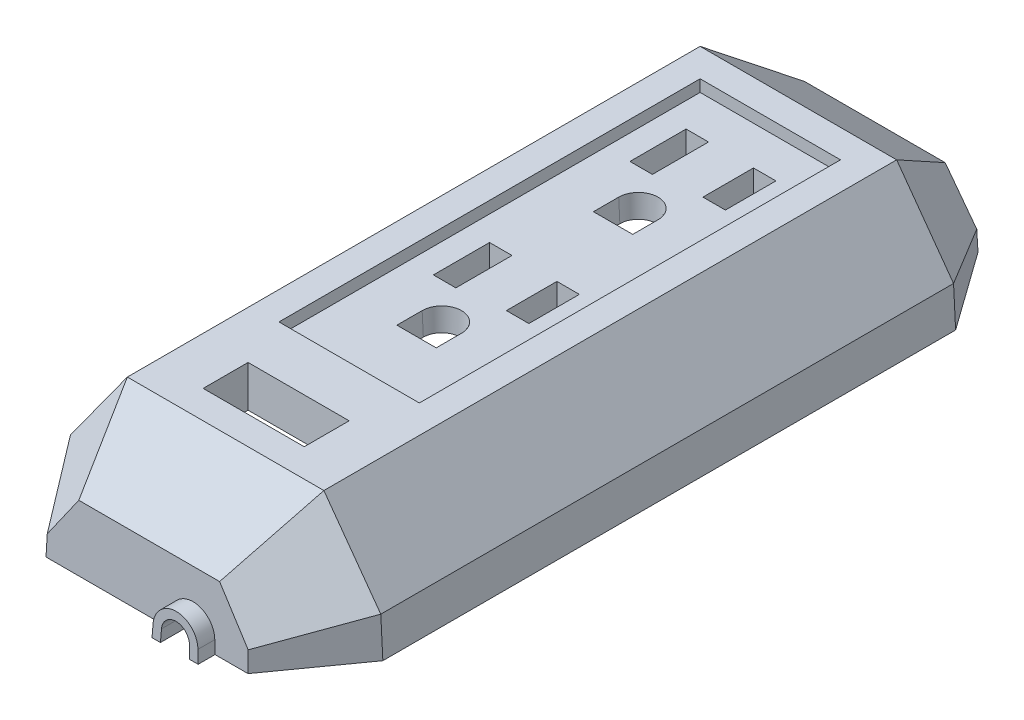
ISO-10303-21;
HEADER;
FILE_DESCRIPTION(('STEP AP214'),'2;1');
FILE_NAME('part.step','',(''),(''),'','','');
FILE_SCHEMA(('AUTOMOTIVE_DESIGN { 1 0 10303 214 1 1 1 1 }'));
ENDSEC;
DATA;
#1=APPLICATION_CONTEXT('core data for automotive mechanical design processes');
#2=APPLICATION_PROTOCOL_DEFINITION('international standard','automotive_design',2000,#1);
#3=PRODUCT_CONTEXT('',#1,'mechanical');
#4=PRODUCT('Part','Part','',(#3));
#5=PRODUCT_RELATED_PRODUCT_CATEGORY('part','',(#4));
#6=PRODUCT_DEFINITION_FORMATION('','',#4);
#7=PRODUCT_DEFINITION_CONTEXT('part definition',#1,'design');
#8=PRODUCT_DEFINITION('design','',#6,#7);
#9=PRODUCT_DEFINITION_SHAPE('','',#8);
#10=(LENGTH_UNIT() NAMED_UNIT(*) SI_UNIT(.MILLI.,.METRE.));
#11=(NAMED_UNIT(*) PLANE_ANGLE_UNIT() SI_UNIT($,.RADIAN.));
#12=(NAMED_UNIT(*) SI_UNIT($,.STERADIAN.) SOLID_ANGLE_UNIT());
#13=UNCERTAINTY_MEASURE_WITH_UNIT(LENGTH_MEASURE(1.E-05),#10,'distance_accuracy_value','');
#14=(GEOMETRIC_REPRESENTATION_CONTEXT(3) GLOBAL_UNCERTAINTY_ASSIGNED_CONTEXT((#13)) GLOBAL_UNIT_ASSIGNED_CONTEXT((#10,
#11,#12)) REPRESENTATION_CONTEXT('',''));
#15=CARTESIAN_POINT('',(0.,0.,0.));
#16=DIRECTION('',(0.,0.,1.));
#17=DIRECTION('',(1.,0.,0.));
#18=AXIS2_PLACEMENT_3D('',#15,#16,#17);
#19=CARTESIAN_POINT('',(-23.0679705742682,10.7903350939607,88.2924274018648));
#20=DIRECTION('',(1.,0.,0.));
#21=DIRECTION('',(0.,0.,-1.));
#22=AXIS2_PLACEMENT_3D('',#19,#20,#21);
#23=CYLINDRICAL_SURFACE('',#22,0.790335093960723);
#24=DIRECTION('',(-1.,0.,0.));
#25=VECTOR('',#24,1.);
#26=CARTESIAN_POINT('',(-26.4979414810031,10.7489721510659,89.081679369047));
#27=LINE('',#26,#25);
#28=CARTESIAN_POINT('',(-23.0679705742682,10.7489721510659,89.081679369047));
#29=VERTEX_POINT('',#28);
#30=CARTESIAN_POINT('',(23.0679705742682,10.7489721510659,89.081679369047));
#31=VERTEX_POINT('',#30);
#32=EDGE_CURVE('E1205',#29,#31,#27,.F.);
#33=ORIENTED_EDGE('',*,*,#32,.F.);
#34=CARTESIAN_POINT('',(-23.038032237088,10.7903350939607,88.2924274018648));
#35=DIRECTION('',(0.810073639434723,-0.586328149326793,0.));
#36=DIRECTION('',(0.586328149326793,0.810073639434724,0.));
#37=AXIS2_PLACEMENT_3D('',#34,#35,#36);
#38=ELLIPSE('',#37,0.97563364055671,0.790335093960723);
#39=CARTESIAN_POINT('',(-23.0679705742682,10.7489721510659,87.5031754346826));
#40=VERTEX_POINT('',#39);
#41=EDGE_CURVE('E48',#29,#40,#38,.T.);
#42=ORIENTED_EDGE('',*,*,#41,.T.);
#43=DIRECTION('',(-1.,0.,0.));
#44=VECTOR('',#43,1.);
#45=CARTESIAN_POINT('',(-23.0679705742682,10.7489721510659,87.5031754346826));
#46=LINE('',#45,#44);
#47=CARTESIAN_POINT('',(23.0679705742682,10.7489721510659,87.5031754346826));
#48=VERTEX_POINT('',#47);
#49=EDGE_CURVE('E1210',#48,#40,#46,.T.);
#50=ORIENTED_EDGE('',*,*,#49,.F.);
#51=CARTESIAN_POINT('',(23.038032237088,10.7903350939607,88.2924274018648));
#52=DIRECTION('',(-0.810073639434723,-0.586328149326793,0.));
#53=DIRECTION('',(0.586328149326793,-0.810073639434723,0.));
#54=AXIS2_PLACEMENT_3D('',#51,#52,#53);
#55=ELLIPSE('',#54,0.975633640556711,0.790335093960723);
#56=EDGE_CURVE('E11',#48,#31,#55,.T.);
#57=ORIENTED_EDGE('',*,*,#56,.T.);
#58=EDGE_LOOP('',(#33,#42,#50,#57));
#59=FACE_BOUND('',#58,.T.);
#60=ADVANCED_FACE('F41',(#59),#23,.T.);
#61=CARTESIAN_POINT('',(23.0679705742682,10.7903350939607,53.2924274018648));
#62=DIRECTION('',(1.,0.,0.));
#63=DIRECTION('',(0.,0.,-1.));
#64=AXIS2_PLACEMENT_3D('',#61,#62,#63);
#65=CYLINDRICAL_SURFACE('',#64,0.790335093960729);
#66=DIRECTION('',(-1.,0.,0.));
#67=VECTOR('',#66,1.);
#68=CARTESIAN_POINT('',(23.0679705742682,10.7489721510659,52.5031754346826));
#69=LINE('',#68,#67);
#70=CARTESIAN_POINT('',(23.0679705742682,10.7489721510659,52.5031754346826));
#71=VERTEX_POINT('',#70);
#72=CARTESIAN_POINT('',(-23.0679705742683,10.7489721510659,52.5031754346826));
#73=VERTEX_POINT('',#72);
#74=EDGE_CURVE('E1195',#71,#73,#69,.T.);
#75=ORIENTED_EDGE('',*,*,#74,.F.);
#76=CARTESIAN_POINT('',(23.038032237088,10.7903350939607,53.2924274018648));
#77=DIRECTION('',(-0.810073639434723,-0.586328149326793,0.));
#78=DIRECTION('',(0.586328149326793,-0.810073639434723,0.));
#79=AXIS2_PLACEMENT_3D('',#76,#77,#78);
#80=ELLIPSE('',#79,0.975633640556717,0.790335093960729);
#81=CARTESIAN_POINT('',(23.0679705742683,10.7489721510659,54.081679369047));
#82=VERTEX_POINT('',#81);
#83=EDGE_CURVE('E1199',#71,#82,#80,.T.);
#84=ORIENTED_EDGE('',*,*,#83,.T.);
#85=DIRECTION('',(-1.,0.,0.));
#86=VECTOR('',#85,1.);
#87=CARTESIAN_POINT('',(-26.4979414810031,10.7489721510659,54.081679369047));
#88=LINE('',#87,#86);
#89=CARTESIAN_POINT('',(-23.0679705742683,10.7489721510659,54.081679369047));
#90=VERTEX_POINT('',#89);
#91=EDGE_CURVE('E1200',#90,#82,#88,.F.);
#92=ORIENTED_EDGE('',*,*,#91,.F.);
#93=CARTESIAN_POINT('',(-23.038032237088,10.7903350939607,53.2924274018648));
#94=DIRECTION('',(0.810073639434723,-0.586328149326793,0.));
#95=DIRECTION('',(0.586328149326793,0.810073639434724,0.));
#96=AXIS2_PLACEMENT_3D('',#93,#94,#95);
#97=ELLIPSE('',#96,0.975633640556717,0.790335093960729);
#98=EDGE_CURVE('E1202',#90,#73,#97,.T.);
#99=ORIENTED_EDGE('',*,*,#98,.T.);
#100=EDGE_LOOP('',(#75,#84,#92,#99));
#101=FACE_BOUND('',#100,.T.);
#102=ADVANCED_FACE('F1657',(#101),#65,.T.);
#103=CARTESIAN_POINT('',(-17.5,19.5,130.));
#104=DIRECTION('',(0.,-1.,0.));
#105=DIRECTION('',(0.,0.,-1.));
#106=AXIS2_PLACEMENT_3D('',#103,#104,#105);
#107=PLANE('',#106);
#108=DIRECTION('',(1.,0.,0.));
#109=VECTOR('',#108,1.);
#110=CARTESIAN_POINT('',(-9.,19.5,112.423446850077));
#111=LINE('',#110,#109);
#112=CARTESIAN_POINT('',(-10.4234468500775,19.5,112.423446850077));
#113=VERTEX_POINT('',#112);
#114=CARTESIAN_POINT('',(-1.0382427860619,19.5,112.423446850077));
#115=VERTEX_POINT('',#114);
#116=EDGE_CURVE('E1264',#113,#115,#111,.T.);
#117=ORIENTED_EDGE('',*,*,#116,.T.);
#118=DIRECTION('',(0.,0.,1.));
#119=VECTOR('',#118,1.);
#120=CARTESIAN_POINT('',(-1.0382427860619,19.5,130.));
#121=LINE('',#120,#119);
#122=CARTESIAN_POINT('',(-1.0382427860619,19.5,115.519302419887));
#123=VERTEX_POINT('',#122);
#124=EDGE_CURVE('E795',#115,#123,#121,.T.);
#125=ORIENTED_EDGE('',*,*,#124,.T.);
#126=DIRECTION('',(1.,0.,0.));
#127=VECTOR('',#126,1.);
#128=CARTESIAN_POINT('',(28.,19.5,115.519302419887));
#129=LINE('',#128,#127);
#130=CARTESIAN_POINT('',(-16.734010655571,19.5,115.519302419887));
#131=VERTEX_POINT('',#130);
#132=EDGE_CURVE('E1298',#131,#123,#129,.T.);
#133=ORIENTED_EDGE('',*,*,#132,.F.);
#134=DIRECTION('',(0.,0.,-1.));
#135=VECTOR('',#134,1.);
#136=CARTESIAN_POINT('',(-16.734010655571,19.5,130.));
#137=LINE('',#136,#135);
#138=CARTESIAN_POINT('',(-16.734010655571,19.5,89.5403013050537));
#139=VERTEX_POINT('',#138);
#140=EDGE_CURVE('E1293',#131,#139,#137,.T.);
#141=ORIENTED_EDGE('',*,*,#140,.T.);
#142=DIRECTION('',(1.,0.,0.));
#143=VECTOR('',#142,1.);
#144=CARTESIAN_POINT('',(-17.5,19.5,89.5403013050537));
#145=LINE('',#144,#143);
#146=CARTESIAN_POINT('',(-13.9234468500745,19.5,89.5403013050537));
#147=VERTEX_POINT('',#146);
#148=EDGE_CURVE('E1235',#147,#139,#145,.F.);
#149=ORIENTED_EDGE('',*,*,#148,.F.);
#150=DIRECTION('',(0.,0.,1.));
#151=VECTOR('',#150,1.);
#152=CARTESIAN_POINT('',(-13.9234468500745,19.5,19.0000000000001));
#153=LINE('',#152,#151);
#154=CARTESIAN_POINT('',(-13.9234468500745,19.5,95.4234468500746));
#155=VERTEX_POINT('',#154);
#156=EDGE_CURVE('E1278',#147,#155,#153,.T.);
#157=ORIENTED_EDGE('',*,*,#156,.T.);
#158=DIRECTION('',(1.,0.,0.));
#159=VECTOR('',#158,1.);
#160=CARTESIAN_POINT('',(12.5,19.5,95.4234468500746));
#161=LINE('',#160,#159);
#162=CARTESIAN_POINT('',(-1.0382427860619,19.5,95.4234468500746));
#163=VERTEX_POINT('',#162);
#164=EDGE_CURVE('E1282',#155,#163,#161,.T.);
#165=ORIENTED_EDGE('',*,*,#164,.T.);
#166=DIRECTION('',(0.,0.,1.));
#167=VECTOR('',#166,1.);
#168=CARTESIAN_POINT('',(-1.0382427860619,19.5,130.));
#169=LINE('',#168,#167);
#170=CARTESIAN_POINT('',(-1.0382427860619,19.5,101.576553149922));
#171=VERTEX_POINT('',#170);
#172=EDGE_CURVE('E1789',#163,#171,#169,.T.);
#173=ORIENTED_EDGE('',*,*,#172,.T.);
#174=DIRECTION('',(-1.,0.,0.));
#175=VECTOR('',#174,1.);
#176=CARTESIAN_POINT('',(-9.,19.5,101.576553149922));
#177=LINE('',#176,#175);
#178=CARTESIAN_POINT('',(-10.4234468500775,19.5,101.576553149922));
#179=VERTEX_POINT('',#178);
#180=EDGE_CURVE('E1271',#171,#179,#177,.T.);
#181=ORIENTED_EDGE('',*,*,#180,.T.);
#182=DIRECTION('',(0.,0.,1.));
#183=VECTOR('',#182,1.);
#184=CARTESIAN_POINT('',(-10.4234468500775,19.5,111.));
#185=LINE('',#184,#183);
#186=EDGE_CURVE('E1245',#179,#113,#185,.T.);
#187=ORIENTED_EDGE('',*,*,#186,.T.);
#188=EDGE_LOOP('',(#117,#125,#133,#141,#149,#157,#165,#173,#181,#187));
#189=FACE_BOUND('',#188,.T.);
#190=ADVANCED_FACE('F1661',(#189),#107,.T.);
#191=CARTESIAN_POINT('',(-9.,20.9214960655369,112.497944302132));
#192=DIRECTION('',(0.,-0.0523359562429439,0.998629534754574));
#193=DIRECTION('',(0.,-0.998629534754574,-0.0523359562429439));
#194=AXIS2_PLACEMENT_3D('',#191,#192,#193);
#195=PLANE('',#194);
#196=DIRECTION('',(1.,0.,0.));
#197=VECTOR('',#196,1.);
#198=CARTESIAN_POINT('',(-9.,13.9999999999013,112.135204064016));
#199=LINE('',#198,#197);
#200=CARTESIAN_POINT('',(-10.1352040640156,13.9999999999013,112.135204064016));
#201=VERTEX_POINT('',#200);
#202=CARTESIAN_POINT('',(-0.750000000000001,13.9999999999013,112.135204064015));
#203=VERTEX_POINT('',#202);
#204=EDGE_CURVE('E804',#201,#203,#199,.T.);
#205=ORIENTED_EDGE('',*,*,#204,.T.);
#206=DIRECTION('',(-0.052264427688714,0.997264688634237,0.052264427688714));
#207=VECTOR('',#206,1.);
#208=CARTESIAN_POINT('',(-1.13428484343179,21.3325916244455,112.519488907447));
#209=LINE('',#208,#207);
#210=EDGE_CURVE('E786',#203,#115,#209,.T.);
#211=ORIENTED_EDGE('',*,*,#210,.T.);
#212=ORIENTED_EDGE('',*,*,#116,.F.);
#213=DIRECTION('',(-0.052264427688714,0.997264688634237,0.052264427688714));
#214=VECTOR('',#213,1.);
#215=CARTESIAN_POINT('',(-10.4938525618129,20.8434210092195,112.493852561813));
#216=LINE('',#215,#214);
#217=EDGE_CURVE('E812',#201,#113,#216,.T.);
#218=ORIENTED_EDGE('',*,*,#217,.F.);
#219=EDGE_LOOP('',(#205,#211,#212,#218));
#220=FACE_BOUND('',#219,.T.);
#221=ADVANCED_FACE('F809',(#220),#195,.T.);
#222=CARTESIAN_POINT('',(12.5,20.9214960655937,95.4979443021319));
#223=DIRECTION('',(0.,-0.0523359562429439,0.998629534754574));
#224=DIRECTION('',(0.,-0.998629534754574,-0.0523359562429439));
#225=AXIS2_PLACEMENT_3D('',#222,#223,#224);
#226=PLANE('',#225);
#227=DIRECTION('',(1.,0.,0.));
#228=VECTOR('',#227,1.);
#229=CARTESIAN_POINT('',(12.5,17.4999999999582,95.3186312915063));
#230=LINE('',#229,#228);
#231=CARTESIAN_POINT('',(-13.8186312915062,17.4999999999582,95.3186312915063));
#232=VERTEX_POINT('',#231);
#233=CARTESIAN_POINT('',(-0.933427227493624,17.4999999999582,95.3186312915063));
#234=VERTEX_POINT('',#233);
#235=EDGE_CURVE('E1384',#232,#234,#230,.T.);
#236=ORIENTED_EDGE('',*,*,#235,.T.);
#237=DIRECTION('',(-0.052264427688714,0.997264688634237,0.052264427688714));
#238=VECTOR('',#237,1.);
#239=CARTESIAN_POINT('',(-1.07555607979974,20.2119800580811,95.4607601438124));
#240=LINE('',#239,#238);
#241=EDGE_CURVE('E1787',#234,#163,#240,.T.);
#242=ORIENTED_EDGE('',*,*,#241,.T.);
#243=ORIENTED_EDGE('',*,*,#164,.F.);
#244=DIRECTION('',(-0.052264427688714,0.997264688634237,0.052264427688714));
#245=VECTOR('',#244,1.);
#246=CARTESIAN_POINT('',(-13.7889847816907,16.934310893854,95.2889847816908));
#247=LINE('',#246,#245);
#248=EDGE_CURVE('E1389',#232,#155,#247,.T.);
#249=ORIENTED_EDGE('',*,*,#248,.F.);
#250=EDGE_LOOP('',(#236,#242,#243,#249));
#251=FACE_BOUND('',#250,.T.);
#252=ADVANCED_FACE('F1776',(#251),#226,.T.);
#253=CARTESIAN_POINT('',(12.5,17.4999999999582,94.0000000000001));
#254=DIRECTION('',(0.,-1.,0.));
#255=DIRECTION('',(0.,0.,-1.));
#256=AXIS2_PLACEMENT_3D('',#253,#254,#255);
#257=PLANE('',#256);
#258=DIRECTION('',(1.,0.,0.));
#259=VECTOR('',#258,1.);
#260=CARTESIAN_POINT('',(12.5,17.4999999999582,89.4354857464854));
#261=LINE('',#260,#259);
#262=CARTESIAN_POINT('',(-0.933427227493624,17.4999999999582,89.4354857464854));
#263=VERTEX_POINT('',#262);
#264=CARTESIAN_POINT('',(-13.8186312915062,17.4999999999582,89.4354857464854));
#265=VERTEX_POINT('',#264);
#266=EDGE_CURVE('E1186',#263,#265,#261,.F.);
#267=ORIENTED_EDGE('',*,*,#266,.F.);
#268=DIRECTION('',(0.,0.,1.));
#269=VECTOR('',#268,1.);
#270=CARTESIAN_POINT('',(-0.933427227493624,17.4999999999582,94.0000000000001));
#271=LINE('',#270,#269);
#272=EDGE_CURVE('E1783',#263,#234,#271,.T.);
#273=ORIENTED_EDGE('',*,*,#272,.T.);
#274=ORIENTED_EDGE('',*,*,#235,.F.);
#275=DIRECTION('',(0.,0.,1.));
#276=VECTOR('',#275,1.);
#277=CARTESIAN_POINT('',(-13.8186312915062,17.4999999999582,19.0000000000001));
#278=LINE('',#277,#276);
#279=EDGE_CURVE('E1400',#265,#232,#278,.T.);
#280=ORIENTED_EDGE('',*,*,#279,.F.);
#281=EDGE_LOOP('',(#267,#273,#274,#280));
#282=FACE_BOUND('',#281,.T.);
#283=ADVANCED_FACE('F1782',(#282),#257,.T.);
#284=CARTESIAN_POINT('',(-9.,20.9214960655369,101.502055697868));
#285=DIRECTION('',(0.,-0.0523359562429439,-0.998629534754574));
#286=DIRECTION('',(0.,0.998629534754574,-0.0523359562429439));
#287=AXIS2_PLACEMENT_3D('',#284,#285,#286);
#288=PLANE('',#287);
#289=ORIENTED_EDGE('',*,*,#180,.F.);
#290=DIRECTION('',(0.052264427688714,-0.997264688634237,0.052264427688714));
#291=VECTOR('',#290,1.);
#292=CARTESIAN_POINT('',(-1.13428484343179,21.3325916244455,101.480511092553));
#293=LINE('',#292,#291);
#294=CARTESIAN_POINT('',(-0.750000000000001,13.9999999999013,101.864795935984));
#295=VERTEX_POINT('',#294);
#296=EDGE_CURVE('E1798',#171,#295,#293,.T.);
#297=ORIENTED_EDGE('',*,*,#296,.T.);
#298=DIRECTION('',(-1.,0.,0.));
#299=VECTOR('',#298,1.);
#300=CARTESIAN_POINT('',(-9.,13.9999999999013,101.864795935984));
#301=LINE('',#300,#299);
#302=CARTESIAN_POINT('',(-10.1352040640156,13.9999999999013,101.864795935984));
#303=VERTEX_POINT('',#302);
#304=EDGE_CURVE('E820',#295,#303,#301,.T.);
#305=ORIENTED_EDGE('',*,*,#304,.T.);
#306=DIRECTION('',(-0.052264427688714,0.997264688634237,-0.052264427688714));
#307=VECTOR('',#306,1.);
#308=CARTESIAN_POINT('',(-10.4938525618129,20.8434210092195,101.506147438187));
#309=LINE('',#308,#307);
#310=EDGE_CURVE('E1407',#303,#179,#309,.T.);
#311=ORIENTED_EDGE('',*,*,#310,.T.);
#312=EDGE_LOOP('',(#289,#297,#305,#311));
#313=FACE_BOUND('',#312,.T.);
#314=ADVANCED_FACE('F1933',(#313),#288,.T.);
#315=DIRECTION('',(-1.,0.,0.));
#316=VECTOR('',#315,1.);
#317=CARTESIAN_POINT('',(12.5,19.5,17.5765531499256));
#318=LINE('',#317,#316);
#319=CARTESIAN_POINT('',(13.9234468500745,19.5,17.5765531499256));
#320=VERTEX_POINT('',#319);
#321=CARTESIAN_POINT('',(-13.9234468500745,19.5,17.5765531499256));
#322=VERTEX_POINT('',#321);
#323=EDGE_CURVE('E1276',#320,#322,#318,.T.);
#324=ORIENTED_EDGE('',*,*,#323,.T.);
#325=CARTESIAN_POINT('',(-13.9234468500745,19.5,52.0445534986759));
#326=VERTEX_POINT('',#325);
#327=EDGE_CURVE('E1288',#322,#326,#153,.T.);
#328=ORIENTED_EDGE('',*,*,#327,.T.);
#329=DIRECTION('',(-1.,0.,0.));
#330=VECTOR('',#329,1.);
#331=CARTESIAN_POINT('',(-17.5,19.5,52.0445534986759));
#332=LINE('',#331,#330);
#333=CARTESIAN_POINT('',(-16.734010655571,19.5,52.0445534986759));
#334=VERTEX_POINT('',#333);
#335=EDGE_CURVE('E1718',#326,#334,#332,.T.);
#336=ORIENTED_EDGE('',*,*,#335,.T.);
#337=CARTESIAN_POINT('',(-16.734010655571,19.5,14.4806975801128));
#338=VERTEX_POINT('',#337);
#339=EDGE_CURVE('E1300',#334,#338,#137,.T.);
#340=ORIENTED_EDGE('',*,*,#339,.T.);
#341=DIRECTION('',(1.,0.,0.));
#342=VECTOR('',#341,1.);
#343=CARTESIAN_POINT('',(-17.5,19.5,14.4806975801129));
#344=LINE('',#343,#342);
#345=CARTESIAN_POINT('',(16.734010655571,19.5,14.4806975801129));
#346=VERTEX_POINT('',#345);
#347=EDGE_CURVE('E1257',#346,#338,#344,.F.);
#348=ORIENTED_EDGE('',*,*,#347,.F.);
#349=DIRECTION('',(0.,0.,-1.));
#350=VECTOR('',#349,1.);
#351=CARTESIAN_POINT('',(16.734010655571,19.5,130.));
#352=LINE('',#351,#350);
#353=CARTESIAN_POINT('',(16.734010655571,19.5,52.0445534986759));
#354=VERTEX_POINT('',#353);
#355=EDGE_CURVE('E1256',#354,#346,#352,.T.);
#356=ORIENTED_EDGE('',*,*,#355,.F.);
#357=CARTESIAN_POINT('',(13.9234468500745,19.5,52.0445534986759));
#358=VERTEX_POINT('',#357);
#359=EDGE_CURVE('E1740',#354,#358,#332,.T.);
#360=ORIENTED_EDGE('',*,*,#359,.T.);
#361=DIRECTION('',(0.,0.,-1.));
#362=VECTOR('',#361,1.);
#363=CARTESIAN_POINT('',(13.9234468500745,19.5,19.0000000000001));
#364=LINE('',#363,#362);
#365=EDGE_CURVE('E1283',#358,#320,#364,.T.);
#366=ORIENTED_EDGE('',*,*,#365,.T.);
#367=EDGE_LOOP('',(#324,#328,#336,#340,#348,#356,#360,#366));
#368=FACE_BOUND('',#367,.T.);
#369=ADVANCED_FACE('F1720',(#368),#107,.T.);
#370=DIRECTION('',(1.,0.,0.));
#371=VECTOR('',#370,1.);
#372=CARTESIAN_POINT('',(-17.5,19.5,54.5403013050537));
#373=LINE('',#372,#371);
#374=CARTESIAN_POINT('',(16.734010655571,19.5,54.5403013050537));
#375=VERTEX_POINT('',#374);
#376=CARTESIAN_POINT('',(13.9234468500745,19.5,54.5403013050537));
#377=VERTEX_POINT('',#376);
#378=EDGE_CURVE('E1732',#375,#377,#373,.F.);
#379=ORIENTED_EDGE('',*,*,#378,.F.);
#380=CARTESIAN_POINT('',(16.734010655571,19.5,87.0445534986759));
#381=VERTEX_POINT('',#380);
#382=EDGE_CURVE('E1259',#381,#375,#352,.T.);
#383=ORIENTED_EDGE('',*,*,#382,.F.);
#384=DIRECTION('',(-1.,0.,0.));
#385=VECTOR('',#384,1.);
#386=CARTESIAN_POINT('',(-17.5,19.5,87.0445534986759));
#387=LINE('',#386,#385);
#388=CARTESIAN_POINT('',(13.9234468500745,19.5,87.0445534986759));
#389=VERTEX_POINT('',#388);
#390=EDGE_CURVE('E1230',#381,#389,#387,.T.);
#391=ORIENTED_EDGE('',*,*,#390,.T.);
#392=EDGE_CURVE('E1285',#389,#377,#364,.T.);
#393=ORIENTED_EDGE('',*,*,#392,.T.);
#394=EDGE_LOOP('',(#379,#383,#391,#393));
#395=FACE_BOUND('',#394,.T.);
#396=ADVANCED_FACE('F1757',(#395),#107,.T.);
#397=CARTESIAN_POINT('',(13.9979443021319,20.9214960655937,19.0000000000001));
#398=DIRECTION('',(0.998629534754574,-0.0523359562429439,0.));
#399=DIRECTION('',(0.0523359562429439,0.998629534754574,0.));
#400=AXIS2_PLACEMENT_3D('',#397,#398,#399);
#401=PLANE('',#400);
#402=ORIENTED_EDGE('',*,*,#365,.F.);
#403=DIRECTION('',(-0.052264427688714,-0.997264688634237,0.052264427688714));
#404=VECTOR('',#403,1.);
#405=CARTESIAN_POINT('',(14.0880043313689,22.6399437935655,51.8799960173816));
#406=LINE('',#405,#404);
#407=CARTESIAN_POINT('',(13.8186312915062,17.4999999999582,52.1493690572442));
#408=VERTEX_POINT('',#407);
#409=EDGE_CURVE('E1820',#358,#408,#406,.T.);
#410=ORIENTED_EDGE('',*,*,#409,.T.);
#411=DIRECTION('',(0.,0.,-1.));
#412=VECTOR('',#411,1.);
#413=CARTESIAN_POINT('',(13.8186312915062,17.4999999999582,19.0000000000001));
#414=LINE('',#413,#412);
#415=CARTESIAN_POINT('',(13.8186312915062,17.4999999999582,17.6813687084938));
#416=VERTEX_POINT('',#415);
#417=EDGE_CURVE('E1290',#408,#416,#414,.T.);
#418=ORIENTED_EDGE('',*,*,#417,.T.);
#419=DIRECTION('',(0.052264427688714,0.997264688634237,-0.052264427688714));
#420=VECTOR('',#419,1.);
#421=CARTESIAN_POINT('',(13.9938525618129,20.8434210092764,17.5061474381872));
#422=LINE('',#421,#420);
#423=EDGE_CURVE('E1380',#416,#320,#422,.T.);
#424=ORIENTED_EDGE('',*,*,#423,.T.);
#425=EDGE_LOOP('',(#402,#410,#418,#424));
#426=FACE_BOUND('',#425,.T.);
#427=ADVANCED_FACE('F1826',(#426),#401,.T.);
#428=CARTESIAN_POINT('',(-13.9979443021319,20.9214960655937,19.0000000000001));
#429=DIRECTION('',(-0.998629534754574,-0.0523359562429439,0.));
#430=DIRECTION('',(0.0523359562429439,-0.998629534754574,0.));
#431=AXIS2_PLACEMENT_3D('',#428,#429,#430);
#432=PLANE('',#431);
#433=CARTESIAN_POINT('',(-13.8186312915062,17.4999999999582,17.6813687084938));
#434=VERTEX_POINT('',#433);
#435=CARTESIAN_POINT('',(-13.8186312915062,17.4999999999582,52.1493690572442));
#436=VERTEX_POINT('',#435);
#437=EDGE_CURVE('E1394',#434,#436,#278,.T.);
#438=ORIENTED_EDGE('',*,*,#437,.T.);
#439=DIRECTION('',(-0.052264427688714,0.997264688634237,-0.052264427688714));
#440=VECTOR('',#439,1.);
#441=CARTESIAN_POINT('',(-14.0880043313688,22.6399437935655,51.8799960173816));
#442=LINE('',#441,#440);
#443=EDGE_CURVE('E1811',#436,#326,#442,.T.);
#444=ORIENTED_EDGE('',*,*,#443,.T.);
#445=ORIENTED_EDGE('',*,*,#327,.F.);
#446=DIRECTION('',(-0.052264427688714,0.997264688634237,-0.052264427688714));
#447=VECTOR('',#446,1.);
#448=CARTESIAN_POINT('',(-13.9255633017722,19.5403843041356,17.5744366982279));
#449=LINE('',#448,#447);
#450=EDGE_CURVE('E1378',#434,#322,#449,.T.);
#451=ORIENTED_EDGE('',*,*,#450,.F.);
#452=EDGE_LOOP('',(#438,#444,#445,#451));
#453=FACE_BOUND('',#452,.T.);
#454=ADVANCED_FACE('F1838',(#453),#432,.T.);
#455=CARTESIAN_POINT('',(0.,17.4999999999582,42.5000000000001));
#456=DIRECTION('',(0.,-1.,0.));
#457=DIRECTION('',(0.,0.,-1.));
#458=AXIS2_PLACEMENT_3D('',#455,#456,#457);
#459=CIRCLE('',#458,4.92344685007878);
#460=CARTESIAN_POINT('',(4.92344685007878,17.4999999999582,42.5000000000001));
#461=VERTEX_POINT('',#460);
#462=CARTESIAN_POINT('',(-4.92344685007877,17.4999999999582,42.5000000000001));
#463=VERTEX_POINT('',#462);
#464=EDGE_CURVE('E1443',#461,#463,#459,.F.);
#465=ORIENTED_EDGE('',*,*,#464,.T.);
#466=DIRECTION('',(0.,0.,1.));
#467=VECTOR('',#466,1.);
#468=CARTESIAN_POINT('',(-4.92344685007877,17.4999999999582,42.5000000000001));
#469=LINE('',#468,#467);
#470=CARTESIAN_POINT('',(-4.92344685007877,17.4999999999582,48.4234468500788));
#471=VERTEX_POINT('',#470);
#472=EDGE_CURVE('E1442',#463,#471,#469,.T.);
#473=ORIENTED_EDGE('',*,*,#472,.T.);
#474=DIRECTION('',(1.,0.,0.));
#475=VECTOR('',#474,1.);
#476=CARTESIAN_POINT('',(-3.49999999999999,17.4999999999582,48.4234468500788));
#477=LINE('',#476,#475);
#478=CARTESIAN_POINT('',(4.92344685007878,17.4999999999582,48.4234468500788));
#479=VERTEX_POINT('',#478);
#480=EDGE_CURVE('E1444',#471,#479,#477,.T.);
#481=ORIENTED_EDGE('',*,*,#480,.T.);
#482=DIRECTION('',(0.,0.,-1.));
#483=VECTOR('',#482,1.);
#484=CARTESIAN_POINT('',(4.92344685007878,17.4999999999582,47.0000000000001));
#485=LINE('',#484,#483);
#486=EDGE_CURVE('E1450',#479,#461,#485,.T.);
#487=ORIENTED_EDGE('',*,*,#486,.T.);
#488=EDGE_LOOP('',(#465,#473,#481,#487));
#489=FACE_BOUND('',#488,.T.);
#490=ORIENTED_EDGE('',*,*,#437,.F.);
#491=DIRECTION('',(-1.,0.,0.));
#492=VECTOR('',#491,1.);
#493=CARTESIAN_POINT('',(12.5,17.4999999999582,17.6813687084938));
#494=LINE('',#493,#492);
#495=EDGE_CURVE('E1382',#416,#434,#494,.T.);
#496=ORIENTED_EDGE('',*,*,#495,.F.);
#497=ORIENTED_EDGE('',*,*,#417,.F.);
#498=DIRECTION('',(-1.,0.,0.));
#499=VECTOR('',#498,1.);
#500=CARTESIAN_POINT('',(12.5,17.4999999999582,52.1493690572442));
#501=LINE('',#500,#499);
#502=EDGE_CURVE('E1819',#408,#436,#501,.T.);
#503=ORIENTED_EDGE('',*,*,#502,.T.);
#504=EDGE_LOOP('',(#490,#496,#497,#503));
#505=FACE_BOUND('',#504,.T.);
#506=DIRECTION('',(0.,0.,-1.));
#507=VECTOR('',#506,1.);
#508=CARTESIAN_POINT('',(9.42344685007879,17.4999999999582,35.0000000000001));
#509=LINE('',#508,#507);
#510=CARTESIAN_POINT('',(9.42344685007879,17.4999999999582,36.4234468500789));
#511=VERTEX_POINT('',#510);
#512=CARTESIAN_POINT('',(9.42344685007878,17.4999999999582,24.5765531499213));
#513=VERTEX_POINT('',#512);
#514=EDGE_CURVE('E1468',#511,#513,#509,.T.);
#515=ORIENTED_EDGE('',*,*,#514,.T.);
#516=DIRECTION('',(-1.,0.,0.));
#517=VECTOR('',#516,1.);
#518=CARTESIAN_POINT('',(8.00000000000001,17.4999999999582,24.5765531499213));
#519=LINE('',#518,#517);
#520=CARTESIAN_POINT('',(2.57655314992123,17.4999999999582,24.5765531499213));
#521=VERTEX_POINT('',#520);
#522=EDGE_CURVE('E1469',#513,#521,#519,.T.);
#523=ORIENTED_EDGE('',*,*,#522,.T.);
#524=DIRECTION('',(0.,0.,1.));
#525=VECTOR('',#524,1.);
#526=CARTESIAN_POINT('',(2.57655314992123,17.4999999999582,26.0000000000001));
#527=LINE('',#526,#525);
#528=CARTESIAN_POINT('',(2.57655314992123,17.4999999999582,36.4234468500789));
#529=VERTEX_POINT('',#528);
#530=EDGE_CURVE('E1473',#521,#529,#527,.T.);
#531=ORIENTED_EDGE('',*,*,#530,.T.);
#532=DIRECTION('',(1.,0.,0.));
#533=VECTOR('',#532,1.);
#534=CARTESIAN_POINT('',(4.00000000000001,17.4999999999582,36.4234468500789));
#535=LINE('',#534,#533);
#536=EDGE_CURVE('E1467',#529,#511,#535,.T.);
#537=ORIENTED_EDGE('',*,*,#536,.T.);
#538=EDGE_LOOP('',(#515,#523,#531,#537));
#539=FACE_BOUND('',#538,.T.);
#540=DIRECTION('',(0.,0.,-1.));
#541=VECTOR('',#540,1.);
#542=CARTESIAN_POINT('',(-2.57655314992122,17.4999999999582,36.0000000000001));
#543=LINE('',#542,#541);
#544=CARTESIAN_POINT('',(-2.57655314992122,17.4999999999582,37.4234468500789));
#545=VERTEX_POINT('',#544);
#546=CARTESIAN_POINT('',(-2.57655314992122,17.4999999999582,24.5765531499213));
#547=VERTEX_POINT('',#546);
#548=EDGE_CURVE('E1453',#545,#547,#543,.T.);
#549=ORIENTED_EDGE('',*,*,#548,.T.);
#550=DIRECTION('',(-1.,0.,0.));
#551=VECTOR('',#550,1.);
#552=CARTESIAN_POINT('',(-4.,17.4999999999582,24.5765531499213));
#553=LINE('',#552,#551);
#554=CARTESIAN_POINT('',(-9.42344685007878,17.4999999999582,24.5765531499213));
#555=VERTEX_POINT('',#554);
#556=EDGE_CURVE('E1456',#547,#555,#553,.T.);
#557=ORIENTED_EDGE('',*,*,#556,.T.);
#558=DIRECTION('',(0.,0.,1.));
#559=VECTOR('',#558,1.);
#560=CARTESIAN_POINT('',(-9.42344685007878,17.4999999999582,26.0000000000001));
#561=LINE('',#560,#559);
#562=CARTESIAN_POINT('',(-9.42344685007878,17.4999999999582,37.4234468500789));
#563=VERTEX_POINT('',#562);
#564=EDGE_CURVE('E1459',#555,#563,#561,.T.);
#565=ORIENTED_EDGE('',*,*,#564,.T.);
#566=DIRECTION('',(1.,0.,0.));
#567=VECTOR('',#566,1.);
#568=CARTESIAN_POINT('',(-8.,17.4999999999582,37.4234468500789));
#569=LINE('',#568,#567);
#570=EDGE_CURVE('E1460',#563,#545,#569,.T.);
#571=ORIENTED_EDGE('',*,*,#570,.T.);
#572=EDGE_LOOP('',(#549,#557,#565,#571));
#573=FACE_BOUND('',#572,.T.);
#574=ADVANCED_FACE('F1834',(#489,#505,#539,#573),#257,.T.);
#575=CARTESIAN_POINT('',(-13.9234468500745,19.5,54.5403013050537));
#576=VERTEX_POINT('',#575);
#577=CARTESIAN_POINT('',(-16.734010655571,19.5,54.5403013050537));
#578=VERTEX_POINT('',#577);
#579=EDGE_CURVE('E1725',#576,#578,#373,.F.);
#580=ORIENTED_EDGE('',*,*,#579,.F.);
#581=CARTESIAN_POINT('',(-13.9234468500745,19.5,87.0445534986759));
#582=VERTEX_POINT('',#581);
#583=EDGE_CURVE('E1295',#576,#582,#153,.T.);
#584=ORIENTED_EDGE('',*,*,#583,.T.);
#585=CARTESIAN_POINT('',(-16.734010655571,19.5,87.0445534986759));
#586=VERTEX_POINT('',#585);
#587=EDGE_CURVE('E1728',#582,#586,#387,.T.);
#588=ORIENTED_EDGE('',*,*,#587,.T.);
#589=EDGE_CURVE('E1221',#586,#578,#137,.T.);
#590=ORIENTED_EDGE('',*,*,#589,.T.);
#591=EDGE_LOOP('',(#580,#584,#588,#590));
#592=FACE_BOUND('',#591,.T.);
#593=ADVANCED_FACE('F1721',(#592),#107,.T.);
#594=DIRECTION('',(0.052264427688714,0.997264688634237,0.052264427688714));
#595=VECTOR('',#594,1.);
#596=CARTESIAN_POINT('',(13.900659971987,19.065200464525,54.5175144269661));
#597=LINE('',#596,#595);
#598=CARTESIAN_POINT('',(13.8186312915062,17.4999999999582,54.4354857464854));
#599=VERTEX_POINT('',#598);
#600=EDGE_CURVE('E1741',#377,#599,#597,.F.);
#601=ORIENTED_EDGE('',*,*,#600,.F.);
#602=ORIENTED_EDGE('',*,*,#392,.F.);
#603=DIRECTION('',(-0.052264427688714,-0.997264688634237,0.052264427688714));
#604=VECTOR('',#603,1.);
#605=CARTESIAN_POINT('',(14.1836092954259,24.4641951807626,86.7843910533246));
#606=LINE('',#605,#604);
#607=CARTESIAN_POINT('',(13.8186312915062,17.4999999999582,87.1493690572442));
#608=VERTEX_POINT('',#607);
#609=EDGE_CURVE('E1754',#389,#608,#606,.T.);
#610=ORIENTED_EDGE('',*,*,#609,.T.);
#611=EDGE_CURVE('E1387',#608,#599,#414,.T.);
#612=ORIENTED_EDGE('',*,*,#611,.T.);
#613=EDGE_LOOP('',(#601,#602,#610,#612));
#614=FACE_BOUND('',#613,.T.);
#615=ADVANCED_FACE('F1756',(#614),#401,.T.);
#616=DIRECTION('',(0.052264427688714,-0.997264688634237,-0.052264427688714));
#617=VECTOR('',#616,1.);
#618=CARTESIAN_POINT('',(-13.900659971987,19.065200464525,54.5175144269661));
#619=LINE('',#618,#617);
#620=CARTESIAN_POINT('',(-13.8186312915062,17.4999999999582,54.4354857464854));
#621=VERTEX_POINT('',#620);
#622=EDGE_CURVE('E1731',#621,#576,#619,.F.);
#623=ORIENTED_EDGE('',*,*,#622,.F.);
#624=CARTESIAN_POINT('',(-13.8186312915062,17.4999999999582,87.1493690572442));
#625=VERTEX_POINT('',#624);
#626=EDGE_CURVE('E1396',#621,#625,#278,.T.);
#627=ORIENTED_EDGE('',*,*,#626,.T.);
#628=DIRECTION('',(-0.052264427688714,0.997264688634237,-0.052264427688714));
#629=VECTOR('',#628,1.);
#630=CARTESIAN_POINT('',(-14.1836092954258,24.4641951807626,86.7843910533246));
#631=LINE('',#630,#629);
#632=EDGE_CURVE('E1743',#625,#582,#631,.T.);
#633=ORIENTED_EDGE('',*,*,#632,.T.);
#634=ORIENTED_EDGE('',*,*,#583,.F.);
#635=EDGE_LOOP('',(#623,#627,#633,#634));
#636=FACE_BOUND('',#635,.T.);
#637=ADVANCED_FACE('F1769',(#636),#432,.T.);
#638=CARTESIAN_POINT('',(0.,17.4999999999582,77.5000000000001));
#639=DIRECTION('',(0.,-1.,0.));
#640=DIRECTION('',(0.,0.,-1.));
#641=AXIS2_PLACEMENT_3D('',#638,#639,#640);
#642=CIRCLE('',#641,4.92344685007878);
#643=CARTESIAN_POINT('',(4.92344685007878,17.4999999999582,77.5000000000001));
#644=VERTEX_POINT('',#643);
#645=CARTESIAN_POINT('',(-4.92344685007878,17.4999999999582,77.5000000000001));
#646=VERTEX_POINT('',#645);
#647=EDGE_CURVE('E1410',#644,#646,#642,.F.);
#648=ORIENTED_EDGE('',*,*,#647,.T.);
#649=DIRECTION('',(0.,0.,1.));
#650=VECTOR('',#649,1.);
#651=CARTESIAN_POINT('',(-4.92344685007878,17.4999999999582,77.5000000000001));
#652=LINE('',#651,#650);
#653=CARTESIAN_POINT('',(-4.92344685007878,17.4999999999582,83.4234468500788));
#654=VERTEX_POINT('',#653);
#655=EDGE_CURVE('E1401',#646,#654,#652,.T.);
#656=ORIENTED_EDGE('',*,*,#655,.T.);
#657=DIRECTION('',(1.,0.,0.));
#658=VECTOR('',#657,1.);
#659=CARTESIAN_POINT('',(-3.5,17.4999999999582,83.4234468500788));
#660=LINE('',#659,#658);
#661=CARTESIAN_POINT('',(4.92344685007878,17.4999999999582,83.4234468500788));
#662=VERTEX_POINT('',#661);
#663=EDGE_CURVE('E1406',#654,#662,#660,.T.);
#664=ORIENTED_EDGE('',*,*,#663,.T.);
#665=DIRECTION('',(0.,0.,-1.));
#666=VECTOR('',#665,1.);
#667=CARTESIAN_POINT('',(4.92344685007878,17.4999999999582,82.0000000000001));
#668=LINE('',#667,#666);
#669=EDGE_CURVE('E1409',#662,#644,#668,.T.);
#670=ORIENTED_EDGE('',*,*,#669,.T.);
#671=EDGE_LOOP('',(#648,#656,#664,#670));
#672=FACE_BOUND('',#671,.T.);
#673=ORIENTED_EDGE('',*,*,#626,.F.);
#674=DIRECTION('',(1.,0.,0.));
#675=VECTOR('',#674,1.);
#676=CARTESIAN_POINT('',(12.5,17.4999999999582,54.4354857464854));
#677=LINE('',#676,#675);
#678=EDGE_CURVE('E1734',#599,#621,#677,.F.);
#679=ORIENTED_EDGE('',*,*,#678,.F.);
#680=ORIENTED_EDGE('',*,*,#611,.F.);
#681=DIRECTION('',(-1.,0.,0.));
#682=VECTOR('',#681,1.);
#683=CARTESIAN_POINT('',(12.5,17.4999999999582,87.1493690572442));
#684=LINE('',#683,#682);
#685=EDGE_CURVE('E1138',#608,#625,#684,.T.);
#686=ORIENTED_EDGE('',*,*,#685,.T.);
#687=EDGE_LOOP('',(#673,#679,#680,#686));
#688=FACE_BOUND('',#687,.T.);
#689=DIRECTION('',(0.,0.,-1.));
#690=VECTOR('',#689,1.);
#691=CARTESIAN_POINT('',(9.42344685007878,17.4999999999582,70.0000000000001));
#692=LINE('',#691,#690);
#693=CARTESIAN_POINT('',(9.42344685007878,17.4999999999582,71.4234468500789));
#694=VERTEX_POINT('',#693);
#695=CARTESIAN_POINT('',(9.42344685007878,17.4999999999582,59.5765531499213));
#696=VERTEX_POINT('',#695);
#697=EDGE_CURVE('E1430',#694,#696,#692,.T.);
#698=ORIENTED_EDGE('',*,*,#697,.T.);
#699=DIRECTION('',(-1.,0.,0.));
#700=VECTOR('',#699,1.);
#701=CARTESIAN_POINT('',(8.,17.4999999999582,59.5765531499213));
#702=LINE('',#701,#700);
#703=CARTESIAN_POINT('',(2.57655314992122,17.4999999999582,59.5765531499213));
#704=VERTEX_POINT('',#703);
#705=EDGE_CURVE('E1432',#696,#704,#702,.T.);
#706=ORIENTED_EDGE('',*,*,#705,.T.);
#707=DIRECTION('',(0.,0.,1.));
#708=VECTOR('',#707,1.);
#709=CARTESIAN_POINT('',(2.57655314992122,17.4999999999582,61.0000000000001));
#710=LINE('',#709,#708);
#711=CARTESIAN_POINT('',(2.57655314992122,17.4999999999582,71.4234468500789));
#712=VERTEX_POINT('',#711);
#713=EDGE_CURVE('E1431',#704,#712,#710,.T.);
#714=ORIENTED_EDGE('',*,*,#713,.T.);
#715=DIRECTION('',(1.,0.,0.));
#716=VECTOR('',#715,1.);
#717=CARTESIAN_POINT('',(4.,17.4999999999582,71.4234468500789));
#718=LINE('',#717,#716);
#719=EDGE_CURVE('E1435',#712,#694,#718,.T.);
#720=ORIENTED_EDGE('',*,*,#719,.T.);
#721=EDGE_LOOP('',(#698,#706,#714,#720));
#722=FACE_BOUND('',#721,.T.);
#723=DIRECTION('',(0.,0.,-1.));
#724=VECTOR('',#723,1.);
#725=CARTESIAN_POINT('',(-2.57655314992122,17.4999999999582,71.0000000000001));
#726=LINE('',#725,#724);
#727=CARTESIAN_POINT('',(-2.57655314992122,17.4999999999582,72.4234468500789));
#728=VERTEX_POINT('',#727);
#729=CARTESIAN_POINT('',(-2.57655314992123,17.4999999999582,59.5765531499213));
#730=VERTEX_POINT('',#729);
#731=EDGE_CURVE('E1414',#728,#730,#726,.T.);
#732=ORIENTED_EDGE('',*,*,#731,.T.);
#733=DIRECTION('',(-1.,0.,0.));
#734=VECTOR('',#733,1.);
#735=CARTESIAN_POINT('',(-4.,17.4999999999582,59.5765531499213));
#736=LINE('',#735,#734);
#737=CARTESIAN_POINT('',(-9.42344685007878,17.4999999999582,59.5765531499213));
#738=VERTEX_POINT('',#737);
#739=EDGE_CURVE('E1417',#730,#738,#736,.T.);
#740=ORIENTED_EDGE('',*,*,#739,.T.);
#741=DIRECTION('',(0.,0.,1.));
#742=VECTOR('',#741,1.);
#743=CARTESIAN_POINT('',(-9.42344685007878,17.4999999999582,61.0000000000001));
#744=LINE('',#743,#742);
#745=CARTESIAN_POINT('',(-9.42344685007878,17.4999999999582,72.4234468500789));
#746=VERTEX_POINT('',#745);
#747=EDGE_CURVE('E1425',#738,#746,#744,.T.);
#748=ORIENTED_EDGE('',*,*,#747,.T.);
#749=DIRECTION('',(1.,0.,0.));
#750=VECTOR('',#749,1.);
#751=CARTESIAN_POINT('',(-8.00000000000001,17.4999999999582,72.4234468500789));
#752=LINE('',#751,#750);
#753=EDGE_CURVE('E1418',#746,#728,#752,.T.);
#754=ORIENTED_EDGE('',*,*,#753,.T.);
#755=EDGE_LOOP('',(#732,#740,#748,#754));
#756=FACE_BOUND('',#755,.T.);
#757=ADVANCED_FACE('F1641',(#672,#688,#722,#756),#257,.T.);
#758=CARTESIAN_POINT('',(27.6331455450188,7.,130.));
#759=DIRECTION('',(-0.998629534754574,-0.0523359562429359,0.));
#760=DIRECTION('',(0.052335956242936,-0.998629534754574,0.));
#761=AXIS2_PLACEMENT_3D('',#758,#759,#760);
#762=PLANE('',#761);
#763=DIRECTION('',(0.,0.,-1.));
#764=VECTOR('',#763,1.);
#765=CARTESIAN_POINT('',(28.,0.,130.));
#766=LINE('',#765,#764);
#767=CARTESIAN_POINT('',(28.,0.,116.));
#768=VERTEX_POINT('',#767);
#769=CARTESIAN_POINT('',(28.,0.,14.0000000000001));
#770=VERTEX_POINT('',#769);
#771=EDGE_CURVE('E1071',#768,#770,#766,.T.);
#772=ORIENTED_EDGE('',*,*,#771,.T.);
#773=DIRECTION('',(-0.052335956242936,0.998629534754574,0.));
#774=VECTOR('',#773,1.);
#775=CARTESIAN_POINT('',(27.6331455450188,7.,14.0000000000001));
#776=LINE('',#775,#774);
#777=CARTESIAN_POINT('',(27.6331455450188,7.,14.0000000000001));
#778=VERTEX_POINT('',#777);
#779=EDGE_CURVE('E1133',#770,#778,#776,.T.);
#780=ORIENTED_EDGE('',*,*,#779,.T.);
#781=DIRECTION('',(0.,0.,-1.));
#782=VECTOR('',#781,1.);
#783=CARTESIAN_POINT('',(27.6331455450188,7.,130.));
#784=LINE('',#783,#782);
#785=CARTESIAN_POINT('',(27.6331455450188,7.,116.));
#786=VERTEX_POINT('',#785);
#787=EDGE_CURVE('E1090',#786,#778,#784,.T.);
#788=ORIENTED_EDGE('',*,*,#787,.F.);
#789=DIRECTION('',(0.052335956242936,-0.998629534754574,0.));
#790=VECTOR('',#789,1.);
#791=CARTESIAN_POINT('',(28.,0.,116.));
#792=LINE('',#791,#790);
#793=EDGE_CURVE('E1091',#786,#768,#792,.T.);
#794=ORIENTED_EDGE('',*,*,#793,.T.);
#795=EDGE_LOOP('',(#772,#780,#788,#794));
#796=FACE_BOUND('',#795,.T.);
#797=ADVANCED_FACE('F2102',(#796),#762,.F.);
#798=CARTESIAN_POINT('',(17.5,21.,130.));
#799=DIRECTION('',(-0.810073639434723,-0.586328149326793,0.));
#800=DIRECTION('',(0.586328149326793,-0.810073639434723,0.));
#801=AXIS2_PLACEMENT_3D('',#798,#799,#800);
#802=PLANE('',#801);
#803=DIRECTION('',(-0.586328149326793,0.810073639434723,0.));
#804=VECTOR('',#803,1.);
#805=CARTESIAN_POINT('',(17.5,21.,14.0000000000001));
#806=LINE('',#805,#804);
#807=CARTESIAN_POINT('',(17.5,21.,14.0000000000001));
#808=VERTEX_POINT('',#807);
#809=EDGE_CURVE('E1131',#778,#808,#806,.T.);
#810=ORIENTED_EDGE('',*,*,#809,.T.);
#811=DIRECTION('',(0.,0.,-1.));
#812=VECTOR('',#811,1.);
#813=CARTESIAN_POINT('',(17.5,21.,130.));
#814=LINE('',#813,#812);
#815=CARTESIAN_POINT('',(17.5,21.,116.));
#816=VERTEX_POINT('',#815);
#817=EDGE_CURVE('E1084',#816,#808,#814,.T.);
#818=ORIENTED_EDGE('',*,*,#817,.F.);
#819=DIRECTION('',(0.586328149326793,-0.810073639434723,0.));
#820=VECTOR('',#819,1.);
#821=CARTESIAN_POINT('',(27.6331455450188,7.,116.));
#822=LINE('',#821,#820);
#823=EDGE_CURVE('E1096',#816,#786,#822,.T.);
#824=ORIENTED_EDGE('',*,*,#823,.T.);
#825=ORIENTED_EDGE('',*,*,#787,.T.);
#826=EDGE_LOOP('',(#810,#818,#824,#825));
#827=FACE_BOUND('',#826,.T.);
#828=ADVANCED_FACE('F2096',(#827),#802,.F.);
#829=CARTESIAN_POINT('',(-17.5,21.,130.));
#830=DIRECTION('',(0.,-1.,0.));
#831=DIRECTION('',(0.,0.,-1.));
#832=AXIS2_PLACEMENT_3D('',#829,#830,#831);
#833=PLANE('',#832);
#834=DIRECTION('',(0.,0.,1.));
#835=VECTOR('',#834,1.);
#836=CARTESIAN_POINT('',(-12.5,20.9999999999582,19.0000000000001));
#837=LINE('',#836,#835);
#838=CARTESIAN_POINT('',(-12.5,20.9999999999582,19.0000000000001));
#839=VERTEX_POINT('',#838);
#840=CARTESIAN_POINT('',(-12.5,20.9999999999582,94.0000000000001));
#841=VERTEX_POINT('',#840);
#842=EDGE_CURVE('E1030',#839,#841,#837,.T.);
#843=ORIENTED_EDGE('',*,*,#842,.F.);
#844=DIRECTION('',(-1.,0.,0.));
#845=VECTOR('',#844,1.);
#846=CARTESIAN_POINT('',(12.5,20.9999999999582,19.0000000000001));
#847=LINE('',#846,#845);
#848=CARTESIAN_POINT('',(12.5,21.,18.9999999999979));
#849=VERTEX_POINT('',#848);
#850=EDGE_CURVE('E1024',#849,#839,#847,.T.);
#851=ORIENTED_EDGE('',*,*,#850,.F.);
#852=DIRECTION('',(0.,0.,-1.));
#853=VECTOR('',#852,1.);
#854=CARTESIAN_POINT('',(12.5,20.9999999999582,19.0000000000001));
#855=LINE('',#854,#853);
#856=CARTESIAN_POINT('',(12.5,20.9999999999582,94.0000000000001));
#857=VERTEX_POINT('',#856);
#858=EDGE_CURVE('E1010',#857,#849,#855,.T.);
#859=ORIENTED_EDGE('',*,*,#858,.F.);
#860=DIRECTION('',(1.,0.,0.));
#861=VECTOR('',#860,1.);
#862=CARTESIAN_POINT('',(12.5,20.9999999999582,94.0000000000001));
#863=LINE('',#862,#861);
#864=EDGE_CURVE('E1028',#841,#857,#863,.T.);
#865=ORIENTED_EDGE('',*,*,#864,.F.);
#866=EDGE_LOOP('',(#843,#851,#859,#865));
#867=FACE_BOUND('',#866,.T.);
#868=DIRECTION('',(0.,0.,1.));
#869=VECTOR('',#868,1.);
#870=CARTESIAN_POINT('',(-9.,20.9999999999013,111.));
#871=LINE('',#870,#869);
#872=CARTESIAN_POINT('',(-9.,20.9999999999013,103.));
#873=VERTEX_POINT('',#872);
#874=CARTESIAN_POINT('',(-9.,21.,111.000000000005));
#875=VERTEX_POINT('',#874);
#876=EDGE_CURVE('E826',#873,#875,#871,.T.);
#877=ORIENTED_EDGE('',*,*,#876,.F.);
#878=DIRECTION('',(-1.,0.,0.));
#879=VECTOR('',#878,1.);
#880=CARTESIAN_POINT('',(-9.,20.9999999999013,103.));
#881=LINE('',#880,#879);
#882=CARTESIAN_POINT('',(9.,20.9999999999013,103.));
#883=VERTEX_POINT('',#882);
#884=EDGE_CURVE('E833',#883,#873,#881,.T.);
#885=ORIENTED_EDGE('',*,*,#884,.F.);
#886=DIRECTION('',(0.,0.,-1.));
#887=VECTOR('',#886,1.);
#888=CARTESIAN_POINT('',(9.,20.9999999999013,111.));
#889=LINE('',#888,#887);
#890=CARTESIAN_POINT('',(9.,20.9999999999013,111.));
#891=VERTEX_POINT('',#890);
#892=EDGE_CURVE('E831',#891,#883,#889,.T.);
#893=ORIENTED_EDGE('',*,*,#892,.F.);
#894=DIRECTION('',(1.,0.,0.));
#895=VECTOR('',#894,1.);
#896=CARTESIAN_POINT('',(-9.,20.9999999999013,111.));
#897=LINE('',#896,#895);
#898=EDGE_CURVE('E828',#875,#891,#897,.T.);
#899=ORIENTED_EDGE('',*,*,#898,.F.);
#900=EDGE_LOOP('',(#877,#885,#893,#899));
#901=FACE_BOUND('',#900,.T.);
#902=DIRECTION('',(-1.,0.,0.));
#903=VECTOR('',#902,1.);
#904=CARTESIAN_POINT('',(-17.5,21.,14.0000000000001));
#905=LINE('',#904,#903);
#906=CARTESIAN_POINT('',(-17.5,21.,14.0000000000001));
#907=VERTEX_POINT('',#906);
#908=EDGE_CURVE('E1128',#808,#907,#905,.T.);
#909=ORIENTED_EDGE('',*,*,#908,.T.);
#910=DIRECTION('',(0.,0.,-1.));
#911=VECTOR('',#910,1.);
#912=CARTESIAN_POINT('',(-17.5,21.,130.));
#913=LINE('',#912,#911);
#914=CARTESIAN_POINT('',(-17.5,21.,116.));
#915=VERTEX_POINT('',#914);
#916=EDGE_CURVE('E1085',#915,#907,#913,.T.);
#917=ORIENTED_EDGE('',*,*,#916,.F.);
#918=DIRECTION('',(1.,0.,0.));
#919=VECTOR('',#918,1.);
#920=CARTESIAN_POINT('',(17.5,21.,116.));
#921=LINE('',#920,#919);
#922=EDGE_CURVE('E1104',#915,#816,#921,.T.);
#923=ORIENTED_EDGE('',*,*,#922,.T.);
#924=ORIENTED_EDGE('',*,*,#817,.T.);
#925=EDGE_LOOP('',(#909,#917,#923,#924));
#926=FACE_BOUND('',#925,.T.);
#927=ADVANCED_FACE('F2091',(#867,#901,#926),#833,.F.);
#928=CARTESIAN_POINT('',(-27.6331455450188,7.,130.));
#929=DIRECTION('',(0.810073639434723,-0.586328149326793,0.));
#930=DIRECTION('',(0.586328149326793,0.810073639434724,0.));
#931=AXIS2_PLACEMENT_3D('',#928,#929,#930);
#932=PLANE('',#931);
#933=ORIENTED_EDGE('',*,*,#916,.T.);
#934=DIRECTION('',(-0.586328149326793,-0.810073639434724,0.));
#935=VECTOR('',#934,1.);
#936=CARTESIAN_POINT('',(-27.6331455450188,7.,14.0000000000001));
#937=LINE('',#936,#935);
#938=CARTESIAN_POINT('',(-27.6331455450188,7.,14.0000000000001));
#939=VERTEX_POINT('',#938);
#940=EDGE_CURVE('E1127',#907,#939,#937,.T.);
#941=ORIENTED_EDGE('',*,*,#940,.T.);
#942=DIRECTION('',(0.,0.,-1.));
#943=VECTOR('',#942,1.);
#944=CARTESIAN_POINT('',(-27.6331455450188,7.,130.));
#945=LINE('',#944,#943);
#946=CARTESIAN_POINT('',(-27.6331455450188,7.,116.));
#947=VERTEX_POINT('',#946);
#948=EDGE_CURVE('E1079',#947,#939,#945,.T.);
#949=ORIENTED_EDGE('',*,*,#948,.F.);
#950=DIRECTION('',(0.586328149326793,0.810073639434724,0.));
#951=VECTOR('',#950,1.);
#952=CARTESIAN_POINT('',(-17.5,21.,116.));
#953=LINE('',#952,#951);
#954=EDGE_CURVE('E1105',#947,#915,#953,.T.);
#955=ORIENTED_EDGE('',*,*,#954,.T.);
#956=EDGE_LOOP('',(#933,#941,#949,#955));
#957=FACE_BOUND('',#956,.T.);
#958=ADVANCED_FACE('F2088',(#957),#932,.F.);
#959=CARTESIAN_POINT('',(-27.6331455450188,7.,130.));
#960=DIRECTION('',(0.998629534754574,-0.0523359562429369,0.));
#961=DIRECTION('',(0.0523359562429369,0.998629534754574,0.));
#962=AXIS2_PLACEMENT_3D('',#959,#960,#961);
#963=PLANE('',#962);
#964=ORIENTED_EDGE('',*,*,#948,.T.);
#965=DIRECTION('',(-0.0523359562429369,-0.998629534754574,0.));
#966=VECTOR('',#965,1.);
#967=CARTESIAN_POINT('',(-27.6331455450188,7.,14.0000000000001));
#968=LINE('',#967,#966);
#969=CARTESIAN_POINT('',(-28.,0.,14.0000000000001));
#970=VERTEX_POINT('',#969);
#971=EDGE_CURVE('E1110',#939,#970,#968,.T.);
#972=ORIENTED_EDGE('',*,*,#971,.T.);
#973=DIRECTION('',(0.,0.,-1.));
#974=VECTOR('',#973,1.);
#975=CARTESIAN_POINT('',(-28.,0.,130.));
#976=LINE('',#975,#974);
#977=CARTESIAN_POINT('',(-28.,0.,116.));
#978=VERTEX_POINT('',#977);
#979=EDGE_CURVE('E1078',#978,#970,#976,.T.);
#980=ORIENTED_EDGE('',*,*,#979,.F.);
#981=DIRECTION('',(0.0523359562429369,0.998629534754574,0.));
#982=VECTOR('',#981,1.);
#983=CARTESIAN_POINT('',(-27.6331455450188,7.,116.));
#984=LINE('',#983,#982);
#985=EDGE_CURVE('E1102',#978,#947,#984,.T.);
#986=ORIENTED_EDGE('',*,*,#985,.T.);
#987=EDGE_LOOP('',(#964,#972,#980,#986));
#988=FACE_BOUND('',#987,.T.);
#989=ADVANCED_FACE('F2086',(#988),#963,.F.);
#990=CARTESIAN_POINT('',(-28.,0.,130.));
#991=DIRECTION('',(0.,1.,0.));
#992=DIRECTION('',(0.,0.,1.));
#993=AXIS2_PLACEMENT_3D('',#990,#991,#992);
#994=PLANE('',#993);
#995=DIRECTION('',(1.,0.,0.));
#996=VECTOR('',#995,1.);
#997=CARTESIAN_POINT('',(3.88969505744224,0.,132.999999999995));
#998=LINE('',#997,#996);
#999=CARTESIAN_POINT('',(10.6082464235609,0.,132.999999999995));
#1000=VERTEX_POINT('',#999);
#1001=CARTESIAN_POINT('',(12.1103049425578,0.,132.999999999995));
#1002=VERTEX_POINT('',#1001);
#1003=EDGE_CURVE('E1059',#1000,#1002,#998,.T.);
#1004=ORIENTED_EDGE('',*,*,#1003,.F.);
#1005=DIRECTION('',(0.,0.,-1.));
#1006=VECTOR('',#1005,1.);
#1007=CARTESIAN_POINT('',(10.6082464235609,0.,132.999999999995));
#1008=LINE('',#1007,#1006);
#1009=CARTESIAN_POINT('',(10.6082464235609,0.,128.499085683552));
#1010=VERTEX_POINT('',#1009);
#1011=EDGE_CURVE('E1354',#1000,#1010,#1008,.T.);
#1012=ORIENTED_EDGE('',*,*,#1011,.T.);
#1013=DIRECTION('',(1.,0.,0.));
#1014=VECTOR('',#1013,1.);
#1015=CARTESIAN_POINT('',(-28.,0.,128.499085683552));
#1016=LINE('',#1015,#1014);
#1017=CARTESIAN_POINT('',(17.2139443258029,0.,128.499085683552));
#1018=VERTEX_POINT('',#1017);
#1019=EDGE_CURVE('E1548',#1010,#1018,#1016,.T.);
#1020=ORIENTED_EDGE('',*,*,#1019,.T.);
#1021=DIRECTION('',(-0.581766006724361,0.,0.813356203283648));
#1022=VECTOR('',#1021,1.);
#1023=CARTESIAN_POINT('',(16.7744174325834,0.,129.113580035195));
#1024=LINE('',#1023,#1022);
#1025=CARTESIAN_POINT('',(26.4979414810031,0.,115.519302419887));
#1026=VERTEX_POINT('',#1025);
#1027=EDGE_CURVE('E1263',#1026,#1018,#1024,.T.);
#1028=ORIENTED_EDGE('',*,*,#1027,.F.);
#1029=DIRECTION('',(0.,0.,-1.));
#1030=VECTOR('',#1029,1.);
#1031=CARTESIAN_POINT('',(26.4979414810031,0.,130.));
#1032=LINE('',#1031,#1030);
#1033=CARTESIAN_POINT('',(26.4979414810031,0.,14.4806975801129));
#1034=VERTEX_POINT('',#1033);
#1035=EDGE_CURVE('E1542',#1026,#1034,#1032,.T.);
#1036=ORIENTED_EDGE('',*,*,#1035,.T.);
#1037=DIRECTION('',(-0.581766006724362,0.,-0.813356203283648));
#1038=VECTOR('',#1037,1.);
#1039=CARTESIAN_POINT('',(26.654695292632,0.,14.699852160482));
#1040=LINE('',#1039,#1038);
#1041=CARTESIAN_POINT('',(17.2139443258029,0.,1.50091431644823));
#1042=VERTEX_POINT('',#1041);
#1043=EDGE_CURVE('E1311',#1042,#1034,#1040,.F.);
#1044=ORIENTED_EDGE('',*,*,#1043,.F.);
#1045=DIRECTION('',(-1.,0.,0.));
#1046=VECTOR('',#1045,1.);
#1047=CARTESIAN_POINT('',(-28.,0.,1.50091431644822));
#1048=LINE('',#1047,#1046);
#1049=CARTESIAN_POINT('',(-17.2139443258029,0.,1.50091431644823));
#1050=VERTEX_POINT('',#1049);
#1051=EDGE_CURVE('E1317',#1050,#1042,#1048,.F.);
#1052=ORIENTED_EDGE('',*,*,#1051,.F.);
#1053=DIRECTION('',(-0.581766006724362,0.,0.813356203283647));
#1054=VECTOR('',#1053,1.);
#1055=CARTESIAN_POINT('',(-26.654695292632,0.,14.699852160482));
#1056=LINE('',#1055,#1054);
#1057=CARTESIAN_POINT('',(-26.4979414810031,0.,14.4806975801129));
#1058=VERTEX_POINT('',#1057);
#1059=EDGE_CURVE('E1375',#1058,#1050,#1056,.F.);
#1060=ORIENTED_EDGE('',*,*,#1059,.F.);
#1061=DIRECTION('',(0.,0.,-1.));
#1062=VECTOR('',#1061,1.);
#1063=CARTESIAN_POINT('',(-26.4979414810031,0.,130.));
#1064=LINE('',#1063,#1062);
#1065=CARTESIAN_POINT('',(-26.4979414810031,0.,115.519302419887));
#1066=VERTEX_POINT('',#1065);
#1067=EDGE_CURVE('E1307',#1066,#1058,#1064,.T.);
#1068=ORIENTED_EDGE('',*,*,#1067,.F.);
#1069=DIRECTION('',(-0.581766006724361,0.,-0.813356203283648));
#1070=VECTOR('',#1069,1.);
#1071=CARTESIAN_POINT('',(-16.7225033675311,0.,129.186160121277));
#1072=LINE('',#1071,#1070);
#1073=CARTESIAN_POINT('',(-17.2139443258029,0.,128.499085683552));
#1074=VERTEX_POINT('',#1073);
#1075=EDGE_CURVE('E1251',#1074,#1066,#1072,.T.);
#1076=ORIENTED_EDGE('',*,*,#1075,.F.);
#1077=DIRECTION('',(1.,0.,0.));
#1078=VECTOR('',#1077,1.);
#1079=CARTESIAN_POINT('',(-28.,0.,128.499085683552));
#1080=LINE('',#1079,#1078);
#1081=CARTESIAN_POINT('',(5.39175357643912,0.,128.499085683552));
#1082=VERTEX_POINT('',#1081);
#1083=EDGE_CURVE('E1550',#1074,#1082,#1080,.T.);
#1084=ORIENTED_EDGE('',*,*,#1083,.T.);
#1085=DIRECTION('',(0.,0.,-1.));
#1086=VECTOR('',#1085,1.);
#1087=CARTESIAN_POINT('',(5.39175357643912,0.,130.));
#1088=LINE('',#1087,#1086);
#1089=CARTESIAN_POINT('',(5.39175357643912,0.,132.999999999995));
#1090=VERTEX_POINT('',#1089);
#1091=EDGE_CURVE('E1351',#1090,#1082,#1088,.T.);
#1092=ORIENTED_EDGE('',*,*,#1091,.F.);
#1093=CARTESIAN_POINT('',(3.88969505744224,0.,132.999999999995));
#1094=VERTEX_POINT('',#1093);
#1095=EDGE_CURVE('E1055',#1094,#1090,#998,.T.);
#1096=ORIENTED_EDGE('',*,*,#1095,.F.);
#1097=DIRECTION('',(0.,0.,-1.));
#1098=VECTOR('',#1097,1.);
#1099=CARTESIAN_POINT('',(3.88969505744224,0.,132.999999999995));
#1100=LINE('',#1099,#1098);
#1101=CARTESIAN_POINT('',(3.88969505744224,0.,130.));
#1102=VERTEX_POINT('',#1101);
#1103=EDGE_CURVE('E1061',#1094,#1102,#1100,.T.);
#1104=ORIENTED_EDGE('',*,*,#1103,.T.);
#1105=DIRECTION('',(1.,0.,0.));
#1106=VECTOR('',#1105,1.);
#1107=CARTESIAN_POINT('',(-28.,0.,130.));
#1108=LINE('',#1107,#1106);
#1109=CARTESIAN_POINT('',(-17.9862765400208,0.,130.));
#1110=VERTEX_POINT('',#1109);
#1111=EDGE_CURVE('E1067',#1110,#1102,#1108,.T.);
#1112=ORIENTED_EDGE('',*,*,#1111,.F.);
#1113=DIRECTION('',(-0.581766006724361,0.,-0.813356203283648));
#1114=VECTOR('',#1113,1.);
#1115=CARTESIAN_POINT('',(-17.9436455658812,0.,130.05960156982));
#1116=LINE('',#1115,#1114);
#1117=EDGE_CURVE('E1092',#1110,#978,#1116,.T.);
#1118=ORIENTED_EDGE('',*,*,#1117,.T.);
#1119=ORIENTED_EDGE('',*,*,#979,.T.);
#1120=DIRECTION('',(-0.581766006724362,0.,0.813356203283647));
#1121=VECTOR('',#1120,1.);
#1122=CARTESIAN_POINT('',(-27.8758374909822,0.,13.8264107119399));
#1123=LINE('',#1122,#1121);
#1124=CARTESIAN_POINT('',(-17.9862765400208,0.,0.));
#1125=VERTEX_POINT('',#1124);
#1126=EDGE_CURVE('E1125',#970,#1125,#1123,.F.);
#1127=ORIENTED_EDGE('',*,*,#1126,.T.);
#1128=DIRECTION('',(1.,0.,0.));
#1129=VECTOR('',#1128,1.);
#1130=CARTESIAN_POINT('',(-28.,0.,0.));
#1131=LINE('',#1130,#1129);
#1132=CARTESIAN_POINT('',(17.9862765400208,0.,0.));
#1133=VERTEX_POINT('',#1132);
#1134=EDGE_CURVE('E1068',#1125,#1133,#1131,.T.);
#1135=ORIENTED_EDGE('',*,*,#1134,.T.);
#1136=DIRECTION('',(-0.581766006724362,0.,-0.813356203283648));
#1137=VECTOR('',#1136,1.);
#1138=CARTESIAN_POINT('',(27.8758374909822,0.,13.8264107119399));
#1139=LINE('',#1138,#1137);
#1140=EDGE_CURVE('E1124',#1133,#770,#1139,.F.);
#1141=ORIENTED_EDGE('',*,*,#1140,.T.);
#1142=ORIENTED_EDGE('',*,*,#771,.F.);
#1143=DIRECTION('',(-0.581766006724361,0.,0.813356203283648));
#1144=VECTOR('',#1143,1.);
#1145=CARTESIAN_POINT('',(17.9955596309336,0.,129.987021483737));
#1146=LINE('',#1145,#1144);
#1147=CARTESIAN_POINT('',(17.9862765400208,0.,130.));
#1148=VERTEX_POINT('',#1147);
#1149=EDGE_CURVE('E1097',#768,#1148,#1146,.T.);
#1150=ORIENTED_EDGE('',*,*,#1149,.T.);
#1151=DIRECTION('',(1.,0.,0.));
#1152=VECTOR('',#1151,1.);
#1153=CARTESIAN_POINT('',(-28.,0.,130.));
#1154=LINE('',#1153,#1152);
#1155=CARTESIAN_POINT('',(12.1103049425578,0.,130.));
#1156=VERTEX_POINT('',#1155);
#1157=EDGE_CURVE('E1066',#1156,#1148,#1154,.T.);
#1158=ORIENTED_EDGE('',*,*,#1157,.F.);
#1159=DIRECTION('',(0.,0.,-1.));
#1160=VECTOR('',#1159,1.);
#1161=CARTESIAN_POINT('',(12.1103049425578,0.,132.999999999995));
#1162=LINE('',#1161,#1160);
#1163=EDGE_CURVE('E1057',#1002,#1156,#1162,.T.);
#1164=ORIENTED_EDGE('',*,*,#1163,.F.);
#1165=EDGE_LOOP('',(#1004,#1012,#1020,#1028,#1036,#1044,#1052,#1060,#1068,#1076,#1084,#1092,
#1096,#1104,#1112,#1118,#1119,#1127,#1135,#1141,#1142,#1150,#1158,#1164));
#1166=FACE_BOUND('',#1165,.T.);
#1167=ADVANCED_FACE('F1702',(#1166),#994,.F.);
#1168=CARTESIAN_POINT('',(-28.,0.,130.));
#1169=DIRECTION('',(0.,0.034899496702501,0.999390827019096));
#1170=DIRECTION('',(0.,-0.999390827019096,0.034899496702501));
#1171=AXIS2_PLACEMENT_3D('',#1168,#1169,#1170);
#1172=PLANE('',#1171);
#1173=DIRECTION('',(-0.0523041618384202,0.998022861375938,-0.0348517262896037));
#1174=VECTOR('',#1173,1.);
#1175=CARTESIAN_POINT('',(12.1157736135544,-0.104348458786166,130.003643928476));
#1176=LINE('',#1175,#1174);
#1177=CARTESIAN_POINT('',(11.9945181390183,2.20934382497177,129.92284801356));
#1178=VERTEX_POINT('',#1177);
#1179=EDGE_CURVE('E1158',#1156,#1178,#1176,.T.);
#1180=ORIENTED_EDGE('',*,*,#1179,.F.);
#1181=ORIENTED_EDGE('',*,*,#1157,.T.);
#1182=DIRECTION('',(-0.0274031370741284,0.999015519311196,-0.034886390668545));
#1183=VECTOR('',#1182,1.);
#1184=CARTESIAN_POINT('',(17.9517439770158,1.25892762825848,129.956037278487));
#1185=LINE('',#1184,#1183);
#1186=CARTESIAN_POINT('',(17.8886483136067,3.55915868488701,129.875711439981));
#1187=VERTEX_POINT('',#1186);
#1188=EDGE_CURVE('E1093',#1148,#1187,#1185,.T.);
#1189=ORIENTED_EDGE('',*,*,#1188,.T.);
#1190=DIRECTION('',(-0.569362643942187,0.821585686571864,-0.0286904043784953));
#1191=VECTOR('',#1190,1.);
#1192=CARTESIAN_POINT('',(4.67968412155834,22.6195870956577,129.210106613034));
#1193=LINE('',#1192,#1191);
#1194=CARTESIAN_POINT('',(12.537102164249,11.2813964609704,129.606044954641));
#1195=VERTEX_POINT('',#1194);
#1196=EDGE_CURVE('E1174',#1187,#1195,#1193,.T.);
#1197=ORIENTED_EDGE('',*,*,#1196,.T.);
#1198=DIRECTION('',(-1.,0.,0.));
#1199=VECTOR('',#1198,1.);
#1200=CARTESIAN_POINT('',(-28.,11.2813964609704,129.606044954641));
#1201=LINE('',#1200,#1199);
#1202=CARTESIAN_POINT('',(-12.537102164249,11.2813964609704,129.606044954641));
#1203=VERTEX_POINT('',#1202);
#1204=EDGE_CURVE('E1175',#1195,#1203,#1201,.T.);
#1205=ORIENTED_EDGE('',*,*,#1204,.T.);
#1206=DIRECTION('',(-0.569362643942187,-0.821585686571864,0.0286904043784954));
#1207=VECTOR('',#1206,1.);
#1208=CARTESIAN_POINT('',(-22.8334180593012,-3.57610403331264,130.124880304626));
#1209=LINE('',#1208,#1207);
#1210=CARTESIAN_POINT('',(-17.8886483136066,3.55915868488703,129.875711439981));
#1211=VERTEX_POINT('',#1210);
#1212=EDGE_CURVE('E1167',#1203,#1211,#1209,.T.);
#1213=ORIENTED_EDGE('',*,*,#1212,.T.);
#1214=DIRECTION('',(-0.0274031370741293,-0.999015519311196,0.034886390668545));
#1215=VECTOR('',#1214,1.);
#1216=CARTESIAN_POINT('',(-17.99379616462,-0.274137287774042,130.009573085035));
#1217=LINE('',#1216,#1215);
#1218=EDGE_CURVE('E1089',#1211,#1110,#1217,.T.);
#1219=ORIENTED_EDGE('',*,*,#1218,.T.);
#1220=ORIENTED_EDGE('',*,*,#1111,.T.);
#1221=DIRECTION('',(-0.0523041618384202,-0.998022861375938,0.0348517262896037));
#1222=VECTOR('',#1221,1.);
#1223=CARTESIAN_POINT('',(3.88422638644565,-0.104348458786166,130.003643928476));
#1224=LINE('',#1223,#1222);
#1225=CARTESIAN_POINT('',(4.00548186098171,2.20934382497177,129.92284801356));
#1226=VERTEX_POINT('',#1225);
#1227=EDGE_CURVE('E1164',#1226,#1102,#1224,.T.);
#1228=ORIENTED_EDGE('',*,*,#1227,.F.);
#1229=CARTESIAN_POINT('',(8.,2.,129.930158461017));
#1230=DIRECTION('',(0.,0.034899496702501,0.999390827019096));
#1231=DIRECTION('',(0.,0.999390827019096,-0.034899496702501));
#1232=AXIS2_PLACEMENT_3D('',#1229,#1230,#1231);
#1233=ELLIPSE('',#1232,4.00243817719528,3.99999999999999);
#1234=EDGE_CURVE('E1033',#1178,#1226,#1233,.T.);
#1235=ORIENTED_EDGE('',*,*,#1234,.F.);
#1236=EDGE_LOOP('',(#1180,#1181,#1189,#1197,#1205,#1213,#1219,#1220,#1228,#1235));
#1237=FACE_BOUND('',#1236,.T.);
#1238=ADVANCED_FACE('F2081',(#1237),#1172,.T.);
#1239=CARTESIAN_POINT('',(-28.,0.,0.));
#1240=DIRECTION('',(0.,0.034899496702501,-0.999390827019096));
#1241=DIRECTION('',(0.,0.999390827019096,0.034899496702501));
#1242=AXIS2_PLACEMENT_3D('',#1239,#1240,#1241);
#1243=PLANE('',#1242);
#1244=ORIENTED_EDGE('',*,*,#1134,.F.);
#1245=DIRECTION('',(0.0274031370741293,0.999015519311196,0.034886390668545));
#1246=VECTOR('',#1245,1.);
#1247=CARTESIAN_POINT('',(-17.7885036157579,7.21005847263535,0.251780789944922));
#1248=LINE('',#1247,#1246);
#1249=CARTESIAN_POINT('',(-17.8886483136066,3.55915868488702,0.124288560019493));
#1250=VERTEX_POINT('',#1249);
#1251=EDGE_CURVE('E1129',#1125,#1250,#1248,.T.);
#1252=ORIENTED_EDGE('',*,*,#1251,.T.);
#1253=DIRECTION('',(0.569362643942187,0.821585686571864,0.0286904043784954));
#1254=VECTOR('',#1253,1.);
#1255=CARTESIAN_POINT('',(-19.2113386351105,1.65052725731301,0.057637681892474));
#1256=LINE('',#1255,#1254);
#1257=CARTESIAN_POINT('',(-12.5371021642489,11.2813964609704,0.393955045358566));
#1258=VERTEX_POINT('',#1257);
#1259=EDGE_CURVE('E1156',#1250,#1258,#1256,.T.);
#1260=ORIENTED_EDGE('',*,*,#1259,.T.);
#1261=DIRECTION('',(1.,0.,0.));
#1262=VECTOR('',#1261,1.);
#1263=CARTESIAN_POINT('',(-17.5,11.2813964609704,0.393955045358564));
#1264=LINE('',#1263,#1262);
#1265=CARTESIAN_POINT('',(12.537102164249,11.2813964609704,0.393955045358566));
#1266=VERTEX_POINT('',#1265);
#1267=EDGE_CURVE('E1152',#1258,#1266,#1264,.T.);
#1268=ORIENTED_EDGE('',*,*,#1267,.T.);
#1269=DIRECTION('',(0.569362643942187,-0.821585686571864,-0.0286904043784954));
#1270=VECTOR('',#1269,1.);
#1271=CARTESIAN_POINT('',(9.37751534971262,15.8406546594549,0.553167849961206));
#1272=LINE('',#1271,#1270);
#1273=CARTESIAN_POINT('',(17.8886483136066,3.55915868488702,0.124288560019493));
#1274=VERTEX_POINT('',#1273);
#1275=EDGE_CURVE('E1155',#1266,#1274,#1272,.T.);
#1276=ORIENTED_EDGE('',*,*,#1275,.T.);
#1277=DIRECTION('',(0.0274031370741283,-0.999015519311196,-0.034886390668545));
#1278=VECTOR('',#1277,1.);
#1279=CARTESIAN_POINT('',(17.788503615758,7.21005847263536,0.251780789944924));
#1280=LINE('',#1279,#1278);
#1281=EDGE_CURVE('E1122',#1274,#1133,#1280,.T.);
#1282=ORIENTED_EDGE('',*,*,#1281,.T.);
#1283=EDGE_LOOP('',(#1244,#1252,#1260,#1268,#1276,#1282));
#1284=FACE_BOUND('',#1283,.T.);
#1285=ADVANCED_FACE('F2126',(#1284),#1243,.T.);
#1286=CARTESIAN_POINT('',(-17.8603177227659,2.40343740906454,130.));
#1287=DIRECTION('',(-0.812618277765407,0.0425875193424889,0.581238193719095));
#1288=DIRECTION('',(0.581766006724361,0.,0.813356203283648));
#1289=AXIS2_PLACEMENT_3D('',#1286,#1287,#1288);
#1290=PLANE('',#1289);
#1291=ORIENTED_EDGE('',*,*,#1117,.F.);
#1292=ORIENTED_EDGE('',*,*,#1218,.F.);
#1293=DIRECTION('',(-0.563228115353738,0.198879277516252,-0.802010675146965));
#1294=VECTOR('',#1293,1.);
#1295=CARTESIAN_POINT('',(-17.6940606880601,3.49044860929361,130.15279518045));
#1296=LINE('',#1295,#1294);
#1297=EDGE_CURVE('E1072',#947,#1211,#1296,.F.);
#1298=ORIENTED_EDGE('',*,*,#1297,.F.);
#1299=ORIENTED_EDGE('',*,*,#985,.F.);
#1300=EDGE_LOOP('',(#1291,#1292,#1298,#1299));
#1301=FACE_BOUND('',#1300,.T.);
#1302=ADVANCED_FACE('F2125',(#1301),#1290,.T.);
#1303=CARTESIAN_POINT('',(-3.73159034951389,22.9672016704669,130.));
#1304=DIRECTION('',(-0.659184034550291,0.477114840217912,0.581238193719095));
#1305=DIRECTION('',(0.661369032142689,0.,0.750060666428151));
#1306=AXIS2_PLACEMENT_3D('',#1303,#1304,#1305);
#1307=PLANE('',#1306);
#1308=ORIENTED_EDGE('',*,*,#1297,.T.);
#1309=ORIENTED_EDGE('',*,*,#1212,.F.);
#1310=DIRECTION('',(-0.284545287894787,0.557211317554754,-0.780095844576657));
#1311=VECTOR('',#1310,1.);
#1312=CARTESIAN_POINT('',(-13.5895137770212,13.3422833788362,126.720803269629));
#1313=LINE('',#1312,#1311);
#1314=EDGE_CURVE('E1113',#915,#1203,#1313,.F.);
#1315=ORIENTED_EDGE('',*,*,#1314,.F.);
#1316=ORIENTED_EDGE('',*,*,#954,.F.);
#1317=EDGE_LOOP('',(#1308,#1309,#1315,#1316));
#1318=FACE_BOUND('',#1317,.T.);
#1319=ADVANCED_FACE('F2116',(#1318),#1307,.T.);
#1320=CARTESIAN_POINT('',(28.,11.,130.));
#1321=DIRECTION('',(0.,0.813733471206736,0.581238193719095));
#1322=DIRECTION('',(0.,-0.581238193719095,0.813733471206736));
#1323=AXIS2_PLACEMENT_3D('',#1320,#1321,#1322);
#1324=PLANE('',#1323);
#1325=DIRECTION('',(0.284545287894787,0.557211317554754,-0.780095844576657));
#1326=VECTOR('',#1325,1.);
#1327=CARTESIAN_POINT('',(13.657008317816,13.4744546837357,126.53576344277));
#1328=LINE('',#1327,#1326);
#1329=EDGE_CURVE('E1106',#816,#1195,#1328,.F.);
#1330=ORIENTED_EDGE('',*,*,#1329,.F.);
#1331=ORIENTED_EDGE('',*,*,#922,.F.);
#1332=ORIENTED_EDGE('',*,*,#1314,.T.);
#1333=ORIENTED_EDGE('',*,*,#1204,.F.);
#1334=EDGE_LOOP('',(#1330,#1331,#1332,#1333));
#1335=FACE_BOUND('',#1334,.T.);
#1336=ADVANCED_FACE('F2115',(#1335),#1324,.T.);
#1337=CARTESIAN_POINT('',(22.9833094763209,-3.63106108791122,130.));
#1338=DIRECTION('',(0.659184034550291,0.477114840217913,0.581238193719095));
#1339=DIRECTION('',(0.66136903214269,0.,-0.750060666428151));
#1340=AXIS2_PLACEMENT_3D('',#1337,#1338,#1339);
#1341=PLANE('',#1340);
#1342=ORIENTED_EDGE('',*,*,#1329,.T.);
#1343=ORIENTED_EDGE('',*,*,#1196,.F.);
#1344=DIRECTION('',(0.563228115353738,0.198879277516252,-0.802010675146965));
#1345=VECTOR('',#1344,1.);
#1346=CARTESIAN_POINT('',(18.6432556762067,3.82561514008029,128.801185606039));
#1347=LINE('',#1346,#1345);
#1348=EDGE_CURVE('E1108',#786,#1187,#1347,.F.);
#1349=ORIENTED_EDGE('',*,*,#1348,.F.);
#1350=ORIENTED_EDGE('',*,*,#823,.F.);
#1351=EDGE_LOOP('',(#1342,#1343,#1349,#1350));
#1352=FACE_BOUND('',#1351,.T.);
#1353=ADVANCED_FACE('F2109',(#1352),#1341,.T.);
#1354=CARTESIAN_POINT('',(18.0137046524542,-0.52335956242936,130.));
#1355=DIRECTION('',(0.812618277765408,0.0425875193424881,0.581238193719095));
#1356=DIRECTION('',(0.581766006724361,0.,-0.813356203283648));
#1357=AXIS2_PLACEMENT_3D('',#1354,#1355,#1356);
#1358=PLANE('',#1357);
#1359=ORIENTED_EDGE('',*,*,#1149,.F.);
#1360=ORIENTED_EDGE('',*,*,#793,.F.);
#1361=ORIENTED_EDGE('',*,*,#1348,.T.);
#1362=ORIENTED_EDGE('',*,*,#1188,.F.);
#1363=EDGE_LOOP('',(#1359,#1360,#1361,#1362));
#1364=FACE_BOUND('',#1363,.T.);
#1365=ADVANCED_FACE('F2106',(#1364),#1358,.T.);
#1366=CARTESIAN_POINT('',(27.6331455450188,7.,14.0000000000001));
#1367=DIRECTION('',(-0.812618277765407,-0.0425875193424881,0.581238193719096));
#1368=DIRECTION('',(0.581766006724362,0.,0.813356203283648));
#1369=AXIS2_PLACEMENT_3D('',#1366,#1367,#1368);
#1370=PLANE('',#1369);
#1371=ORIENTED_EDGE('',*,*,#1140,.F.);
#1372=ORIENTED_EDGE('',*,*,#1281,.F.);
#1373=DIRECTION('',(0.563228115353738,0.198879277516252,0.802010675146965));
#1374=VECTOR('',#1373,1.);
#1375=CARTESIAN_POINT('',(27.6331455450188,7.,14.0000000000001));
#1376=LINE('',#1375,#1374);
#1377=EDGE_CURVE('E1111',#778,#1274,#1376,.F.);
#1378=ORIENTED_EDGE('',*,*,#1377,.F.);
#1379=ORIENTED_EDGE('',*,*,#779,.F.);
#1380=EDGE_LOOP('',(#1371,#1372,#1378,#1379));
#1381=FACE_BOUND('',#1380,.T.);
#1382=ADVANCED_FACE('F2108',(#1381),#1370,.F.);
#1383=CARTESIAN_POINT('',(17.5,21.,14.0000000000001));
#1384=DIRECTION('',(-0.659184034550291,-0.477114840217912,0.581238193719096));
#1385=DIRECTION('',(0.66136903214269,0.,0.750060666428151));
#1386=AXIS2_PLACEMENT_3D('',#1383,#1384,#1385);
#1387=PLANE('',#1386);
#1388=ORIENTED_EDGE('',*,*,#1377,.T.);
#1389=ORIENTED_EDGE('',*,*,#1275,.F.);
#1390=DIRECTION('',(0.284545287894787,0.557211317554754,0.780095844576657));
#1391=VECTOR('',#1390,1.);
#1392=CARTESIAN_POINT('',(17.5,21.,14.0000000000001));
#1393=LINE('',#1392,#1391);
#1394=EDGE_CURVE('E1145',#808,#1266,#1393,.F.);
#1395=ORIENTED_EDGE('',*,*,#1394,.F.);
#1396=ORIENTED_EDGE('',*,*,#809,.F.);
#1397=EDGE_LOOP('',(#1388,#1389,#1395,#1396));
#1398=FACE_BOUND('',#1397,.T.);
#1399=ADVANCED_FACE('F2139',(#1398),#1387,.F.);
#1400=CARTESIAN_POINT('',(-17.5,21.,14.0000000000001));
#1401=DIRECTION('',(0.,-0.813733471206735,0.581238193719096));
#1402=DIRECTION('',(0.,-0.581238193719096,-0.813733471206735));
#1403=AXIS2_PLACEMENT_3D('',#1400,#1401,#1402);
#1404=PLANE('',#1403);
#1405=DIRECTION('',(-0.284545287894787,0.557211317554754,0.780095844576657));
#1406=VECTOR('',#1405,1.);
#1407=CARTESIAN_POINT('',(-17.5,21.,14.0000000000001));
#1408=LINE('',#1407,#1406);
#1409=EDGE_CURVE('E1140',#907,#1258,#1408,.F.);
#1410=ORIENTED_EDGE('',*,*,#1409,.F.);
#1411=ORIENTED_EDGE('',*,*,#908,.F.);
#1412=ORIENTED_EDGE('',*,*,#1394,.T.);
#1413=ORIENTED_EDGE('',*,*,#1267,.F.);
#1414=EDGE_LOOP('',(#1410,#1411,#1412,#1413));
#1415=FACE_BOUND('',#1414,.T.);
#1416=ADVANCED_FACE('F2133',(#1415),#1404,.F.);
#1417=CARTESIAN_POINT('',(-27.6331455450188,7.,14.0000000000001));
#1418=DIRECTION('',(0.659184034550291,-0.477114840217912,0.581238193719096));
#1419=DIRECTION('',(0.66136903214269,0.,-0.750060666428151));
#1420=AXIS2_PLACEMENT_3D('',#1417,#1418,#1419);
#1421=PLANE('',#1420);
#1422=ORIENTED_EDGE('',*,*,#1409,.T.);
#1423=ORIENTED_EDGE('',*,*,#1259,.F.);
#1424=DIRECTION('',(-0.563228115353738,0.198879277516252,0.802010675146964));
#1425=VECTOR('',#1424,1.);
#1426=CARTESIAN_POINT('',(-27.6331455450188,7.,14.0000000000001));
#1427=LINE('',#1426,#1425);
#1428=EDGE_CURVE('E1064',#939,#1250,#1427,.F.);
#1429=ORIENTED_EDGE('',*,*,#1428,.F.);
#1430=ORIENTED_EDGE('',*,*,#940,.F.);
#1431=EDGE_LOOP('',(#1422,#1423,#1429,#1430));
#1432=FACE_BOUND('',#1431,.T.);
#1433=ADVANCED_FACE('F2129',(#1432),#1421,.F.);
#1434=CARTESIAN_POINT('',(-27.6331455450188,7.,14.0000000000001));
#1435=DIRECTION('',(0.812618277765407,-0.0425875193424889,0.581238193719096));
#1436=DIRECTION('',(0.581766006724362,0.,-0.813356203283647));
#1437=AXIS2_PLACEMENT_3D('',#1434,#1435,#1436);
#1438=PLANE('',#1437);
#1439=ORIENTED_EDGE('',*,*,#1428,.T.);
#1440=ORIENTED_EDGE('',*,*,#1251,.F.);
#1441=ORIENTED_EDGE('',*,*,#1126,.F.);
#1442=ORIENTED_EDGE('',*,*,#971,.F.);
#1443=EDGE_LOOP('',(#1439,#1440,#1441,#1442));
#1444=FACE_BOUND('',#1443,.T.);
#1445=ADVANCED_FACE('F2082',(#1444),#1438,.F.);
#1446=CARTESIAN_POINT('',(8.,2.,132.999999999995));
#1447=DIRECTION('',(0.,0.,-1.));
#1448=DIRECTION('',(-1.,0.,0.));
#1449=AXIS2_PLACEMENT_3D('',#1446,#1447,#1448);
#1450=CYLINDRICAL_SURFACE('',#1449,3.99999999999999);
#1451=ORIENTED_EDGE('',*,*,#1234,.T.);
#1452=DIRECTION('',(0.,0.,-1.));
#1453=VECTOR('',#1452,1.);
#1454=CARTESIAN_POINT('',(4.00548186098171,2.20934382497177,132.999999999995));
#1455=LINE('',#1454,#1453);
#1456=CARTESIAN_POINT('',(4.00548186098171,2.20934382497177,132.922848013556));
#1457=VERTEX_POINT('',#1456);
#1458=EDGE_CURVE('E1062',#1457,#1226,#1455,.T.);
#1459=ORIENTED_EDGE('',*,*,#1458,.F.);
#1460=CARTESIAN_POINT('',(8.,2.,132.930158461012));
#1461=DIRECTION('',(0.,0.034899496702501,0.999390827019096));
#1462=DIRECTION('',(0.,0.999390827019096,-0.034899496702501));
#1463=AXIS2_PLACEMENT_3D('',#1460,#1461,#1462);
#1464=ELLIPSE('',#1463,4.00243817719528,3.99999999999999);
#1465=CARTESIAN_POINT('',(11.9945181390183,2.20934382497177,132.922848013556));
#1466=VERTEX_POINT('',#1465);
#1467=EDGE_CURVE('E1165',#1466,#1457,#1464,.T.);
#1468=ORIENTED_EDGE('',*,*,#1467,.F.);
#1469=DIRECTION('',(0.,0.,-1.));
#1470=VECTOR('',#1469,1.);
#1471=CARTESIAN_POINT('',(11.9945181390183,2.20934382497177,132.999999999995));
#1472=LINE('',#1471,#1470);
#1473=EDGE_CURVE('E1056',#1466,#1178,#1472,.T.);
#1474=ORIENTED_EDGE('',*,*,#1473,.T.);
#1475=EDGE_LOOP('',(#1451,#1459,#1468,#1474));
#1476=FACE_BOUND('',#1475,.T.);
#1477=ADVANCED_FACE('F2076',(#1476),#1450,.T.);
#1478=CARTESIAN_POINT('',(3.88969505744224,0.,132.999999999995));
#1479=DIRECTION('',(0.998629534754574,-0.0523359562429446,0.));
#1480=DIRECTION('',(0.0523359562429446,0.998629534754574,0.));
#1481=AXIS2_PLACEMENT_3D('',#1478,#1479,#1480);
#1482=PLANE('',#1481);
#1483=ORIENTED_EDGE('',*,*,#1227,.T.);
#1484=ORIENTED_EDGE('',*,*,#1103,.F.);
#1485=DIRECTION('',(-0.0523041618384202,-0.998022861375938,0.0348517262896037));
#1486=VECTOR('',#1485,1.);
#1487=CARTESIAN_POINT('',(3.88969505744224,0.,132.999999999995));
#1488=LINE('',#1487,#1486);
#1489=EDGE_CURVE('E1179',#1457,#1094,#1488,.T.);
#1490=ORIENTED_EDGE('',*,*,#1489,.F.);
#1491=ORIENTED_EDGE('',*,*,#1458,.T.);
#1492=EDGE_LOOP('',(#1483,#1484,#1490,#1491));
#1493=FACE_BOUND('',#1492,.T.);
#1494=ADVANCED_FACE('F2074',(#1493),#1482,.F.);
#1495=CARTESIAN_POINT('',(12.1103049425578,0.,132.999999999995));
#1496=DIRECTION('',(-0.998629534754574,-0.0523359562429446,0.));
#1497=DIRECTION('',(0.0523359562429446,-0.998629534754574,0.));
#1498=AXIS2_PLACEMENT_3D('',#1495,#1496,#1497);
#1499=PLANE('',#1498);
#1500=ORIENTED_EDGE('',*,*,#1179,.T.);
#1501=ORIENTED_EDGE('',*,*,#1473,.F.);
#1502=DIRECTION('',(-0.0523041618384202,0.998022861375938,-0.0348517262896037));
#1503=VECTOR('',#1502,1.);
#1504=CARTESIAN_POINT('',(12.1103049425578,0.,132.999999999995));
#1505=LINE('',#1504,#1503);
#1506=EDGE_CURVE('E1053',#1002,#1466,#1505,.T.);
#1507=ORIENTED_EDGE('',*,*,#1506,.F.);
#1508=ORIENTED_EDGE('',*,*,#1163,.T.);
#1509=EDGE_LOOP('',(#1500,#1501,#1507,#1508));
#1510=FACE_BOUND('',#1509,.T.);
#1511=ADVANCED_FACE('F2069',(#1510),#1499,.F.);
#1512=CARTESIAN_POINT('',(3.88969505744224,0.,132.999999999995));
#1513=DIRECTION('',(0.,0.034899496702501,0.999390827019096));
#1514=DIRECTION('',(0.,-0.999390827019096,0.034899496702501));
#1515=AXIS2_PLACEMENT_3D('',#1512,#1513,#1514);
#1516=PLANE('',#1515);
#1517=DIRECTION('',(-0.0523041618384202,-0.998022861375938,0.0348517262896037));
#1518=VECTOR('',#1517,1.);
#1519=CARTESIAN_POINT('',(5.3876443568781,-0.0784085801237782,133.002738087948));
#1520=LINE('',#1519,#1518);
#1521=CARTESIAN_POINT('',(5.50342616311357,2.13083989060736,132.925589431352));
#1522=VERTEX_POINT('',#1521);
#1523=EDGE_CURVE('E1553',#1522,#1090,#1520,.T.);
#1524=ORIENTED_EDGE('',*,*,#1523,.F.);
#1525=CARTESIAN_POINT('',(8.,2.,132.930158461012));
#1526=DIRECTION('',(0.,0.034899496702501,0.999390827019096));
#1527=DIRECTION('',(0.,0.999390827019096,-0.034899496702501));
#1528=AXIS2_PLACEMENT_3D('',#1525,#1526,#1527);
#1529=ELLIPSE('',#1528,2.50152386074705,2.49999999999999);
#1530=CARTESIAN_POINT('',(10.4965738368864,2.13083989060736,132.925589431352));
#1531=VERTEX_POINT('',#1530);
#1532=EDGE_CURVE('E1321',#1531,#1522,#1529,.T.);
#1533=ORIENTED_EDGE('',*,*,#1532,.F.);
#1534=DIRECTION('',(-0.0523041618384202,0.998022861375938,-0.0348517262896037));
#1535=VECTOR('',#1534,1.);
#1536=CARTESIAN_POINT('',(10.6123556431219,-0.0784085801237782,133.002738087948));
#1537=LINE('',#1536,#1535);
#1538=EDGE_CURVE('E1357',#1000,#1531,#1537,.T.);
#1539=ORIENTED_EDGE('',*,*,#1538,.F.);
#1540=ORIENTED_EDGE('',*,*,#1003,.T.);
#1541=ORIENTED_EDGE('',*,*,#1506,.T.);
#1542=ORIENTED_EDGE('',*,*,#1467,.T.);
#1543=ORIENTED_EDGE('',*,*,#1489,.T.);
#1544=ORIENTED_EDGE('',*,*,#1095,.T.);
#1545=EDGE_LOOP('',(#1524,#1533,#1539,#1540,#1541,#1542,#1543,#1544));
#1546=FACE_BOUND('',#1545,.T.);
#1547=ADVANCED_FACE('F2058',(#1546),#1516,.T.);
#1548=CARTESIAN_POINT('',(12.5,20.9999999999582,19.0000000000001));
#1549=DIRECTION('',(0.998629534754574,-0.0523359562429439,0.));
#1550=DIRECTION('',(0.0523359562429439,0.998629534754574,0.));
#1551=AXIS2_PLACEMENT_3D('',#1548,#1549,#1550);
#1552=PLANE('',#1551);
#1553=ORIENTED_EDGE('',*,*,#858,.T.);
#1554=DIRECTION('',(0.052264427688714,0.997264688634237,-0.052264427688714));
#1555=VECTOR('',#1554,1.);
#1556=CARTESIAN_POINT('',(12.5,20.9999999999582,19.0000000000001));
#1557=LINE('',#1556,#1555);
#1558=CARTESIAN_POINT('',(12.3951844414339,18.9999999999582,19.1048155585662));
#1559=VERTEX_POINT('',#1558);
#1560=EDGE_CURVE('E1036',#1559,#849,#1557,.T.);
#1561=ORIENTED_EDGE('',*,*,#1560,.F.);
#1562=DIRECTION('',(0.,0.,-1.));
#1563=VECTOR('',#1562,1.);
#1564=CARTESIAN_POINT('',(12.3951844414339,18.9999999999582,19.0000000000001));
#1565=LINE('',#1564,#1563);
#1566=CARTESIAN_POINT('',(12.3951844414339,18.9999999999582,93.895184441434));
#1567=VERTEX_POINT('',#1566);
#1568=EDGE_CURVE('E1032',#1567,#1559,#1565,.T.);
#1569=ORIENTED_EDGE('',*,*,#1568,.F.);
#1570=DIRECTION('',(0.052264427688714,0.997264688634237,0.052264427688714));
#1571=VECTOR('',#1570,1.);
#1572=CARTESIAN_POINT('',(12.5,20.9999999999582,94.0000000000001));
#1573=LINE('',#1572,#1571);
#1574=EDGE_CURVE('E1035',#1567,#857,#1573,.T.);
#1575=ORIENTED_EDGE('',*,*,#1574,.T.);
#1576=EDGE_LOOP('',(#1553,#1561,#1569,#1575));
#1577=FACE_BOUND('',#1576,.T.);
#1578=ADVANCED_FACE('F2054',(#1577),#1552,.F.);
#1579=CARTESIAN_POINT('',(12.5,20.9999999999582,94.0000000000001));
#1580=DIRECTION('',(0.,-0.0523359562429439,0.998629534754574));
#1581=DIRECTION('',(0.,-0.998629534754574,-0.0523359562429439));
#1582=AXIS2_PLACEMENT_3D('',#1579,#1580,#1581);
#1583=PLANE('',#1582);
#1584=ORIENTED_EDGE('',*,*,#1574,.F.);
#1585=DIRECTION('',(1.,0.,0.));
#1586=VECTOR('',#1585,1.);
#1587=CARTESIAN_POINT('',(12.5,18.9999999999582,93.895184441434));
#1588=LINE('',#1587,#1586);
#1589=CARTESIAN_POINT('',(-12.3951844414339,18.9999999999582,93.895184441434));
#1590=VERTEX_POINT('',#1589);
#1591=EDGE_CURVE('E1042',#1590,#1567,#1588,.T.);
#1592=ORIENTED_EDGE('',*,*,#1591,.F.);
#1593=DIRECTION('',(-0.052264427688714,0.997264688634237,0.052264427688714));
#1594=VECTOR('',#1593,1.);
#1595=CARTESIAN_POINT('',(-12.2951322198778,17.0908898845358,93.7951322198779));
#1596=LINE('',#1595,#1594);
#1597=EDGE_CURVE('E1039',#1590,#841,#1596,.T.);
#1598=ORIENTED_EDGE('',*,*,#1597,.T.);
#1599=ORIENTED_EDGE('',*,*,#864,.T.);
#1600=EDGE_LOOP('',(#1584,#1592,#1598,#1599));
#1601=FACE_BOUND('',#1600,.T.);
#1602=ADVANCED_FACE('F2060',(#1601),#1583,.F.);
#1603=CARTESIAN_POINT('',(-12.5,20.9999999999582,19.0000000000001));
#1604=DIRECTION('',(-0.998629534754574,-0.0523359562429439,0.));
#1605=DIRECTION('',(0.0523359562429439,-0.998629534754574,0.));
#1606=AXIS2_PLACEMENT_3D('',#1603,#1604,#1605);
#1607=PLANE('',#1606);
#1608=ORIENTED_EDGE('',*,*,#1597,.F.);
#1609=DIRECTION('',(0.,0.,1.));
#1610=VECTOR('',#1609,1.);
#1611=CARTESIAN_POINT('',(-12.3951844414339,18.9999999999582,19.0000000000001));
#1612=LINE('',#1611,#1610);
#1613=CARTESIAN_POINT('',(-12.3951844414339,18.9999999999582,19.1048155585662));
#1614=VERTEX_POINT('',#1613);
#1615=EDGE_CURVE('E1048',#1614,#1590,#1612,.T.);
#1616=ORIENTED_EDGE('',*,*,#1615,.F.);
#1617=DIRECTION('',(-0.052264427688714,0.997264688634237,-0.052264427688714));
#1618=VECTOR('',#1617,1.);
#1619=CARTESIAN_POINT('',(-12.4317107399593,19.6969632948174,19.0682892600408));
#1620=LINE('',#1619,#1618);
#1621=EDGE_CURVE('E1037',#1614,#839,#1620,.T.);
#1622=ORIENTED_EDGE('',*,*,#1621,.T.);
#1623=ORIENTED_EDGE('',*,*,#842,.T.);
#1624=EDGE_LOOP('',(#1608,#1616,#1622,#1623));
#1625=FACE_BOUND('',#1624,.T.);
#1626=ADVANCED_FACE('F2065',(#1625),#1607,.F.);
#1627=CARTESIAN_POINT('',(12.5,20.9999999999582,19.0000000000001));
#1628=DIRECTION('',(0.,-0.0523359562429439,-0.998629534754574));
#1629=DIRECTION('',(0.,0.998629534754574,-0.0523359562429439));
#1630=AXIS2_PLACEMENT_3D('',#1627,#1628,#1629);
#1631=PLANE('',#1630);
#1632=ORIENTED_EDGE('',*,*,#850,.T.);
#1633=ORIENTED_EDGE('',*,*,#1621,.F.);
#1634=DIRECTION('',(-1.,0.,0.));
#1635=VECTOR('',#1634,1.);
#1636=CARTESIAN_POINT('',(12.5,18.9999999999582,19.1048155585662));
#1637=LINE('',#1636,#1635);
#1638=EDGE_CURVE('E1050',#1559,#1614,#1637,.T.);
#1639=ORIENTED_EDGE('',*,*,#1638,.F.);
#1640=ORIENTED_EDGE('',*,*,#1560,.T.);
#1641=EDGE_LOOP('',(#1632,#1633,#1639,#1640));
#1642=FACE_BOUND('',#1641,.T.);
#1643=ADVANCED_FACE('F2055',(#1642),#1631,.F.);
#1644=CARTESIAN_POINT('',(12.5,18.9999999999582,94.0000000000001));
#1645=DIRECTION('',(0.,-1.,0.));
#1646=DIRECTION('',(0.,0.,-1.));
#1647=AXIS2_PLACEMENT_3D('',#1644,#1645,#1646);
#1648=PLANE('',#1647);
#1649=DIRECTION('',(0.,0.,1.));
#1650=VECTOR('',#1649,1.);
#1651=CARTESIAN_POINT('',(-3.49999999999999,18.9999999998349,42.5000000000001));
#1652=LINE('',#1651,#1650);
#1653=CARTESIAN_POINT('',(-3.50000000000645,18.9999999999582,42.5000000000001));
#1654=VERTEX_POINT('',#1653);
#1655=CARTESIAN_POINT('',(-3.49999999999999,18.9999999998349,47.0000000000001));
#1656=VERTEX_POINT('',#1655);
#1657=EDGE_CURVE('E943',#1654,#1656,#1652,.T.);
#1658=ORIENTED_EDGE('',*,*,#1657,.F.);
#1659=CARTESIAN_POINT('',(0.,18.9999999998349,42.5000000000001));
#1660=DIRECTION('',(0.,1.,0.));
#1661=DIRECTION('',(0.,0.,1.));
#1662=AXIS2_PLACEMENT_3D('',#1659,#1660,#1661);
#1663=CIRCLE('',#1662,3.5);
#1664=CARTESIAN_POINT('',(3.5,18.9999999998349,42.5000000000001));
#1665=VERTEX_POINT('',#1664);
#1666=EDGE_CURVE('E923',#1665,#1654,#1663,.T.);
#1667=ORIENTED_EDGE('',*,*,#1666,.F.);
#1668=DIRECTION('',(0.,0.,-1.));
#1669=VECTOR('',#1668,1.);
#1670=CARTESIAN_POINT('',(3.5,18.9999999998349,47.0000000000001));
#1671=LINE('',#1670,#1669);
#1672=CARTESIAN_POINT('',(3.5,18.9999999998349,47.0000000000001));
#1673=VERTEX_POINT('',#1672);
#1674=EDGE_CURVE('E948',#1673,#1665,#1671,.T.);
#1675=ORIENTED_EDGE('',*,*,#1674,.F.);
#1676=DIRECTION('',(1.,0.,0.));
#1677=VECTOR('',#1676,1.);
#1678=CARTESIAN_POINT('',(-3.49999999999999,18.9999999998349,47.0000000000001));
#1679=LINE('',#1678,#1677);
#1680=EDGE_CURVE('E945',#1656,#1673,#1679,.T.);
#1681=ORIENTED_EDGE('',*,*,#1680,.F.);
#1682=EDGE_LOOP('',(#1658,#1667,#1675,#1681));
#1683=FACE_BOUND('',#1682,.T.);
#1684=DIRECTION('',(0.,0.,1.));
#1685=VECTOR('',#1684,1.);
#1686=CARTESIAN_POINT('',(-3.5,18.9999999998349,77.5000000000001));
#1687=LINE('',#1686,#1685);
#1688=CARTESIAN_POINT('',(-3.50000000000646,18.9999999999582,77.5000000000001));
#1689=VERTEX_POINT('',#1688);
#1690=CARTESIAN_POINT('',(-3.5,18.9999999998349,82.0000000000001));
#1691=VERTEX_POINT('',#1690);
#1692=EDGE_CURVE('E860',#1689,#1691,#1687,.T.);
#1693=ORIENTED_EDGE('',*,*,#1692,.F.);
#1694=CARTESIAN_POINT('',(0.,18.9999999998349,77.5000000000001));
#1695=DIRECTION('',(0.,1.,0.));
#1696=DIRECTION('',(0.,0.,1.));
#1697=AXIS2_PLACEMENT_3D('',#1694,#1695,#1696);
#1698=CIRCLE('',#1697,3.5);
#1699=CARTESIAN_POINT('',(3.5,18.9999999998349,77.5000000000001));
#1700=VERTEX_POINT('',#1699);
#1701=EDGE_CURVE('E838',#1700,#1689,#1698,.T.);
#1702=ORIENTED_EDGE('',*,*,#1701,.F.);
#1703=DIRECTION('',(0.,0.,-1.));
#1704=VECTOR('',#1703,1.);
#1705=CARTESIAN_POINT('',(3.5,18.9999999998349,82.0000000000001));
#1706=LINE('',#1705,#1704);
#1707=CARTESIAN_POINT('',(3.5,18.9999999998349,82.0000000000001));
#1708=VERTEX_POINT('',#1707);
#1709=EDGE_CURVE('E861',#1708,#1700,#1706,.T.);
#1710=ORIENTED_EDGE('',*,*,#1709,.F.);
#1711=DIRECTION('',(1.,0.,0.));
#1712=VECTOR('',#1711,1.);
#1713=CARTESIAN_POINT('',(-3.5,18.9999999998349,82.0000000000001));
#1714=LINE('',#1713,#1712);
#1715=EDGE_CURVE('E858',#1691,#1708,#1714,.T.);
#1716=ORIENTED_EDGE('',*,*,#1715,.F.);
#1717=EDGE_LOOP('',(#1693,#1702,#1710,#1716));
#1718=FACE_BOUND('',#1717,.T.);
#1719=ORIENTED_EDGE('',*,*,#1638,.T.);
#1720=ORIENTED_EDGE('',*,*,#1615,.T.);
#1721=ORIENTED_EDGE('',*,*,#1591,.T.);
#1722=ORIENTED_EDGE('',*,*,#1568,.T.);
#1723=EDGE_LOOP('',(#1719,#1720,#1721,#1722));
#1724=FACE_BOUND('',#1723,.T.);
#1725=DIRECTION('',(0.,0.,-1.));
#1726=VECTOR('',#1725,1.);
#1727=CARTESIAN_POINT('',(8.,18.9999999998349,70.0000000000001));
#1728=LINE('',#1727,#1726);
#1729=CARTESIAN_POINT('',(8.00000000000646,18.9999999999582,70.0000000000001));
#1730=VERTEX_POINT('',#1729);
#1731=CARTESIAN_POINT('',(8.,18.9999999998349,61.0000000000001));
#1732=VERTEX_POINT('',#1731);
#1733=EDGE_CURVE('E913',#1730,#1732,#1728,.T.);
#1734=ORIENTED_EDGE('',*,*,#1733,.F.);
#1735=DIRECTION('',(1.,0.,0.));
#1736=VECTOR('',#1735,1.);
#1737=CARTESIAN_POINT('',(4.,18.9999999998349,70.0000000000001));
#1738=LINE('',#1737,#1736);
#1739=CARTESIAN_POINT('',(4.,18.9999999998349,70.0000000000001));
#1740=VERTEX_POINT('',#1739);
#1741=EDGE_CURVE('E900',#1740,#1730,#1738,.T.);
#1742=ORIENTED_EDGE('',*,*,#1741,.F.);
#1743=DIRECTION('',(0.,0.,1.));
#1744=VECTOR('',#1743,1.);
#1745=CARTESIAN_POINT('',(4.,18.9999999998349,61.0000000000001));
#1746=LINE('',#1745,#1744);
#1747=CARTESIAN_POINT('',(4.,18.9999999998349,61.0000000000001));
#1748=VERTEX_POINT('',#1747);
#1749=EDGE_CURVE('E918',#1748,#1740,#1746,.T.);
#1750=ORIENTED_EDGE('',*,*,#1749,.F.);
#1751=DIRECTION('',(-1.,0.,0.));
#1752=VECTOR('',#1751,1.);
#1753=CARTESIAN_POINT('',(8.,18.9999999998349,61.0000000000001));
#1754=LINE('',#1753,#1752);
#1755=EDGE_CURVE('E916',#1732,#1748,#1754,.T.);
#1756=ORIENTED_EDGE('',*,*,#1755,.F.);
#1757=EDGE_LOOP('',(#1734,#1742,#1750,#1756));
#1758=FACE_BOUND('',#1757,.T.);
#1759=DIRECTION('',(0.,0.,-1.));
#1760=VECTOR('',#1759,1.);
#1761=CARTESIAN_POINT('',(8.00000000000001,18.9999999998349,35.0000000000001));
#1762=LINE('',#1761,#1760);
#1763=CARTESIAN_POINT('',(8.00000000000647,18.9999999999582,35.0000000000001));
#1764=VERTEX_POINT('',#1763);
#1765=CARTESIAN_POINT('',(8.00000000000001,18.9999999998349,26.0000000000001));
#1766=VERTEX_POINT('',#1765);
#1767=EDGE_CURVE('E1000',#1764,#1766,#1762,.T.);
#1768=ORIENTED_EDGE('',*,*,#1767,.F.);
#1769=DIRECTION('',(1.,0.,0.));
#1770=VECTOR('',#1769,1.);
#1771=CARTESIAN_POINT('',(4.00000000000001,18.9999999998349,35.0000000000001));
#1772=LINE('',#1771,#1770);
#1773=CARTESIAN_POINT('',(4.00000000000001,18.9999999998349,35.0000000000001));
#1774=VERTEX_POINT('',#1773);
#1775=EDGE_CURVE('E981',#1774,#1764,#1772,.T.);
#1776=ORIENTED_EDGE('',*,*,#1775,.F.);
#1777=DIRECTION('',(0.,0.,1.));
#1778=VECTOR('',#1777,1.);
#1779=CARTESIAN_POINT('',(4.00000000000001,18.9999999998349,26.0000000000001));
#1780=LINE('',#1779,#1778);
#1781=CARTESIAN_POINT('',(4.00000000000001,18.9999999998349,26.0000000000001));
#1782=VERTEX_POINT('',#1781);
#1783=EDGE_CURVE('E1002',#1782,#1774,#1780,.T.);
#1784=ORIENTED_EDGE('',*,*,#1783,.F.);
#1785=DIRECTION('',(-1.,0.,0.));
#1786=VECTOR('',#1785,1.);
#1787=CARTESIAN_POINT('',(8.00000000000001,18.9999999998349,26.0000000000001));
#1788=LINE('',#1787,#1786);
#1789=EDGE_CURVE('E996',#1766,#1782,#1788,.T.);
#1790=ORIENTED_EDGE('',*,*,#1789,.F.);
#1791=EDGE_LOOP('',(#1768,#1776,#1784,#1790));
#1792=FACE_BOUND('',#1791,.T.);
#1793=DIRECTION('',(0.,0.,-1.));
#1794=VECTOR('',#1793,1.);
#1795=CARTESIAN_POINT('',(-4.,18.9999999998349,71.0000000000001));
#1796=LINE('',#1795,#1794);
#1797=CARTESIAN_POINT('',(-3.99999999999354,18.9999999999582,71.0000000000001));
#1798=VERTEX_POINT('',#1797);
#1799=CARTESIAN_POINT('',(-4.,18.9999999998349,61.0000000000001));
#1800=VERTEX_POINT('',#1799);
#1801=EDGE_CURVE('E882',#1798,#1800,#1796,.T.);
#1802=ORIENTED_EDGE('',*,*,#1801,.F.);
#1803=DIRECTION('',(1.,0.,0.));
#1804=VECTOR('',#1803,1.);
#1805=CARTESIAN_POINT('',(-8.00000000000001,18.9999999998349,71.0000000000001));
#1806=LINE('',#1805,#1804);
#1807=CARTESIAN_POINT('',(-8.00000000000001,18.9999999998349,71.0000000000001));
#1808=VERTEX_POINT('',#1807);
#1809=EDGE_CURVE('E868',#1808,#1798,#1806,.T.);
#1810=ORIENTED_EDGE('',*,*,#1809,.F.);
#1811=DIRECTION('',(0.,0.,1.));
#1812=VECTOR('',#1811,1.);
#1813=CARTESIAN_POINT('',(-8.,18.9999999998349,61.0000000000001));
#1814=LINE('',#1813,#1812);
#1815=CARTESIAN_POINT('',(-8.,18.9999999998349,61.0000000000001));
#1816=VERTEX_POINT('',#1815);
#1817=EDGE_CURVE('E891',#1816,#1808,#1814,.T.);
#1818=ORIENTED_EDGE('',*,*,#1817,.F.);
#1819=DIRECTION('',(-1.,0.,0.));
#1820=VECTOR('',#1819,1.);
#1821=CARTESIAN_POINT('',(-4.,18.9999999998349,61.0000000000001));
#1822=LINE('',#1821,#1820);
#1823=EDGE_CURVE('E888',#1800,#1816,#1822,.T.);
#1824=ORIENTED_EDGE('',*,*,#1823,.F.);
#1825=EDGE_LOOP('',(#1802,#1810,#1818,#1824));
#1826=FACE_BOUND('',#1825,.T.);
#1827=DIRECTION('',(0.,0.,-1.));
#1828=VECTOR('',#1827,1.);
#1829=CARTESIAN_POINT('',(-4.,18.9999999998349,36.0000000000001));
#1830=LINE('',#1829,#1828);
#1831=CARTESIAN_POINT('',(-3.99999999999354,18.9999999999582,36.0000000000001));
#1832=VERTEX_POINT('',#1831);
#1833=CARTESIAN_POINT('',(-4.,18.9999999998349,26.0000000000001));
#1834=VERTEX_POINT('',#1833);
#1835=EDGE_CURVE('E966',#1832,#1834,#1830,.T.);
#1836=ORIENTED_EDGE('',*,*,#1835,.F.);
#1837=DIRECTION('',(1.,0.,0.));
#1838=VECTOR('',#1837,1.);
#1839=CARTESIAN_POINT('',(-8.,18.9999999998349,36.0000000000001));
#1840=LINE('',#1839,#1838);
#1841=CARTESIAN_POINT('',(-8.,18.9999999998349,36.0000000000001));
#1842=VERTEX_POINT('',#1841);
#1843=EDGE_CURVE('E955',#1842,#1832,#1840,.T.);
#1844=ORIENTED_EDGE('',*,*,#1843,.F.);
#1845=DIRECTION('',(0.,0.,1.));
#1846=VECTOR('',#1845,1.);
#1847=CARTESIAN_POINT('',(-8.,18.9999999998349,26.0000000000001));
#1848=LINE('',#1847,#1846);
#1849=CARTESIAN_POINT('',(-8.,18.9999999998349,26.0000000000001));
#1850=VERTEX_POINT('',#1849);
#1851=EDGE_CURVE('E972',#1850,#1842,#1848,.T.);
#1852=ORIENTED_EDGE('',*,*,#1851,.F.);
#1853=DIRECTION('',(-1.,0.,0.));
#1854=VECTOR('',#1853,1.);
#1855=CARTESIAN_POINT('',(-4.,18.9999999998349,26.0000000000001));
#1856=LINE('',#1855,#1854);
#1857=EDGE_CURVE('E971',#1834,#1850,#1856,.T.);
#1858=ORIENTED_EDGE('',*,*,#1857,.F.);
#1859=EDGE_LOOP('',(#1836,#1844,#1852,#1858));
#1860=FACE_BOUND('',#1859,.T.);
#1861=ADVANCED_FACE('F2038',(#1683,#1718,#1724,#1758,#1792,#1826,#1860),#1648,.F.);
#1862=CARTESIAN_POINT('',(4.00000000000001,18.9999999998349,35.0000000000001));
#1863=DIRECTION('',(0.,-0.0523359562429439,0.998629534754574));
#1864=DIRECTION('',(0.,-0.998629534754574,-0.0523359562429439));
#1865=AXIS2_PLACEMENT_3D('',#1862,#1863,#1864);
#1866=PLANE('',#1865);
#1867=ORIENTED_EDGE('',*,*,#1775,.T.);
#1868=DIRECTION('',(0.052264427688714,0.997264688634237,0.052264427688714));
#1869=VECTOR('',#1868,1.);
#1870=CARTESIAN_POINT('',(7.98907371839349,18.7915141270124,34.9890737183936));
#1871=LINE('',#1870,#1869);
#1872=CARTESIAN_POINT('',(7.79036888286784,14.9999999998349,34.7903688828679));
#1873=VERTEX_POINT('',#1872);
#1874=EDGE_CURVE('E1013',#1873,#1764,#1871,.T.);
#1875=ORIENTED_EDGE('',*,*,#1874,.F.);
#1876=DIRECTION('',(1.,0.,0.));
#1877=VECTOR('',#1876,1.);
#1878=CARTESIAN_POINT('',(4.00000000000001,14.9999999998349,34.7903688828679));
#1879=LINE('',#1878,#1877);
#1880=CARTESIAN_POINT('',(4.20963111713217,14.9999999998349,34.7903688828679));
#1881=VERTEX_POINT('',#1880);
#1882=EDGE_CURVE('E1008',#1881,#1873,#1879,.T.);
#1883=ORIENTED_EDGE('',*,*,#1882,.F.);
#1884=DIRECTION('',(-0.052264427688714,0.997264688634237,0.052264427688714));
#1885=VECTOR('',#1884,1.);
#1886=CARTESIAN_POINT('',(4.02458413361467,18.5309067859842,34.9754158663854));
#1887=LINE('',#1886,#1885);
#1888=EDGE_CURVE('E1007',#1881,#1774,#1887,.T.);
#1889=ORIENTED_EDGE('',*,*,#1888,.T.);
#1890=EDGE_LOOP('',(#1867,#1875,#1883,#1889));
#1891=FACE_BOUND('',#1890,.T.);
#1892=ADVANCED_FACE('F2033',(#1891),#1866,.F.);
#1893=CARTESIAN_POINT('',(4.00000000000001,18.9999999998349,26.0000000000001));
#1894=DIRECTION('',(-0.998629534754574,-0.0523359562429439,0.));
#1895=DIRECTION('',(0.0523359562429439,-0.998629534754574,0.));
#1896=AXIS2_PLACEMENT_3D('',#1893,#1894,#1895);
#1897=PLANE('',#1896);
#1898=ORIENTED_EDGE('',*,*,#1783,.T.);
#1899=ORIENTED_EDGE('',*,*,#1888,.F.);
#1900=DIRECTION('',(0.,0.,1.));
#1901=VECTOR('',#1900,1.);
#1902=CARTESIAN_POINT('',(4.20963111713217,14.9999999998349,26.0000000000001));
#1903=LINE('',#1902,#1901);
#1904=CARTESIAN_POINT('',(4.20963111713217,14.9999999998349,26.2096311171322));
#1905=VERTEX_POINT('',#1904);
#1906=EDGE_CURVE('E1012',#1905,#1881,#1903,.T.);
#1907=ORIENTED_EDGE('',*,*,#1906,.F.);
#1908=DIRECTION('',(-0.052264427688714,0.997264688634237,-0.052264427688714));
#1909=VECTOR('',#1908,1.);
#1910=CARTESIAN_POINT('',(4.01092628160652,18.7915141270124,26.0109262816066));
#1911=LINE('',#1910,#1909);
#1912=EDGE_CURVE('E1009',#1905,#1782,#1911,.T.);
#1913=ORIENTED_EDGE('',*,*,#1912,.T.);
#1914=EDGE_LOOP('',(#1898,#1899,#1907,#1913));
#1915=FACE_BOUND('',#1914,.T.);
#1916=ADVANCED_FACE('F2040',(#1915),#1897,.F.);
#1917=CARTESIAN_POINT('',(8.00000000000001,18.9999999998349,26.0000000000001));
#1918=DIRECTION('',(0.,-0.0523359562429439,-0.998629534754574));
#1919=DIRECTION('',(0.,0.998629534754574,-0.0523359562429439));
#1920=AXIS2_PLACEMENT_3D('',#1917,#1918,#1919);
#1921=PLANE('',#1920);
#1922=ORIENTED_EDGE('',*,*,#1789,.T.);
#1923=ORIENTED_EDGE('',*,*,#1912,.F.);
#1924=DIRECTION('',(-1.,0.,0.));
#1925=VECTOR('',#1924,1.);
#1926=CARTESIAN_POINT('',(8.00000000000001,14.9999999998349,26.2096311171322));
#1927=LINE('',#1926,#1925);
#1928=CARTESIAN_POINT('',(7.79036888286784,14.9999999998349,26.2096311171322));
#1929=VERTEX_POINT('',#1928);
#1930=EDGE_CURVE('E1021',#1929,#1905,#1927,.T.);
#1931=ORIENTED_EDGE('',*,*,#1930,.F.);
#1932=DIRECTION('',(0.052264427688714,0.997264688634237,-0.052264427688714));
#1933=VECTOR('',#1932,1.);
#1934=CARTESIAN_POINT('',(7.97541586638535,18.5309067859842,26.0245841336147));
#1935=LINE('',#1934,#1933);
#1936=EDGE_CURVE('E1014',#1929,#1766,#1935,.T.);
#1937=ORIENTED_EDGE('',*,*,#1936,.T.);
#1938=EDGE_LOOP('',(#1922,#1923,#1931,#1937));
#1939=FACE_BOUND('',#1938,.T.);
#1940=ADVANCED_FACE('F2045',(#1939),#1921,.F.);
#1941=CARTESIAN_POINT('',(8.00000000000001,18.9999999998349,35.0000000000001));
#1942=DIRECTION('',(0.998629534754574,-0.0523359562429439,0.));
#1943=DIRECTION('',(0.0523359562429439,0.998629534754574,0.));
#1944=AXIS2_PLACEMENT_3D('',#1941,#1942,#1943);
#1945=PLANE('',#1944);
#1946=ORIENTED_EDGE('',*,*,#1767,.T.);
#1947=ORIENTED_EDGE('',*,*,#1936,.F.);
#1948=DIRECTION('',(0.,0.,-1.));
#1949=VECTOR('',#1948,1.);
#1950=CARTESIAN_POINT('',(7.79036888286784,14.9999999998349,35.0000000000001));
#1951=LINE('',#1950,#1949);
#1952=EDGE_CURVE('E1017',#1873,#1929,#1951,.T.);
#1953=ORIENTED_EDGE('',*,*,#1952,.F.);
#1954=ORIENTED_EDGE('',*,*,#1874,.T.);
#1955=EDGE_LOOP('',(#1946,#1947,#1953,#1954));
#1956=FACE_BOUND('',#1955,.T.);
#1957=ADVANCED_FACE('F2025',(#1956),#1945,.F.);
#1958=CARTESIAN_POINT('',(-8.,18.9999999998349,36.0000000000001));
#1959=DIRECTION('',(0.,-0.0523359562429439,0.998629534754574));
#1960=DIRECTION('',(0.,-0.998629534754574,-0.0523359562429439));
#1961=AXIS2_PLACEMENT_3D('',#1958,#1959,#1960);
#1962=PLANE('',#1961);
#1963=ORIENTED_EDGE('',*,*,#1843,.T.);
#1964=DIRECTION('',(0.052264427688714,0.997264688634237,0.052264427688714));
#1965=VECTOR('',#1964,1.);
#1966=CARTESIAN_POINT('',(-4.01092628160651,18.7915141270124,35.9890737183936));
#1967=LINE('',#1966,#1965);
#1968=CARTESIAN_POINT('',(-4.20963111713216,14.9999999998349,35.7903688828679));
#1969=VERTEX_POINT('',#1968);
#1970=EDGE_CURVE('E982',#1969,#1832,#1967,.T.);
#1971=ORIENTED_EDGE('',*,*,#1970,.F.);
#1972=DIRECTION('',(1.,0.,0.));
#1973=VECTOR('',#1972,1.);
#1974=CARTESIAN_POINT('',(-4.,14.9999999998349,35.7903688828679));
#1975=LINE('',#1974,#1973);
#1976=CARTESIAN_POINT('',(-7.79036888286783,14.9999999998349,35.7903688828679));
#1977=VERTEX_POINT('',#1976);
#1978=EDGE_CURVE('E978',#1977,#1969,#1975,.T.);
#1979=ORIENTED_EDGE('',*,*,#1978,.F.);
#1980=DIRECTION('',(-0.052264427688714,0.997264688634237,0.052264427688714));
#1981=VECTOR('',#1980,1.);
#1982=CARTESIAN_POINT('',(-7.97268429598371,18.4787853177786,35.9726842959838));
#1983=LINE('',#1982,#1981);
#1984=EDGE_CURVE('E979',#1977,#1842,#1983,.T.);
#1985=ORIENTED_EDGE('',*,*,#1984,.T.);
#1986=EDGE_LOOP('',(#1963,#1971,#1979,#1985));
#1987=FACE_BOUND('',#1986,.T.);
#1988=ADVANCED_FACE('F2018',(#1987),#1962,.F.);
#1989=CARTESIAN_POINT('',(-8.,18.9999999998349,26.0000000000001));
#1990=DIRECTION('',(-0.998629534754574,-0.0523359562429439,0.));
#1991=DIRECTION('',(0.0523359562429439,-0.998629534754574,0.));
#1992=AXIS2_PLACEMENT_3D('',#1989,#1990,#1991);
#1993=PLANE('',#1992);
#1994=ORIENTED_EDGE('',*,*,#1851,.T.);
#1995=ORIENTED_EDGE('',*,*,#1984,.F.);
#1996=DIRECTION('',(0.,0.,1.));
#1997=VECTOR('',#1996,1.);
#1998=CARTESIAN_POINT('',(-7.79036888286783,14.9999999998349,36.0000000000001));
#1999=LINE('',#1998,#1997);
#2000=CARTESIAN_POINT('',(-7.79036888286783,14.9999999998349,26.2096311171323));
#2001=VERTEX_POINT('',#2000);
#2002=EDGE_CURVE('E990',#2001,#1977,#1999,.T.);
#2003=ORIENTED_EDGE('',*,*,#2002,.F.);
#2004=DIRECTION('',(-0.052264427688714,0.997264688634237,-0.052264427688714));
#2005=VECTOR('',#2004,1.);
#2006=CARTESIAN_POINT('',(-7.98907371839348,18.7915141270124,26.0109262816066));
#2007=LINE('',#2006,#2005);
#2008=EDGE_CURVE('E985',#2001,#1850,#2007,.T.);
#2009=ORIENTED_EDGE('',*,*,#2008,.T.);
#2010=EDGE_LOOP('',(#1994,#1995,#2003,#2009));
#2011=FACE_BOUND('',#2010,.T.);
#2012=ADVANCED_FACE('F2021',(#2011),#1993,.F.);
#2013=CARTESIAN_POINT('',(-4.,18.9999999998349,26.0000000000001));
#2014=DIRECTION('',(0.,-0.0523359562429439,-0.998629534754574));
#2015=DIRECTION('',(0.,0.998629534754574,-0.0523359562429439));
#2016=AXIS2_PLACEMENT_3D('',#2013,#2014,#2015);
#2017=PLANE('',#2016);
#2018=ORIENTED_EDGE('',*,*,#1857,.T.);
#2019=ORIENTED_EDGE('',*,*,#2008,.F.);
#2020=DIRECTION('',(-1.,0.,0.));
#2021=VECTOR('',#2020,1.);
#2022=CARTESIAN_POINT('',(-4.,14.9999999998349,26.2096311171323));
#2023=LINE('',#2022,#2021);
#2024=CARTESIAN_POINT('',(-4.20963111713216,14.9999999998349,26.2096311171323));
#2025=VERTEX_POINT('',#2024);
#2026=EDGE_CURVE('E995',#2025,#2001,#2023,.T.);
#2027=ORIENTED_EDGE('',*,*,#2026,.F.);
#2028=DIRECTION('',(0.052264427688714,0.997264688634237,-0.052264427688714));
#2029=VECTOR('',#2028,1.);
#2030=CARTESIAN_POINT('',(-4.02731570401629,18.4787853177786,26.0273157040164));
#2031=LINE('',#2030,#2029);
#2032=EDGE_CURVE('E987',#2025,#1834,#2031,.T.);
#2033=ORIENTED_EDGE('',*,*,#2032,.T.);
#2034=EDGE_LOOP('',(#2018,#2019,#2027,#2033));
#2035=FACE_BOUND('',#2034,.T.);
#2036=ADVANCED_FACE('F2027',(#2035),#2017,.F.);
#2037=CARTESIAN_POINT('',(-4.,18.9999999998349,36.0000000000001));
#2038=DIRECTION('',(0.998629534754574,-0.0523359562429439,0.));
#2039=DIRECTION('',(0.0523359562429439,0.998629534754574,0.));
#2040=AXIS2_PLACEMENT_3D('',#2037,#2038,#2039);
#2041=PLANE('',#2040);
#2042=ORIENTED_EDGE('',*,*,#1835,.T.);
#2043=ORIENTED_EDGE('',*,*,#2032,.F.);
#2044=DIRECTION('',(0.,0.,-1.));
#2045=VECTOR('',#2044,1.);
#2046=CARTESIAN_POINT('',(-4.20963111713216,14.9999999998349,36.0000000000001));
#2047=LINE('',#2046,#2045);
#2048=EDGE_CURVE('E994',#1969,#2025,#2047,.T.);
#2049=ORIENTED_EDGE('',*,*,#2048,.F.);
#2050=ORIENTED_EDGE('',*,*,#1970,.T.);
#2051=EDGE_LOOP('',(#2042,#2043,#2049,#2050));
#2052=FACE_BOUND('',#2051,.T.);
#2053=ADVANCED_FACE('F2007',(#2052),#2041,.F.);
#2054=CARTESIAN_POINT('',(0.,18.9999999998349,42.5000000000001));
#2055=DIRECTION('',(0.,1.,0.));
#2056=DIRECTION('',(0.,0.,1.));
#2057=AXIS2_PLACEMENT_3D('',#2054,#2055,#2056);
#2058=CONICAL_SURFACE('',#2057,3.5,0.0523598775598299);
#2059=ORIENTED_EDGE('',*,*,#1666,.T.);
#2060=DIRECTION('',(-0.0523359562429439,0.998629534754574,0.));
#2061=VECTOR('',#2060,1.);
#2062=CARTESIAN_POINT('',(-3.49999999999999,18.9999999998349,42.5000000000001));
#2063=LINE('',#2062,#2061);
#2064=CARTESIAN_POINT('',(-3.29036888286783,14.9999999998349,42.5000000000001));
#2065=VERTEX_POINT('',#2064);
#2066=EDGE_CURVE('E952',#2065,#1654,#2063,.T.);
#2067=ORIENTED_EDGE('',*,*,#2066,.F.);
#2068=CARTESIAN_POINT('',(0.,14.9999999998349,42.5000000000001));
#2069=DIRECTION('',(0.,1.,0.));
#2070=DIRECTION('',(0.,0.,1.));
#2071=AXIS2_PLACEMENT_3D('',#2068,#2069,#2070);
#2072=CIRCLE('',#2071,3.29036888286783);
#2073=CARTESIAN_POINT('',(3.29036888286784,14.9999999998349,42.5000000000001));
#2074=VERTEX_POINT('',#2073);
#2075=EDGE_CURVE('E949',#2074,#2065,#2072,.T.);
#2076=ORIENTED_EDGE('',*,*,#2075,.F.);
#2077=DIRECTION('',(0.0523359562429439,0.998629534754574,0.));
#2078=VECTOR('',#2077,1.);
#2079=CARTESIAN_POINT('',(3.5,18.9999999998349,42.5000000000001));
#2080=LINE('',#2079,#2078);
#2081=EDGE_CURVE('E947',#2074,#1665,#2080,.T.);
#2082=ORIENTED_EDGE('',*,*,#2081,.T.);
#2083=EDGE_LOOP('',(#2059,#2067,#2076,#2082));
#2084=FACE_BOUND('',#2083,.T.);
#2085=ADVANCED_FACE('F2005',(#2084),#2058,.F.);
#2086=CARTESIAN_POINT('',(3.5,18.9999999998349,47.0000000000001));
#2087=DIRECTION('',(0.998629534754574,-0.0523359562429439,0.));
#2088=DIRECTION('',(0.0523359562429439,0.998629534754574,0.));
#2089=AXIS2_PLACEMENT_3D('',#2086,#2087,#2088);
#2090=PLANE('',#2089);
#2091=ORIENTED_EDGE('',*,*,#1674,.T.);
#2092=ORIENTED_EDGE('',*,*,#2081,.F.);
#2093=DIRECTION('',(0.,0.,-1.));
#2094=VECTOR('',#2093,1.);
#2095=CARTESIAN_POINT('',(3.29036888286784,14.9999999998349,42.5000000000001));
#2096=LINE('',#2095,#2094);
#2097=CARTESIAN_POINT('',(3.29036888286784,14.9999999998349,46.7903688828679));
#2098=VERTEX_POINT('',#2097);
#2099=EDGE_CURVE('E958',#2098,#2074,#2096,.T.);
#2100=ORIENTED_EDGE('',*,*,#2099,.F.);
#2101=DIRECTION('',(0.052264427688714,0.997264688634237,0.052264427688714));
#2102=VECTOR('',#2101,1.);
#2103=CARTESIAN_POINT('',(3.4808790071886,18.6351497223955,46.9808790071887));
#2104=LINE('',#2103,#2102);
#2105=EDGE_CURVE('E953',#2098,#1673,#2104,.T.);
#2106=ORIENTED_EDGE('',*,*,#2105,.T.);
#2107=EDGE_LOOP('',(#2091,#2092,#2100,#2106));
#2108=FACE_BOUND('',#2107,.T.);
#2109=ADVANCED_FACE('F2004',(#2108),#2090,.F.);
#2110=CARTESIAN_POINT('',(-3.49999999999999,18.9999999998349,47.0000000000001));
#2111=DIRECTION('',(0.,-0.0523359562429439,0.998629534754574));
#2112=DIRECTION('',(0.,-0.998629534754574,-0.0523359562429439));
#2113=AXIS2_PLACEMENT_3D('',#2110,#2111,#2112);
#2114=PLANE('',#2113);
#2115=ORIENTED_EDGE('',*,*,#2105,.F.);
#2116=DIRECTION('',(1.,0.,0.));
#2117=VECTOR('',#2116,1.);
#2118=CARTESIAN_POINT('',(0.,14.9999999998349,46.7903688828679));
#2119=LINE('',#2118,#2117);
#2120=CARTESIAN_POINT('',(-3.29036888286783,14.9999999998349,46.7903688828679));
#2121=VERTEX_POINT('',#2120);
#2122=EDGE_CURVE('E964',#2121,#2098,#2119,.T.);
#2123=ORIENTED_EDGE('',*,*,#2122,.F.);
#2124=DIRECTION('',(-0.052264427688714,0.997264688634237,0.052264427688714));
#2125=VECTOR('',#2124,1.);
#2126=CARTESIAN_POINT('',(-3.48770793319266,18.7654533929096,46.9877079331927));
#2127=LINE('',#2126,#2125);
#2128=EDGE_CURVE('E960',#2121,#1656,#2127,.T.);
#2129=ORIENTED_EDGE('',*,*,#2128,.T.);
#2130=ORIENTED_EDGE('',*,*,#1680,.T.);
#2131=EDGE_LOOP('',(#2115,#2123,#2129,#2130));
#2132=FACE_BOUND('',#2131,.T.);
#2133=ADVANCED_FACE('F2008',(#2132),#2114,.F.);
#2134=CARTESIAN_POINT('',(-3.49999999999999,18.9999999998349,42.5000000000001));
#2135=DIRECTION('',(-0.998629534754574,-0.0523359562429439,0.));
#2136=DIRECTION('',(0.0523359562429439,-0.998629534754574,0.));
#2137=AXIS2_PLACEMENT_3D('',#2134,#2135,#2136);
#2138=PLANE('',#2137);
#2139=ORIENTED_EDGE('',*,*,#1657,.T.);
#2140=ORIENTED_EDGE('',*,*,#2128,.F.);
#2141=DIRECTION('',(0.,0.,1.));
#2142=VECTOR('',#2141,1.);
#2143=CARTESIAN_POINT('',(-3.29036888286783,14.9999999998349,42.5000000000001));
#2144=LINE('',#2143,#2142);
#2145=EDGE_CURVE('E962',#2065,#2121,#2144,.T.);
#2146=ORIENTED_EDGE('',*,*,#2145,.F.);
#2147=ORIENTED_EDGE('',*,*,#2066,.T.);
#2148=EDGE_LOOP('',(#2139,#2140,#2146,#2147));
#2149=FACE_BOUND('',#2148,.T.);
#2150=ADVANCED_FACE('F1987',(#2149),#2138,.F.);
#2151=CARTESIAN_POINT('',(4.,18.9999999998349,70.0000000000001));
#2152=DIRECTION('',(0.,-0.0523359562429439,0.998629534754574));
#2153=DIRECTION('',(0.,-0.998629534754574,-0.0523359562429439));
#2154=AXIS2_PLACEMENT_3D('',#2151,#2152,#2153);
#2155=PLANE('',#2154);
#2156=ORIENTED_EDGE('',*,*,#1741,.T.);
#2157=DIRECTION('',(0.052264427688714,0.997264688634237,0.052264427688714));
#2158=VECTOR('',#2157,1.);
#2159=CARTESIAN_POINT('',(7.98907371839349,18.7915141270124,69.9890737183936));
#2160=LINE('',#2159,#2158);
#2161=CARTESIAN_POINT('',(7.79036888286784,14.9999999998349,69.7903688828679));
#2162=VERTEX_POINT('',#2161);
#2163=EDGE_CURVE('E926',#2162,#1730,#2160,.T.);
#2164=ORIENTED_EDGE('',*,*,#2163,.F.);
#2165=DIRECTION('',(1.,0.,0.));
#2166=VECTOR('',#2165,1.);
#2167=CARTESIAN_POINT('',(4.,14.9999999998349,69.7903688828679));
#2168=LINE('',#2167,#2166);
#2169=CARTESIAN_POINT('',(4.20963111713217,14.9999999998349,69.7903688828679));
#2170=VERTEX_POINT('',#2169);
#2171=EDGE_CURVE('E925',#2170,#2162,#2168,.T.);
#2172=ORIENTED_EDGE('',*,*,#2171,.F.);
#2173=DIRECTION('',(-0.052264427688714,0.997264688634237,0.052264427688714));
#2174=VECTOR('',#2173,1.);
#2175=CARTESIAN_POINT('',(4.02458413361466,18.5309067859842,69.9754158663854));
#2176=LINE('',#2175,#2174);
#2177=EDGE_CURVE('E921',#2170,#1740,#2176,.T.);
#2178=ORIENTED_EDGE('',*,*,#2177,.T.);
#2179=EDGE_LOOP('',(#2156,#2164,#2172,#2178));
#2180=FACE_BOUND('',#2179,.T.);
#2181=ADVANCED_FACE('F1988',(#2180),#2155,.F.);
#2182=CARTESIAN_POINT('',(4.,18.9999999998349,61.0000000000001));
#2183=DIRECTION('',(-0.998629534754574,-0.0523359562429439,0.));
#2184=DIRECTION('',(0.0523359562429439,-0.998629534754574,0.));
#2185=AXIS2_PLACEMENT_3D('',#2182,#2183,#2184);
#2186=PLANE('',#2185);
#2187=ORIENTED_EDGE('',*,*,#1749,.T.);
#2188=ORIENTED_EDGE('',*,*,#2177,.F.);
#2189=DIRECTION('',(0.,0.,1.));
#2190=VECTOR('',#2189,1.);
#2191=CARTESIAN_POINT('',(4.20963111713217,14.9999999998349,61.0000000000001));
#2192=LINE('',#2191,#2190);
#2193=CARTESIAN_POINT('',(4.20963111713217,14.9999999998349,61.2096311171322));
#2194=VERTEX_POINT('',#2193);
#2195=EDGE_CURVE('E932',#2194,#2170,#2192,.T.);
#2196=ORIENTED_EDGE('',*,*,#2195,.F.);
#2197=DIRECTION('',(-0.052264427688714,0.997264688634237,-0.052264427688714));
#2198=VECTOR('',#2197,1.);
#2199=CARTESIAN_POINT('',(4.01092628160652,18.7915141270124,61.0109262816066));
#2200=LINE('',#2199,#2198);
#2201=EDGE_CURVE('E929',#2194,#1748,#2200,.T.);
#2202=ORIENTED_EDGE('',*,*,#2201,.T.);
#2203=EDGE_LOOP('',(#2187,#2188,#2196,#2202));
#2204=FACE_BOUND('',#2203,.T.);
#2205=ADVANCED_FACE('F1989',(#2204),#2186,.F.);
#2206=CARTESIAN_POINT('',(8.,18.9999999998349,61.0000000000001));
#2207=DIRECTION('',(0.,-0.0523359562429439,-0.998629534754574));
#2208=DIRECTION('',(0.,0.998629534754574,-0.0523359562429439));
#2209=AXIS2_PLACEMENT_3D('',#2206,#2207,#2208);
#2210=PLANE('',#2209);
#2211=ORIENTED_EDGE('',*,*,#1755,.T.);
#2212=ORIENTED_EDGE('',*,*,#2201,.F.);
#2213=DIRECTION('',(-1.,0.,0.));
#2214=VECTOR('',#2213,1.);
#2215=CARTESIAN_POINT('',(8.,14.9999999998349,61.2096311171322));
#2216=LINE('',#2215,#2214);
#2217=CARTESIAN_POINT('',(7.79036888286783,14.9999999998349,61.2096311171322));
#2218=VERTEX_POINT('',#2217);
#2219=EDGE_CURVE('E940',#2218,#2194,#2216,.T.);
#2220=ORIENTED_EDGE('',*,*,#2219,.F.);
#2221=DIRECTION('',(0.052264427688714,0.997264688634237,-0.052264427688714));
#2222=VECTOR('',#2221,1.);
#2223=CARTESIAN_POINT('',(7.97541586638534,18.5309067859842,61.0245841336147));
#2224=LINE('',#2223,#2222);
#2225=EDGE_CURVE('E927',#2218,#1732,#2224,.T.);
#2226=ORIENTED_EDGE('',*,*,#2225,.T.);
#2227=EDGE_LOOP('',(#2211,#2212,#2220,#2226));
#2228=FACE_BOUND('',#2227,.T.);
#2229=ADVANCED_FACE('F1992',(#2228),#2210,.F.);
#2230=CARTESIAN_POINT('',(8.,18.9999999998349,70.0000000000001));
#2231=DIRECTION('',(0.998629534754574,-0.0523359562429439,0.));
#2232=DIRECTION('',(0.0523359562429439,0.998629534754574,0.));
#2233=AXIS2_PLACEMENT_3D('',#2230,#2231,#2232);
#2234=PLANE('',#2233);
#2235=ORIENTED_EDGE('',*,*,#1733,.T.);
#2236=ORIENTED_EDGE('',*,*,#2225,.F.);
#2237=DIRECTION('',(0.,0.,-1.));
#2238=VECTOR('',#2237,1.);
#2239=CARTESIAN_POINT('',(7.79036888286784,14.9999999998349,70.0000000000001));
#2240=LINE('',#2239,#2238);
#2241=EDGE_CURVE('E931',#2162,#2218,#2240,.T.);
#2242=ORIENTED_EDGE('',*,*,#2241,.F.);
#2243=ORIENTED_EDGE('',*,*,#2163,.T.);
#2244=EDGE_LOOP('',(#2235,#2236,#2242,#2243));
#2245=FACE_BOUND('',#2244,.T.);
#2246=ADVANCED_FACE('F1974',(#2245),#2234,.F.);
#2247=CARTESIAN_POINT('',(-8.00000000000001,18.9999999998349,71.0000000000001));
#2248=DIRECTION('',(0.,-0.0523359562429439,0.998629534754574));
#2249=DIRECTION('',(0.,-0.998629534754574,-0.0523359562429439));
#2250=AXIS2_PLACEMENT_3D('',#2247,#2248,#2249);
#2251=PLANE('',#2250);
#2252=ORIENTED_EDGE('',*,*,#1809,.T.);
#2253=DIRECTION('',(0.052264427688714,0.997264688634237,0.052264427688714));
#2254=VECTOR('',#2253,1.);
#2255=CARTESIAN_POINT('',(-4.01092628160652,18.7915141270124,70.9890737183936));
#2256=LINE('',#2255,#2254);
#2257=CARTESIAN_POINT('',(-4.20963111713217,14.9999999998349,70.7903688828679));
#2258=VERTEX_POINT('',#2257);
#2259=EDGE_CURVE('E898',#2258,#1798,#2256,.T.);
#2260=ORIENTED_EDGE('',*,*,#2259,.F.);
#2261=DIRECTION('',(1.,0.,0.));
#2262=VECTOR('',#2261,1.);
#2263=CARTESIAN_POINT('',(-4.,14.9999999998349,70.7903688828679));
#2264=LINE('',#2263,#2262);
#2265=CARTESIAN_POINT('',(-7.79036888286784,14.9999999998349,70.7903688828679));
#2266=VERTEX_POINT('',#2265);
#2267=EDGE_CURVE('E892',#2266,#2258,#2264,.T.);
#2268=ORIENTED_EDGE('',*,*,#2267,.F.);
#2269=DIRECTION('',(-0.052264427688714,0.997264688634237,0.052264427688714));
#2270=VECTOR('',#2269,1.);
#2271=CARTESIAN_POINT('',(-7.97268429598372,18.4787853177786,70.9726842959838));
#2272=LINE('',#2271,#2270);
#2273=EDGE_CURVE('E894',#2266,#1808,#2272,.T.);
#2274=ORIENTED_EDGE('',*,*,#2273,.T.);
#2275=EDGE_LOOP('',(#2252,#2260,#2268,#2274));
#2276=FACE_BOUND('',#2275,.T.);
#2277=ADVANCED_FACE('F1967',(#2276),#2251,.F.);
#2278=CARTESIAN_POINT('',(-8.,18.9999999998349,61.0000000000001));
#2279=DIRECTION('',(-0.998629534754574,-0.0523359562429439,0.));
#2280=DIRECTION('',(0.0523359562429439,-0.998629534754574,0.));
#2281=AXIS2_PLACEMENT_3D('',#2278,#2279,#2280);
#2282=PLANE('',#2281);
#2283=ORIENTED_EDGE('',*,*,#1817,.T.);
#2284=ORIENTED_EDGE('',*,*,#2273,.F.);
#2285=DIRECTION('',(0.,0.,1.));
#2286=VECTOR('',#2285,1.);
#2287=CARTESIAN_POINT('',(-7.79036888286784,14.9999999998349,71.0000000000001));
#2288=LINE('',#2287,#2286);
#2289=CARTESIAN_POINT('',(-7.79036888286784,14.9999999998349,61.2096311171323));
#2290=VERTEX_POINT('',#2289);
#2291=EDGE_CURVE('E904',#2290,#2266,#2288,.T.);
#2292=ORIENTED_EDGE('',*,*,#2291,.F.);
#2293=DIRECTION('',(-0.052264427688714,0.997264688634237,-0.052264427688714));
#2294=VECTOR('',#2293,1.);
#2295=CARTESIAN_POINT('',(-7.98907371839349,18.7915141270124,61.0109262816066));
#2296=LINE('',#2295,#2294);
#2297=EDGE_CURVE('E897',#2290,#1816,#2296,.T.);
#2298=ORIENTED_EDGE('',*,*,#2297,.T.);
#2299=EDGE_LOOP('',(#2283,#2284,#2292,#2298));
#2300=FACE_BOUND('',#2299,.T.);
#2301=ADVANCED_FACE('F1973',(#2300),#2282,.F.);
#2302=CARTESIAN_POINT('',(-4.,18.9999999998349,61.0000000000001));
#2303=DIRECTION('',(0.,-0.0523359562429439,-0.998629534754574));
#2304=DIRECTION('',(0.,0.998629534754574,-0.0523359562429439));
#2305=AXIS2_PLACEMENT_3D('',#2302,#2303,#2304);
#2306=PLANE('',#2305);
#2307=ORIENTED_EDGE('',*,*,#1823,.T.);
#2308=ORIENTED_EDGE('',*,*,#2297,.F.);
#2309=DIRECTION('',(-1.,0.,0.));
#2310=VECTOR('',#2309,1.);
#2311=CARTESIAN_POINT('',(-4.,14.9999999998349,61.2096311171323));
#2312=LINE('',#2311,#2310);
#2313=CARTESIAN_POINT('',(-4.20963111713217,14.9999999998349,61.2096311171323));
#2314=VERTEX_POINT('',#2313);
#2315=EDGE_CURVE('E908',#2314,#2290,#2312,.T.);
#2316=ORIENTED_EDGE('',*,*,#2315,.F.);
#2317=DIRECTION('',(0.052264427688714,0.997264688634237,-0.052264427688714));
#2318=VECTOR('',#2317,1.);
#2319=CARTESIAN_POINT('',(-4.02731570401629,18.4787853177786,61.0273157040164));
#2320=LINE('',#2319,#2318);
#2321=EDGE_CURVE('E905',#2314,#1800,#2320,.T.);
#2322=ORIENTED_EDGE('',*,*,#2321,.T.);
#2323=EDGE_LOOP('',(#2307,#2308,#2316,#2322));
#2324=FACE_BOUND('',#2323,.T.);
#2325=ADVANCED_FACE('F1977',(#2324),#2306,.F.);
#2326=CARTESIAN_POINT('',(-4.,18.9999999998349,71.0000000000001));
#2327=DIRECTION('',(0.998629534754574,-0.0523359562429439,0.));
#2328=DIRECTION('',(0.0523359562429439,0.998629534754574,0.));
#2329=AXIS2_PLACEMENT_3D('',#2326,#2327,#2328);
#2330=PLANE('',#2329);
#2331=ORIENTED_EDGE('',*,*,#1801,.T.);
#2332=ORIENTED_EDGE('',*,*,#2321,.F.);
#2333=DIRECTION('',(0.,0.,-1.));
#2334=VECTOR('',#2333,1.);
#2335=CARTESIAN_POINT('',(-4.20963111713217,14.9999999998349,71.0000000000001));
#2336=LINE('',#2335,#2334);
#2337=EDGE_CURVE('E906',#2258,#2314,#2336,.T.);
#2338=ORIENTED_EDGE('',*,*,#2337,.F.);
#2339=ORIENTED_EDGE('',*,*,#2259,.T.);
#2340=EDGE_LOOP('',(#2331,#2332,#2338,#2339));
#2341=FACE_BOUND('',#2340,.T.);
#2342=ADVANCED_FACE('F1957',(#2341),#2330,.F.);
#2343=CARTESIAN_POINT('',(0.,18.9999999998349,77.5000000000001));
#2344=DIRECTION('',(0.,1.,0.));
#2345=DIRECTION('',(0.,0.,1.));
#2346=AXIS2_PLACEMENT_3D('',#2343,#2344,#2345);
#2347=CONICAL_SURFACE('',#2346,3.5,0.0523598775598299);
#2348=ORIENTED_EDGE('',*,*,#1701,.T.);
#2349=DIRECTION('',(-0.0523359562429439,0.998629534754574,0.));
#2350=VECTOR('',#2349,1.);
#2351=CARTESIAN_POINT('',(-3.5,18.9999999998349,77.5000000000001));
#2352=LINE('',#2351,#2350);
#2353=CARTESIAN_POINT('',(-3.29036888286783,14.9999999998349,77.5000000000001));
#2354=VERTEX_POINT('',#2353);
#2355=EDGE_CURVE('E866',#2354,#1689,#2352,.T.);
#2356=ORIENTED_EDGE('',*,*,#2355,.F.);
#2357=CARTESIAN_POINT('',(0.,14.9999999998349,77.5000000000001));
#2358=DIRECTION('',(0.,1.,0.));
#2359=DIRECTION('',(0.,0.,1.));
#2360=AXIS2_PLACEMENT_3D('',#2357,#2358,#2359);
#2361=CIRCLE('',#2360,3.29036888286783);
#2362=CARTESIAN_POINT('',(3.29036888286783,14.9999999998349,77.5000000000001));
#2363=VERTEX_POINT('',#2362);
#2364=EDGE_CURVE('E862',#2363,#2354,#2361,.T.);
#2365=ORIENTED_EDGE('',*,*,#2364,.F.);
#2366=DIRECTION('',(0.0523359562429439,0.998629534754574,0.));
#2367=VECTOR('',#2366,1.);
#2368=CARTESIAN_POINT('',(3.5,18.9999999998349,77.5000000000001));
#2369=LINE('',#2368,#2367);
#2370=EDGE_CURVE('E867',#2363,#1700,#2369,.T.);
#2371=ORIENTED_EDGE('',*,*,#2370,.T.);
#2372=EDGE_LOOP('',(#2348,#2356,#2365,#2371));
#2373=FACE_BOUND('',#2372,.T.);
#2374=ADVANCED_FACE('F1954',(#2373),#2347,.F.);
#2375=CARTESIAN_POINT('',(3.5,18.9999999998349,82.0000000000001));
#2376=DIRECTION('',(0.998629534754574,-0.0523359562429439,0.));
#2377=DIRECTION('',(0.0523359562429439,0.998629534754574,0.));
#2378=AXIS2_PLACEMENT_3D('',#2375,#2376,#2377);
#2379=PLANE('',#2378);
#2380=ORIENTED_EDGE('',*,*,#1709,.T.);
#2381=ORIENTED_EDGE('',*,*,#2370,.F.);
#2382=DIRECTION('',(0.,0.,-1.));
#2383=VECTOR('',#2382,1.);
#2384=CARTESIAN_POINT('',(3.29036888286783,14.9999999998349,77.5000000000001));
#2385=LINE('',#2384,#2383);
#2386=CARTESIAN_POINT('',(3.29036888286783,14.9999999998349,81.7903688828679));
#2387=VERTEX_POINT('',#2386);
#2388=EDGE_CURVE('E873',#2387,#2363,#2385,.T.);
#2389=ORIENTED_EDGE('',*,*,#2388,.F.);
#2390=DIRECTION('',(0.052264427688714,0.997264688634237,0.052264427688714));
#2391=VECTOR('',#2390,1.);
#2392=CARTESIAN_POINT('',(3.4808790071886,18.6351497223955,81.9808790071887));
#2393=LINE('',#2392,#2391);
#2394=EDGE_CURVE('E869',#2387,#1708,#2393,.T.);
#2395=ORIENTED_EDGE('',*,*,#2394,.T.);
#2396=EDGE_LOOP('',(#2380,#2381,#2389,#2395));
#2397=FACE_BOUND('',#2396,.T.);
#2398=ADVANCED_FACE('F1960',(#2397),#2379,.F.);
#2399=CARTESIAN_POINT('',(-3.5,18.9999999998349,82.0000000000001));
#2400=DIRECTION('',(0.,-0.0523359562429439,0.998629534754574));
#2401=DIRECTION('',(0.,-0.998629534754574,-0.0523359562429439));
#2402=AXIS2_PLACEMENT_3D('',#2399,#2400,#2401);
#2403=PLANE('',#2402);
#2404=ORIENTED_EDGE('',*,*,#2394,.F.);
#2405=DIRECTION('',(1.,0.,0.));
#2406=VECTOR('',#2405,1.);
#2407=CARTESIAN_POINT('',(0.,14.9999999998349,81.7903688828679));
#2408=LINE('',#2407,#2406);
#2409=CARTESIAN_POINT('',(-3.29036888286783,14.9999999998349,81.7903688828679));
#2410=VERTEX_POINT('',#2409);
#2411=EDGE_CURVE('E883',#2410,#2387,#2408,.T.);
#2412=ORIENTED_EDGE('',*,*,#2411,.F.);
#2413=DIRECTION('',(-0.052264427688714,0.997264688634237,0.052264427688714));
#2414=VECTOR('',#2413,1.);
#2415=CARTESIAN_POINT('',(-3.48770793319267,18.7654533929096,81.9877079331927));
#2416=LINE('',#2415,#2414);
#2417=EDGE_CURVE('E872',#2410,#1691,#2416,.T.);
#2418=ORIENTED_EDGE('',*,*,#2417,.T.);
#2419=ORIENTED_EDGE('',*,*,#1715,.T.);
#2420=EDGE_LOOP('',(#2404,#2412,#2418,#2419));
#2421=FACE_BOUND('',#2420,.T.);
#2422=ADVANCED_FACE('F1965',(#2421),#2403,.F.);
#2423=CARTESIAN_POINT('',(-3.5,18.9999999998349,77.5000000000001));
#2424=DIRECTION('',(-0.998629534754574,-0.0523359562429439,0.));
#2425=DIRECTION('',(0.0523359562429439,-0.998629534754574,0.));
#2426=AXIS2_PLACEMENT_3D('',#2423,#2424,#2425);
#2427=PLANE('',#2426);
#2428=ORIENTED_EDGE('',*,*,#1692,.T.);
#2429=ORIENTED_EDGE('',*,*,#2417,.F.);
#2430=DIRECTION('',(0.,0.,1.));
#2431=VECTOR('',#2430,1.);
#2432=CARTESIAN_POINT('',(-3.29036888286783,14.9999999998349,77.5000000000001));
#2433=LINE('',#2432,#2431);
#2434=EDGE_CURVE('E880',#2354,#2410,#2433,.T.);
#2435=ORIENTED_EDGE('',*,*,#2434,.F.);
#2436=ORIENTED_EDGE('',*,*,#2355,.T.);
#2437=EDGE_LOOP('',(#2428,#2429,#2435,#2436));
#2438=FACE_BOUND('',#2437,.T.);
#2439=ADVANCED_FACE('F1939',(#2438),#2427,.F.);
#2440=CARTESIAN_POINT('',(-9.,20.9999999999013,111.));
#2441=DIRECTION('',(-0.998629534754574,-0.0523359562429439,0.));
#2442=DIRECTION('',(0.0523359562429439,-0.998629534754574,0.));
#2443=AXIS2_PLACEMENT_3D('',#2440,#2441,#2442);
#2444=PLANE('',#2443);
#2445=ORIENTED_EDGE('',*,*,#876,.T.);
#2446=DIRECTION('',(-0.052264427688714,0.997264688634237,0.052264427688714));
#2447=VECTOR('',#2446,1.);
#2448=CARTESIAN_POINT('',(-9.,20.9999999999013,111.));
#2449=LINE('',#2448,#2447);
#2450=CARTESIAN_POINT('',(-8.63314554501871,13.9999999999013,110.633145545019));
#2451=VERTEX_POINT('',#2450);
#2452=EDGE_CURVE('E841',#2451,#875,#2449,.T.);
#2453=ORIENTED_EDGE('',*,*,#2452,.F.);
#2454=DIRECTION('',(0.,0.,1.));
#2455=VECTOR('',#2454,1.);
#2456=CARTESIAN_POINT('',(-8.63314554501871,13.9999999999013,111.));
#2457=LINE('',#2456,#2455);
#2458=CARTESIAN_POINT('',(-8.63314554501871,13.9999999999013,103.366854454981));
#2459=VERTEX_POINT('',#2458);
#2460=EDGE_CURVE('E837',#2459,#2451,#2457,.T.);
#2461=ORIENTED_EDGE('',*,*,#2460,.F.);
#2462=DIRECTION('',(-0.052264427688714,0.997264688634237,-0.052264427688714));
#2463=VECTOR('',#2462,1.);
#2464=CARTESIAN_POINT('',(-9.,20.9999999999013,103.));
#2465=LINE('',#2464,#2463);
#2466=EDGE_CURVE('E840',#2459,#873,#2465,.T.);
#2467=ORIENTED_EDGE('',*,*,#2466,.T.);
#2468=EDGE_LOOP('',(#2445,#2453,#2461,#2467));
#2469=FACE_BOUND('',#2468,.T.);
#2470=ADVANCED_FACE('F1936',(#2469),#2444,.F.);
#2471=CARTESIAN_POINT('',(-9.,20.9999999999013,103.));
#2472=DIRECTION('',(0.,-0.0523359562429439,-0.998629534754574));
#2473=DIRECTION('',(0.,0.998629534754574,-0.0523359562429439));
#2474=AXIS2_PLACEMENT_3D('',#2471,#2472,#2473);
#2475=PLANE('',#2474);
#2476=ORIENTED_EDGE('',*,*,#884,.T.);
#2477=ORIENTED_EDGE('',*,*,#2466,.F.);
#2478=DIRECTION('',(-1.,0.,0.));
#2479=VECTOR('',#2478,1.);
#2480=CARTESIAN_POINT('',(-9.,13.9999999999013,103.366854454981));
#2481=LINE('',#2480,#2479);
#2482=CARTESIAN_POINT('',(8.63314554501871,13.9999999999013,103.366854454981));
#2483=VERTEX_POINT('',#2482);
#2484=EDGE_CURVE('E847',#2483,#2459,#2481,.T.);
#2485=ORIENTED_EDGE('',*,*,#2484,.F.);
#2486=DIRECTION('',(0.052264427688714,0.997264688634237,-0.052264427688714));
#2487=VECTOR('',#2486,1.);
#2488=CARTESIAN_POINT('',(8.97814743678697,20.5830282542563,103.021852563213));
#2489=LINE('',#2488,#2487);
#2490=EDGE_CURVE('E844',#2483,#883,#2489,.T.);
#2491=ORIENTED_EDGE('',*,*,#2490,.T.);
#2492=EDGE_LOOP('',(#2476,#2477,#2485,#2491));
#2493=FACE_BOUND('',#2492,.T.);
#2494=ADVANCED_FACE('F1938',(#2493),#2475,.F.);
#2495=CARTESIAN_POINT('',(9.,20.9999999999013,111.));
#2496=DIRECTION('',(0.998629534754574,-0.0523359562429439,0.));
#2497=DIRECTION('',(0.0523359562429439,0.998629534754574,0.));
#2498=AXIS2_PLACEMENT_3D('',#2495,#2496,#2497);
#2499=PLANE('',#2498);
#2500=ORIENTED_EDGE('',*,*,#892,.T.);
#2501=ORIENTED_EDGE('',*,*,#2490,.F.);
#2502=DIRECTION('',(0.,0.,-1.));
#2503=VECTOR('',#2502,1.);
#2504=CARTESIAN_POINT('',(8.63314554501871,13.9999999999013,111.));
#2505=LINE('',#2504,#2503);
#2506=CARTESIAN_POINT('',(8.63314554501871,13.9999999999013,110.633145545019));
#2507=VERTEX_POINT('',#2506);
#2508=EDGE_CURVE('E852',#2507,#2483,#2505,.T.);
#2509=ORIENTED_EDGE('',*,*,#2508,.F.);
#2510=DIRECTION('',(0.052264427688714,0.997264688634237,0.052264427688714));
#2511=VECTOR('',#2510,1.);
#2512=CARTESIAN_POINT('',(8.95083173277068,20.0618135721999,110.950831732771));
#2513=LINE('',#2512,#2511);
#2514=EDGE_CURVE('E842',#2507,#891,#2513,.T.);
#2515=ORIENTED_EDGE('',*,*,#2514,.T.);
#2516=EDGE_LOOP('',(#2500,#2501,#2509,#2515));
#2517=FACE_BOUND('',#2516,.T.);
#2518=ADVANCED_FACE('F1949',(#2517),#2499,.F.);
#2519=CARTESIAN_POINT('',(-9.,20.9999999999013,111.));
#2520=DIRECTION('',(0.,-0.0523359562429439,0.998629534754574));
#2521=DIRECTION('',(0.,-0.998629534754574,-0.0523359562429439));
#2522=AXIS2_PLACEMENT_3D('',#2519,#2520,#2521);
#2523=PLANE('',#2522);
#2524=ORIENTED_EDGE('',*,*,#2514,.F.);
#2525=DIRECTION('',(1.,0.,0.));
#2526=VECTOR('',#2525,1.);
#2527=CARTESIAN_POINT('',(-9.,13.9999999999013,110.633145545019));
#2528=LINE('',#2527,#2526);
#2529=EDGE_CURVE('E851',#2451,#2507,#2528,.T.);
#2530=ORIENTED_EDGE('',*,*,#2529,.F.);
#2531=ORIENTED_EDGE('',*,*,#2452,.T.);
#2532=ORIENTED_EDGE('',*,*,#898,.T.);
#2533=EDGE_LOOP('',(#2524,#2530,#2531,#2532));
#2534=FACE_BOUND('',#2533,.T.);
#2535=ADVANCED_FACE('F1945',(#2534),#2523,.F.);
#2536=CARTESIAN_POINT('',(4.00000000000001,14.9999999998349,35.0000000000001));
#2537=DIRECTION('',(0.,-1.,0.));
#2538=DIRECTION('',(0.,0.,-1.));
#2539=AXIS2_PLACEMENT_3D('',#2536,#2537,#2538);
#2540=PLANE('',#2539);
#2541=DIRECTION('',(1.,0.,0.));
#2542=VECTOR('',#2541,1.);
#2543=CARTESIAN_POINT('',(4.00000000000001,14.9999999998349,36.2924274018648));
#2544=LINE('',#2543,#2542);
#2545=CARTESIAN_POINT('',(2.70757259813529,14.9999999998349,36.2924274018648));
#2546=VERTEX_POINT('',#2545);
#2547=CARTESIAN_POINT('',(9.29242740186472,14.9999999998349,36.2924274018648));
#2548=VERTEX_POINT('',#2547);
#2549=EDGE_CURVE('E1476',#2546,#2548,#2544,.T.);
#2550=ORIENTED_EDGE('',*,*,#2549,.F.);
#2551=DIRECTION('',(0.,0.,1.));
#2552=VECTOR('',#2551,1.);
#2553=CARTESIAN_POINT('',(2.70757259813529,14.9999999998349,26.0000000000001));
#2554=LINE('',#2553,#2552);
#2555=CARTESIAN_POINT('',(2.70757259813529,14.9999999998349,24.7075725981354));
#2556=VERTEX_POINT('',#2555);
#2557=EDGE_CURVE('E1482',#2556,#2546,#2554,.T.);
#2558=ORIENTED_EDGE('',*,*,#2557,.F.);
#2559=DIRECTION('',(-1.,0.,0.));
#2560=VECTOR('',#2559,1.);
#2561=CARTESIAN_POINT('',(8.00000000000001,14.9999999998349,24.7075725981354));
#2562=LINE('',#2561,#2560);
#2563=CARTESIAN_POINT('',(9.29242740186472,14.9999999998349,24.7075725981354));
#2564=VERTEX_POINT('',#2563);
#2565=EDGE_CURVE('E1574',#2564,#2556,#2562,.T.);
#2566=ORIENTED_EDGE('',*,*,#2565,.F.);
#2567=DIRECTION('',(0.,0.,-1.));
#2568=VECTOR('',#2567,1.);
#2569=CARTESIAN_POINT('',(9.29242740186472,14.9999999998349,35.0000000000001));
#2570=LINE('',#2569,#2568);
#2571=EDGE_CURVE('E1572',#2548,#2564,#2570,.T.);
#2572=ORIENTED_EDGE('',*,*,#2571,.F.);
#2573=EDGE_LOOP('',(#2550,#2558,#2566,#2572));
#2574=FACE_BOUND('',#2573,.T.);
#2575=ORIENTED_EDGE('',*,*,#1882,.T.);
#2576=ORIENTED_EDGE('',*,*,#1952,.T.);
#2577=ORIENTED_EDGE('',*,*,#1930,.T.);
#2578=ORIENTED_EDGE('',*,*,#1906,.T.);
#2579=EDGE_LOOP('',(#2575,#2576,#2577,#2578));
#2580=FACE_BOUND('',#2579,.T.);
#2581=ADVANCED_FACE('F1943',(#2574,#2580),#2540,.T.);
#2582=CARTESIAN_POINT('',(4.,14.9999999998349,70.0000000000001));
#2583=DIRECTION('',(0.,-1.,0.));
#2584=DIRECTION('',(0.,0.,-1.));
#2585=AXIS2_PLACEMENT_3D('',#2582,#2583,#2584);
#2586=PLANE('',#2585);
#2587=DIRECTION('',(1.,0.,0.));
#2588=VECTOR('',#2587,1.);
#2589=CARTESIAN_POINT('',(4.,14.9999999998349,71.2924274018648));
#2590=LINE('',#2589,#2588);
#2591=CARTESIAN_POINT('',(2.70757259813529,14.9999999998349,71.2924274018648));
#2592=VERTEX_POINT('',#2591);
#2593=CARTESIAN_POINT('',(9.29242740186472,14.9999999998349,71.2924274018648));
#2594=VERTEX_POINT('',#2593);
#2595=EDGE_CURVE('E1437',#2592,#2594,#2590,.T.);
#2596=ORIENTED_EDGE('',*,*,#2595,.F.);
#2597=DIRECTION('',(0.,0.,1.));
#2598=VECTOR('',#2597,1.);
#2599=CARTESIAN_POINT('',(2.70757259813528,14.9999999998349,61.0000000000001));
#2600=LINE('',#2599,#2598);
#2601=CARTESIAN_POINT('',(2.70757259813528,14.9999999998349,59.7075725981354));
#2602=VERTEX_POINT('',#2601);
#2603=EDGE_CURVE('E1511',#2602,#2592,#2600,.T.);
#2604=ORIENTED_EDGE('',*,*,#2603,.F.);
#2605=DIRECTION('',(-1.,0.,0.));
#2606=VECTOR('',#2605,1.);
#2607=CARTESIAN_POINT('',(8.,14.9999999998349,59.7075725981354));
#2608=LINE('',#2607,#2606);
#2609=CARTESIAN_POINT('',(9.29242740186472,14.9999999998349,59.7075725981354));
#2610=VERTEX_POINT('',#2609);
#2611=EDGE_CURVE('E1605',#2610,#2602,#2608,.T.);
#2612=ORIENTED_EDGE('',*,*,#2611,.F.);
#2613=DIRECTION('',(0.,0.,-1.));
#2614=VECTOR('',#2613,1.);
#2615=CARTESIAN_POINT('',(9.29242740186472,14.9999999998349,70.0000000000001));
#2616=LINE('',#2615,#2614);
#2617=EDGE_CURVE('E1599',#2594,#2610,#2616,.T.);
#2618=ORIENTED_EDGE('',*,*,#2617,.F.);
#2619=EDGE_LOOP('',(#2596,#2604,#2612,#2618));
#2620=FACE_BOUND('',#2619,.T.);
#2621=ORIENTED_EDGE('',*,*,#2171,.T.);
#2622=ORIENTED_EDGE('',*,*,#2241,.T.);
#2623=ORIENTED_EDGE('',*,*,#2219,.T.);
#2624=ORIENTED_EDGE('',*,*,#2195,.T.);
#2625=EDGE_LOOP('',(#2621,#2622,#2623,#2624));
#2626=FACE_BOUND('',#2625,.T.);
#2627=ADVANCED_FACE('F2313',(#2620,#2626),#2586,.T.);
#2628=CARTESIAN_POINT('',(-9.,13.9999999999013,103.));
#2629=DIRECTION('',(0.,-1.,0.));
#2630=DIRECTION('',(0.,0.,-1.));
#2631=AXIS2_PLACEMENT_3D('',#2628,#2629,#2630);
#2632=PLANE('',#2631);
#2633=ORIENTED_EDGE('',*,*,#2484,.T.);
#2634=ORIENTED_EDGE('',*,*,#2460,.T.);
#2635=ORIENTED_EDGE('',*,*,#2529,.T.);
#2636=ORIENTED_EDGE('',*,*,#2508,.T.);
#2637=EDGE_LOOP('',(#2633,#2634,#2635,#2636));
#2638=FACE_BOUND('',#2637,.T.);
#2639=DIRECTION('',(0.,0.,-1.));
#2640=VECTOR('',#2639,1.);
#2641=CARTESIAN_POINT('',(0.75,13.9999999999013,90.2476158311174));
#2642=LINE('',#2641,#2640);
#2643=CARTESIAN_POINT('',(0.750000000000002,13.9999999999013,89.2520585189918));
#2644=VERTEX_POINT('',#2643);
#2645=CARTESIAN_POINT('',(0.75,13.9999999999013,101.864795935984));
#2646=VERTEX_POINT('',#2645);
#2647=EDGE_CURVE('E1795',#2644,#2646,#2642,.F.);
#2648=ORIENTED_EDGE('',*,*,#2647,.T.);
#2649=CARTESIAN_POINT('',(10.1352040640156,13.9999999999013,101.864795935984));
#2650=VERTEX_POINT('',#2649);
#2651=EDGE_CURVE('E823',#2650,#2646,#301,.T.);
#2652=ORIENTED_EDGE('',*,*,#2651,.F.);
#2653=DIRECTION('',(0.,0.,-1.));
#2654=VECTOR('',#2653,1.);
#2655=CARTESIAN_POINT('',(10.1352040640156,13.9999999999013,111.));
#2656=LINE('',#2655,#2654);
#2657=CARTESIAN_POINT('',(10.1352040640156,13.9999999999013,112.135204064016));
#2658=VERTEX_POINT('',#2657);
#2659=EDGE_CURVE('E811',#2658,#2650,#2656,.T.);
#2660=ORIENTED_EDGE('',*,*,#2659,.F.);
#2661=CARTESIAN_POINT('',(0.75,13.9999999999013,112.135204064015));
#2662=VERTEX_POINT('',#2661);
#2663=EDGE_CURVE('E815',#2662,#2658,#199,.T.);
#2664=ORIENTED_EDGE('',*,*,#2663,.F.);
#2665=DIRECTION('',(0.,0.,-1.));
#2666=VECTOR('',#2665,1.);
#2667=CARTESIAN_POINT('',(0.75,13.9999999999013,112.075472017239));
#2668=LINE('',#2667,#2666);
#2669=CARTESIAN_POINT('',(0.750000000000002,13.9999999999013,123.219302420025));
#2670=VERTEX_POINT('',#2669);
#2671=EDGE_CURVE('E796',#2662,#2670,#2668,.F.);
#2672=ORIENTED_EDGE('',*,*,#2671,.T.);
#2673=DIRECTION('',(-1.,0.,0.));
#2674=VECTOR('',#2673,1.);
#2675=CARTESIAN_POINT('',(28.,13.9999999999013,123.219302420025));
#2676=LINE('',#2675,#2674);
#2677=CARTESIAN_POINT('',(-0.749999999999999,13.9999999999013,123.219302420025));
#2678=VERTEX_POINT('',#2677);
#2679=EDGE_CURVE('E807',#2678,#2670,#2676,.F.);
#2680=ORIENTED_EDGE('',*,*,#2679,.F.);
#2681=DIRECTION('',(0.,0.,1.));
#2682=VECTOR('',#2681,1.);
#2683=CARTESIAN_POINT('',(-0.75,13.9999999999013,66.4999999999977));
#2684=LINE('',#2683,#2682);
#2685=EDGE_CURVE('E788',#203,#2678,#2684,.T.);
#2686=ORIENTED_EDGE('',*,*,#2685,.F.);
#2687=ORIENTED_EDGE('',*,*,#204,.F.);
#2688=DIRECTION('',(0.,0.,1.));
#2689=VECTOR('',#2688,1.);
#2690=CARTESIAN_POINT('',(-10.1352040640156,13.9999999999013,111.));
#2691=LINE('',#2690,#2689);
#2692=EDGE_CURVE('E819',#303,#201,#2691,.T.);
#2693=ORIENTED_EDGE('',*,*,#2692,.F.);
#2694=ORIENTED_EDGE('',*,*,#304,.F.);
#2695=DIRECTION('',(0.,0.,1.));
#2696=VECTOR('',#2695,1.);
#2697=CARTESIAN_POINT('',(-0.75,13.9999999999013,66.4999999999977));
#2698=LINE('',#2697,#2696);
#2699=CARTESIAN_POINT('',(-0.75,13.9999999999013,89.2520585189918));
#2700=VERTEX_POINT('',#2699);
#2701=EDGE_CURVE('E1904',#2700,#295,#2698,.T.);
#2702=ORIENTED_EDGE('',*,*,#2701,.F.);
#2703=DIRECTION('',(1.,0.,0.));
#2704=VECTOR('',#2703,1.);
#2705=CARTESIAN_POINT('',(-26.4979414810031,13.9999999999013,89.2520585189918));
#2706=LINE('',#2705,#2704);
#2707=EDGE_CURVE('E1812',#2700,#2644,#2706,.T.);
#2708=ORIENTED_EDGE('',*,*,#2707,.T.);
#2709=EDGE_LOOP('',(#2648,#2652,#2660,#2664,#2672,#2680,#2686,#2687,#2693,#2694,#2702,#2708));
#2710=FACE_BOUND('',#2709,.T.);
#2711=ADVANCED_FACE('F805',(#2638,#2710),#2632,.T.);
#2712=CARTESIAN_POINT('',(26.1352012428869,6.9214960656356,130.));
#2713=DIRECTION('',(-0.998629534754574,-0.0523359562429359,0.));
#2714=DIRECTION('',(0.052335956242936,-0.998629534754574,0.));
#2715=AXIS2_PLACEMENT_3D('',#2712,#2713,#2714);
#2716=PLANE('',#2715);
#2717=ORIENTED_EDGE('',*,*,#1035,.F.);
#2718=DIRECTION('',(0.0523359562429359,-0.998629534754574,0.));
#2719=VECTOR('',#2718,1.);
#2720=CARTESIAN_POINT('',(26.5020556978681,-0.0785039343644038,115.519302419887));
#2721=LINE('',#2720,#2719);
#2722=CARTESIAN_POINT('',(26.158378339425,6.4792507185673,115.519302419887));
#2723=VERTEX_POINT('',#2722);
#2724=EDGE_CURVE('E1248',#2723,#1026,#2721,.T.);
#2725=ORIENTED_EDGE('',*,*,#2724,.F.);
#2726=DIRECTION('',(0.,0.,-1.));
#2727=VECTOR('',#2726,1.);
#2728=CARTESIAN_POINT('',(26.158378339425,6.4792507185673,130.));
#2729=LINE('',#2728,#2727);
#2730=CARTESIAN_POINT('',(26.158378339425,6.4792507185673,14.4806975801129));
#2731=VERTEX_POINT('',#2730);
#2732=EDGE_CURVE('E1244',#2723,#2731,#2729,.T.);
#2733=ORIENTED_EDGE('',*,*,#2732,.T.);
#2734=DIRECTION('',(0.0523359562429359,-0.998629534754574,0.));
#2735=VECTOR('',#2734,1.);
#2736=CARTESIAN_POINT('',(26.1352012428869,6.9214960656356,14.4806975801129));
#2737=LINE('',#2736,#2735);
#2738=EDGE_CURVE('E827',#1034,#2731,#2737,.F.);
#2739=ORIENTED_EDGE('',*,*,#2738,.F.);
#2740=EDGE_LOOP('',(#2717,#2725,#2733,#2739));
#2741=FACE_BOUND('',#2740,.T.);
#2742=ADVANCED_FACE('F1856',(#2741),#2716,.T.);
#2743=CARTESIAN_POINT('',(16.2848895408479,20.1205077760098,130.));
#2744=DIRECTION('',(-0.810073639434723,-0.586328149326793,0.));
#2745=DIRECTION('',(0.586328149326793,-0.810073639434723,0.));
#2746=AXIS2_PLACEMENT_3D('',#2743,#2744,#2745);
#2747=PLANE('',#2746);
#2748=ORIENTED_EDGE('',*,*,#56,.F.);
#2749=DIRECTION('',(-0.585800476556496,0.809344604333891,-0.0424159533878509));
#2750=VECTOR('',#2749,1.);
#2751=CARTESIAN_POINT('',(17.3530238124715,18.6447686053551,87.0893742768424));
#2752=LINE('',#2751,#2750);
#2753=EDGE_CURVE('E1216',#48,#381,#2752,.T.);
#2754=ORIENTED_EDGE('',*,*,#2753,.T.);
#2755=ORIENTED_EDGE('',*,*,#382,.T.);
#2756=DIRECTION('',(0.585800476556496,-0.809344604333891,-0.0424159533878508));
#2757=VECTOR('',#2756,1.);
#2758=CARTESIAN_POINT('',(14.4107288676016,22.7098566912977,54.7085227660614));
#2759=LINE('',#2758,#2757);
#2760=EDGE_CURVE('E1739',#82,#375,#2759,.F.);
#2761=ORIENTED_EDGE('',*,*,#2760,.F.);
#2762=ORIENTED_EDGE('',*,*,#83,.F.);
#2763=DIRECTION('',(-0.585800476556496,0.809344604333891,-0.042415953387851));
#2764=VECTOR('',#2763,1.);
#2765=CARTESIAN_POINT('',(18.2226788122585,17.4432492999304,52.1523432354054));
#2766=LINE('',#2765,#2764);
#2767=EDGE_CURVE('E1735',#71,#354,#2766,.T.);
#2768=ORIENTED_EDGE('',*,*,#2767,.T.);
#2769=ORIENTED_EDGE('',*,*,#355,.T.);
#2770=DIRECTION('',(0.586328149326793,-0.810073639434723,0.));
#2771=VECTOR('',#2770,1.);
#2772=CARTESIAN_POINT('',(16.2848895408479,20.1205077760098,14.4806975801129));
#2773=LINE('',#2772,#2771);
#2774=EDGE_CURVE('E1243',#2731,#346,#2773,.F.);
#2775=ORIENTED_EDGE('',*,*,#2774,.F.);
#2776=ORIENTED_EDGE('',*,*,#2732,.F.);
#2777=DIRECTION('',(0.586328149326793,-0.810073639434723,0.));
#2778=VECTOR('',#2777,1.);
#2779=CARTESIAN_POINT('',(29.868935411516,1.35272818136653,115.519302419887));
#2780=LINE('',#2779,#2778);
#2781=CARTESIAN_POINT('',(16.734010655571,19.5,115.519302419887));
#2782=VERTEX_POINT('',#2781);
#2783=EDGE_CURVE('E1261',#2782,#2723,#2780,.T.);
#2784=ORIENTED_EDGE('',*,*,#2783,.F.);
#2785=CARTESIAN_POINT('',(16.734010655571,19.5,89.5403013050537));
#2786=VERTEX_POINT('',#2785);
#2787=EDGE_CURVE('E1249',#2782,#2786,#352,.T.);
#2788=ORIENTED_EDGE('',*,*,#2787,.T.);
#2789=DIRECTION('',(0.585800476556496,-0.809344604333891,-0.0424159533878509));
#2790=VECTOR('',#2789,1.);
#2791=CARTESIAN_POINT('',(15.2803838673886,21.508337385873,89.6455538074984));
#2792=LINE('',#2791,#2790);
#2793=EDGE_CURVE('E1240',#31,#2786,#2792,.F.);
#2794=ORIENTED_EDGE('',*,*,#2793,.F.);
#2795=EDGE_LOOP('',(#2748,#2754,#2755,#2761,#2762,#2768,#2769,#2775,#2776,#2784,#2788,#2794));
#2796=FACE_BOUND('',#2795,.T.);
#2797=ADVANCED_FACE('F1846',(#2796),#2747,.T.);
#2798=DIRECTION('',(0.,0.,1.));
#2799=VECTOR('',#2798,1.);
#2800=CARTESIAN_POINT('',(1.03824278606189,19.5,130.));
#2801=LINE('',#2800,#2799);
#2802=CARTESIAN_POINT('',(1.0382427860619,19.5,112.423446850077));
#2803=VERTEX_POINT('',#2802);
#2804=CARTESIAN_POINT('',(1.03824278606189,19.5,115.519302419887));
#2805=VERTEX_POINT('',#2804);
#2806=EDGE_CURVE('E1902',#2803,#2805,#2801,.T.);
#2807=ORIENTED_EDGE('',*,*,#2806,.F.);
#2808=CARTESIAN_POINT('',(10.4234468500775,19.5,112.423446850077));
#2809=VERTEX_POINT('',#2808);
#2810=EDGE_CURVE('E1266',#2803,#2809,#111,.T.);
#2811=ORIENTED_EDGE('',*,*,#2810,.T.);
#2812=DIRECTION('',(0.,0.,-1.));
#2813=VECTOR('',#2812,1.);
#2814=CARTESIAN_POINT('',(10.4234468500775,19.5,111.));
#2815=LINE('',#2814,#2813);
#2816=CARTESIAN_POINT('',(10.4234468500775,19.5,101.576553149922));
#2817=VERTEX_POINT('',#2816);
#2818=EDGE_CURVE('E1267',#2809,#2817,#2815,.T.);
#2819=ORIENTED_EDGE('',*,*,#2818,.T.);
#2820=CARTESIAN_POINT('',(1.03824278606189,19.5,101.576553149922));
#2821=VERTEX_POINT('',#2820);
#2822=EDGE_CURVE('E1269',#2817,#2821,#177,.T.);
#2823=ORIENTED_EDGE('',*,*,#2822,.T.);
#2824=DIRECTION('',(0.,0.,1.));
#2825=VECTOR('',#2824,1.);
#2826=CARTESIAN_POINT('',(1.03824278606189,19.5,130.));
#2827=LINE('',#2826,#2825);
#2828=CARTESIAN_POINT('',(1.0382427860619,19.5,95.4234468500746));
#2829=VERTEX_POINT('',#2828);
#2830=EDGE_CURVE('E1810',#2829,#2821,#2827,.T.);
#2831=ORIENTED_EDGE('',*,*,#2830,.F.);
#2832=CARTESIAN_POINT('',(13.9234468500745,19.5,95.4234468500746));
#2833=VERTEX_POINT('',#2832);
#2834=EDGE_CURVE('E1287',#2829,#2833,#161,.T.);
#2835=ORIENTED_EDGE('',*,*,#2834,.T.);
#2836=CARTESIAN_POINT('',(13.9234468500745,19.5,89.5403013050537));
#2837=VERTEX_POINT('',#2836);
#2838=EDGE_CURVE('E1277',#2833,#2837,#364,.T.);
#2839=ORIENTED_EDGE('',*,*,#2838,.T.);
#2840=EDGE_CURVE('E1237',#2786,#2837,#145,.F.);
#2841=ORIENTED_EDGE('',*,*,#2840,.F.);
#2842=ORIENTED_EDGE('',*,*,#2787,.F.);
#2843=EDGE_CURVE('E1262',#2805,#2782,#129,.T.);
#2844=ORIENTED_EDGE('',*,*,#2843,.F.);
#2845=EDGE_LOOP('',(#2807,#2811,#2819,#2823,#2831,#2835,#2839,#2841,#2842,#2844));
#2846=FACE_BOUND('',#2845,.T.);
#2847=ADVANCED_FACE('F1875',(#2846),#107,.T.);
#2848=CARTESIAN_POINT('',(-26.4180350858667,6.12050777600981,130.));
#2849=DIRECTION('',(0.810073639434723,-0.586328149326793,0.));
#2850=DIRECTION('',(0.586328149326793,0.810073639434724,0.));
#2851=AXIS2_PLACEMENT_3D('',#2848,#2849,#2850);
#2852=PLANE('',#2851);
#2853=DIRECTION('',(0.585800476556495,0.809344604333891,0.042415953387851));
#2854=VECTOR('',#2853,1.);
#2855=CARTESIAN_POINT('',(-24.5256437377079,8.73504427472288,53.9761338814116));
#2856=LINE('',#2855,#2854);
#2857=EDGE_CURVE('E1188',#578,#90,#2856,.F.);
#2858=ORIENTED_EDGE('',*,*,#2857,.F.);
#2859=ORIENTED_EDGE('',*,*,#589,.F.);
#2860=DIRECTION('',(-0.585800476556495,-0.809344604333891,0.0424159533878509));
#2861=VECTOR('',#2860,1.);
#2862=CARTESIAN_POINT('',(-27.4679386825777,4.66995618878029,87.8217631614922));
#2863=LINE('',#2862,#2861);
#2864=EDGE_CURVE('E1212',#586,#40,#2863,.T.);
#2865=ORIENTED_EDGE('',*,*,#2864,.T.);
#2866=ORIENTED_EDGE('',*,*,#41,.F.);
#2867=DIRECTION('',(0.585800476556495,0.809344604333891,0.0424159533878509));
#2868=VECTOR('',#2867,1.);
#2869=CARTESIAN_POINT('',(-25.3952987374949,7.53352496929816,88.9131649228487));
#2870=LINE('',#2869,#2868);
#2871=EDGE_CURVE('E1239',#139,#29,#2870,.F.);
#2872=ORIENTED_EDGE('',*,*,#2871,.F.);
#2873=ORIENTED_EDGE('',*,*,#140,.F.);
#2874=DIRECTION('',(0.586328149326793,0.810073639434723,0.));
#2875=VECTOR('',#2874,1.);
#2876=CARTESIAN_POINT('',(-10.6172162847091,27.9509909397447,115.519302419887));
#2877=LINE('',#2876,#2875);
#2878=CARTESIAN_POINT('',(-26.158378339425,6.47925071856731,115.519302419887));
#2879=VERTEX_POINT('',#2878);
#2880=EDGE_CURVE('E1305',#2879,#131,#2877,.T.);
#2881=ORIENTED_EDGE('',*,*,#2880,.F.);
#2882=DIRECTION('',(0.,0.,-1.));
#2883=VECTOR('',#2882,1.);
#2884=CARTESIAN_POINT('',(-26.158378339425,6.47925071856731,130.));
#2885=LINE('',#2884,#2883);
#2886=CARTESIAN_POINT('',(-26.158378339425,6.47925071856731,14.4806975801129));
#2887=VERTEX_POINT('',#2886);
#2888=EDGE_CURVE('E1301',#2879,#2887,#2885,.T.);
#2889=ORIENTED_EDGE('',*,*,#2888,.T.);
#2890=DIRECTION('',(0.586328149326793,0.810073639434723,0.));
#2891=VECTOR('',#2890,1.);
#2892=CARTESIAN_POINT('',(-26.4180350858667,6.12050777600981,14.4806975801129));
#2893=LINE('',#2892,#2891);
#2894=EDGE_CURVE('E1291',#338,#2887,#2893,.F.);
#2895=ORIENTED_EDGE('',*,*,#2894,.F.);
#2896=ORIENTED_EDGE('',*,*,#339,.F.);
#2897=DIRECTION('',(-0.585800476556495,-0.809344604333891,0.0424159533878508));
#2898=VECTOR('',#2897,1.);
#2899=CARTESIAN_POINT('',(-28.3375936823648,3.46843688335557,52.8847321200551));
#2900=LINE('',#2899,#2898);
#2901=EDGE_CURVE('E1189',#334,#73,#2900,.T.);
#2902=ORIENTED_EDGE('',*,*,#2901,.T.);
#2903=ORIENTED_EDGE('',*,*,#98,.F.);
#2904=EDGE_LOOP('',(#2858,#2859,#2865,#2866,#2872,#2873,#2881,#2889,#2895,#2896,#2902,#2903));
#2905=FACE_BOUND('',#2904,.T.);
#2906=ADVANCED_FACE('F1217',(#2905),#2852,.T.);
#2907=CARTESIAN_POINT('',(-26.1352012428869,6.9214960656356,130.));
#2908=DIRECTION('',(0.998629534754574,-0.0523359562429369,0.));
#2909=DIRECTION('',(0.0523359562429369,0.998629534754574,0.));
#2910=AXIS2_PLACEMENT_3D('',#2907,#2908,#2909);
#2911=PLANE('',#2910);
#2912=ORIENTED_EDGE('',*,*,#2888,.F.);
#2913=DIRECTION('',(0.0523359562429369,0.998629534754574,0.));
#2914=VECTOR('',#2913,1.);
#2915=CARTESIAN_POINT('',(-26.3486687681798,2.84829303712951,115.519302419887));
#2916=LINE('',#2915,#2914);
#2917=EDGE_CURVE('E1309',#1066,#2879,#2916,.T.);
#2918=ORIENTED_EDGE('',*,*,#2917,.F.);
#2919=ORIENTED_EDGE('',*,*,#1067,.T.);
#2920=DIRECTION('',(0.0523359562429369,0.998629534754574,0.));
#2921=VECTOR('',#2920,1.);
#2922=CARTESIAN_POINT('',(-26.1352012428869,6.9214960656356,14.4806975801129));
#2923=LINE('',#2922,#2921);
#2924=EDGE_CURVE('E1312',#2887,#1058,#2923,.F.);
#2925=ORIENTED_EDGE('',*,*,#2924,.F.);
#2926=EDGE_LOOP('',(#2912,#2918,#2919,#2925));
#2927=FACE_BOUND('',#2926,.T.);
#2928=ADVANCED_FACE('F1694',(#2927),#2911,.T.);
#2929=CARTESIAN_POINT('',(-28.,-0.0523492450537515,128.500913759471));
#2930=DIRECTION('',(0.,0.034899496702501,0.999390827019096));
#2931=DIRECTION('',(0.,-0.999390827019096,0.034899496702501));
#2932=AXIS2_PLACEMENT_3D('',#2929,#2930,#2931);
#2933=PLANE('',#2932);
#2934=DIRECTION('',(-0.0523041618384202,0.998022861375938,-0.0348517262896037));
#2935=VECTOR('',#2934,1.);
#2936=CARTESIAN_POINT('',(10.6205603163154,-0.234963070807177,128.507290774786));
#2937=LINE('',#2936,#2935);
#2938=CARTESIAN_POINT('',(10.4965738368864,2.13083989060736,128.424675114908));
#2939=VERTEX_POINT('',#2938);
#2940=EDGE_CURVE('E1325',#1010,#2939,#2937,.T.);
#2941=ORIENTED_EDGE('',*,*,#2940,.T.);
#2942=CARTESIAN_POINT('',(8.,2.,128.429244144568));
#2943=DIRECTION('',(0.,0.034899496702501,0.999390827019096));
#2944=DIRECTION('',(0.,0.999390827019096,-0.034899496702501));
#2945=AXIS2_PLACEMENT_3D('',#2942,#2943,#2944);
#2946=ELLIPSE('',#2945,2.50152386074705,2.49999999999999);
#2947=CARTESIAN_POINT('',(5.50342616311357,2.13083989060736,128.424675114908));
#2948=VERTEX_POINT('',#2947);
#2949=EDGE_CURVE('E1334',#2939,#2948,#2946,.T.);
#2950=ORIENTED_EDGE('',*,*,#2949,.T.);
#2951=DIRECTION('',(-0.0523041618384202,-0.998022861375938,0.0348517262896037));
#2952=VECTOR('',#2951,1.);
#2953=CARTESIAN_POINT('',(5.37943968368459,-0.234963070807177,128.507290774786));
#2954=LINE('',#2953,#2952);
#2955=EDGE_CURVE('E1326',#2948,#1082,#2954,.T.);
#2956=ORIENTED_EDGE('',*,*,#2955,.T.);
#2957=ORIENTED_EDGE('',*,*,#1083,.F.);
#2958=DIRECTION('',(-0.0274031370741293,-0.999015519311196,0.034886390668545));
#2959=VECTOR('',#2958,1.);
#2960=CARTESIAN_POINT('',(-17.2234787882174,-0.347590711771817,128.511223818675));
#2961=LINE('',#2960,#2959);
#2962=CARTESIAN_POINT('',(-17.1237249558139,3.28905958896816,128.384229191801));
#2963=VERTEX_POINT('',#2962);
#2964=EDGE_CURVE('E1246',#2963,#1074,#2961,.T.);
#2965=ORIENTED_EDGE('',*,*,#2964,.F.);
#2966=DIRECTION('',(-0.569362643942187,-0.821585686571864,0.0286904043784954));
#2967=VECTOR('',#2966,1.);
#2968=CARTESIAN_POINT('',(-22.2144795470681,-4.05685807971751,128.640754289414));
#2969=LINE('',#2968,#2967);
#2970=CARTESIAN_POINT('',(-12.1331683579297,10.4903923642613,128.132753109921));
#2971=VERTEX_POINT('',#2970);
#2972=EDGE_CURVE('E1319',#2971,#2963,#2969,.T.);
#2973=ORIENTED_EDGE('',*,*,#2972,.F.);
#2974=DIRECTION('',(-1.,0.,0.));
#2975=VECTOR('',#2974,1.);
#2976=CARTESIAN_POINT('',(-28.,10.4903923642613,128.132753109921));
#2977=LINE('',#2976,#2975);
#2978=CARTESIAN_POINT('',(12.1331683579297,10.4903923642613,128.132753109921));
#2979=VERTEX_POINT('',#2978);
#2980=EDGE_CURVE('E1333',#2979,#2971,#2977,.T.);
#2981=ORIENTED_EDGE('',*,*,#2980,.F.);
#2982=DIRECTION('',(-0.569362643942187,0.821585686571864,-0.0286904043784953));
#2983=VECTOR('',#2982,1.);
#2984=CARTESIAN_POINT('',(4.06074560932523,22.1388330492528,127.725980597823));
#2985=LINE('',#2984,#2983);
#2986=CARTESIAN_POINT('',(17.1237249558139,3.28905958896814,128.384229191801));
#2987=VERTEX_POINT('',#2986);
#2988=EDGE_CURVE('E1328',#2987,#2979,#2985,.T.);
#2989=ORIENTED_EDGE('',*,*,#2988,.F.);
#2990=DIRECTION('',(-0.0274031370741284,0.999015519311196,-0.034886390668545));
#2991=VECTOR('',#2990,1.);
#2992=CARTESIAN_POINT('',(17.1814266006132,1.1854742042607,128.457688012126));
#2993=LINE('',#2992,#2991);
#2994=EDGE_CURVE('E1255',#1018,#2987,#2993,.T.);
#2995=ORIENTED_EDGE('',*,*,#2994,.F.);
#2996=ORIENTED_EDGE('',*,*,#1019,.F.);
#2997=EDGE_LOOP('',(#2941,#2950,#2956,#2957,#2965,#2973,#2981,#2989,#2995,#2996));
#2998=FACE_BOUND('',#2997,.T.);
#2999=ADVANCED_FACE('F2174',(#2998),#2933,.F.);
#3000=CARTESIAN_POINT('',(-28.,-0.0523492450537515,1.49908624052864));
#3001=DIRECTION('',(0.,0.034899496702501,-0.999390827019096));
#3002=DIRECTION('',(0.,0.999390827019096,0.034899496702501));
#3003=AXIS2_PLACEMENT_3D('',#3000,#3001,#3002);
#3004=PLANE('',#3003);
#3005=ORIENTED_EDGE('',*,*,#1051,.T.);
#3006=DIRECTION('',(0.0274031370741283,-0.999015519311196,-0.034886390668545));
#3007=VECTOR('',#3006,1.);
#3008=CARTESIAN_POINT('',(17.0181862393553,7.13660504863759,1.75013005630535));
#3009=LINE('',#3008,#3007);
#3010=CARTESIAN_POINT('',(17.1237249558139,3.28905958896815,1.61577080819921));
#3011=VERTEX_POINT('',#3010);
#3012=EDGE_CURVE('E1366',#3011,#1042,#3009,.T.);
#3013=ORIENTED_EDGE('',*,*,#3012,.F.);
#3014=DIRECTION('',(0.569362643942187,-0.821585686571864,-0.0286904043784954));
#3015=VECTOR('',#3014,1.);
#3016=CARTESIAN_POINT('',(8.75857683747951,15.35990061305,2.03729386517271));
#3017=LINE('',#3016,#3015);
#3018=CARTESIAN_POINT('',(12.1331683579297,10.4903923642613,1.86724689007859));
#3019=VERTEX_POINT('',#3018);
#3020=EDGE_CURVE('E1368',#3019,#3011,#3017,.T.);
#3021=ORIENTED_EDGE('',*,*,#3020,.F.);
#3022=DIRECTION('',(1.,0.,0.));
#3023=VECTOR('',#3022,1.);
#3024=CARTESIAN_POINT('',(-17.5,10.4903923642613,1.86724689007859));
#3025=LINE('',#3024,#3023);
#3026=CARTESIAN_POINT('',(-12.1331683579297,10.4903923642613,1.86724689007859));
#3027=VERTEX_POINT('',#3026);
#3028=EDGE_CURVE('E1365',#3027,#3019,#3025,.T.);
#3029=ORIENTED_EDGE('',*,*,#3028,.F.);
#3030=DIRECTION('',(0.569362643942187,0.821585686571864,0.0286904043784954));
#3031=VECTOR('',#3030,1.);
#3032=CARTESIAN_POINT('',(-18.5924001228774,1.16977321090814,1.54176369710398));
#3033=LINE('',#3032,#3031);
#3034=CARTESIAN_POINT('',(-17.1237249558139,3.28905958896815,1.61577080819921));
#3035=VERTEX_POINT('',#3034);
#3036=EDGE_CURVE('E1364',#3035,#3027,#3033,.T.);
#3037=ORIENTED_EDGE('',*,*,#3036,.F.);
#3038=DIRECTION('',(0.0274031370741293,0.999015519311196,0.034886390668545));
#3039=VECTOR('',#3038,1.);
#3040=CARTESIAN_POINT('',(-17.0181862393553,7.13660504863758,1.75013005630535));
#3041=LINE('',#3040,#3039);
#3042=EDGE_CURVE('E1304',#1050,#3035,#3041,.T.);
#3043=ORIENTED_EDGE('',*,*,#3042,.F.);
#3044=EDGE_LOOP('',(#3005,#3013,#3021,#3029,#3037,#3043));
#3045=FACE_BOUND('',#3044,.T.);
#3046=ADVANCED_FACE('F1704',(#3045),#3004,.F.);
#3047=CARTESIAN_POINT('',(-16.6413903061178,2.33955613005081,129.128142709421));
#3048=DIRECTION('',(-0.812618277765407,0.0425875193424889,0.581238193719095));
#3049=DIRECTION('',(0.581766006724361,0.,0.813356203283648));
#3050=AXIS2_PLACEMENT_3D('',#3047,#3048,#3049);
#3051=PLANE('',#3050);
#3052=ORIENTED_EDGE('',*,*,#1075,.T.);
#3053=ORIENTED_EDGE('',*,*,#2917,.T.);
#3054=DIRECTION('',(0.563228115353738,-0.198879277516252,0.802010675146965));
#3055=VECTOR('',#3054,1.);
#3056=CARTESIAN_POINT('',(-14.349760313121,2.30955578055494,132.334225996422));
#3057=LINE('',#3056,#3055);
#3058=EDGE_CURVE('E1316',#2879,#2963,#3057,.T.);
#3059=ORIENTED_EDGE('',*,*,#3058,.T.);
#3060=ORIENTED_EDGE('',*,*,#2964,.T.);
#3061=EDGE_LOOP('',(#3052,#3053,#3059,#3060));
#3062=FACE_BOUND('',#3061,.T.);
#3063=ADVANCED_FACE('F2339',(#3062),#3051,.F.);
#3064=CARTESIAN_POINT('',(-2.74281429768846,22.25152941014,129.128142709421));
#3065=DIRECTION('',(-0.659184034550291,0.477114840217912,0.581238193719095));
#3066=DIRECTION('',(0.661369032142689,0.,0.750060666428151));
#3067=AXIS2_PLACEMENT_3D('',#3064,#3065,#3066);
#3068=PLANE('',#3067);
#3069=ORIENTED_EDGE('',*,*,#3058,.F.);
#3070=ORIENTED_EDGE('',*,*,#2880,.T.);
#3071=DIRECTION('',(0.284545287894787,-0.557211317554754,0.780095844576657));
#3072=VECTOR('',#3071,1.);
#3073=CARTESIAN_POINT('',(-8.55006700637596,3.47377775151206,137.95601356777));
#3074=LINE('',#3073,#3072);
#3075=EDGE_CURVE('E1322',#131,#2971,#3074,.T.);
#3076=ORIENTED_EDGE('',*,*,#3075,.T.);
#3077=ORIENTED_EDGE('',*,*,#2972,.T.);
#3078=EDGE_LOOP('',(#3069,#3070,#3076,#3077));
#3079=FACE_BOUND('',#3078,.T.);
#3080=ADVANCED_FACE('F1679',(#3079),#3068,.F.);
#3081=CARTESIAN_POINT('',(28.,9.77939979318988,129.128142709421));
#3082=DIRECTION('',(0.,0.813733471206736,0.581238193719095));
#3083=DIRECTION('',(0.,-0.581238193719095,0.813733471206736));
#3084=AXIS2_PLACEMENT_3D('',#3081,#3082,#3083);
#3085=PLANE('',#3084);
#3086=ORIENTED_EDGE('',*,*,#2679,.T.);
#3087=DIRECTION('',(0.0304472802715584,0.580968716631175,-0.813356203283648));
#3088=VECTOR('',#3087,1.);
#3089=CARTESIAN_POINT('',(0.554274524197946,10.2653354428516,128.447832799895));
#3090=LINE('',#3089,#3088);
#3091=EDGE_CURVE('E1868',#2670,#2805,#3090,.T.);
#3092=ORIENTED_EDGE('',*,*,#3091,.T.);
#3093=ORIENTED_EDGE('',*,*,#2843,.T.);
#3094=DIRECTION('',(-0.284545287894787,-0.557211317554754,0.780095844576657));
#3095=VECTOR('',#3094,1.);
#3096=CARTESIAN_POINT('',(10.3582008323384,7.01455904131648,132.998919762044));
#3097=LINE('',#3096,#3095);
#3098=EDGE_CURVE('E1341',#2782,#2979,#3097,.T.);
#3099=ORIENTED_EDGE('',*,*,#3098,.T.);
#3100=ORIENTED_EDGE('',*,*,#2980,.T.);
#3101=ORIENTED_EDGE('',*,*,#3075,.F.);
#3102=ORIENTED_EDGE('',*,*,#132,.T.);
#3103=DIRECTION('',(-0.0304472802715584,0.580968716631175,-0.813356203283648));
#3104=VECTOR('',#3103,1.);
#3105=CARTESIAN_POINT('',(-0.50236045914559,9.27475607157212,129.834643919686));
#3106=LINE('',#3105,#3104);
#3107=EDGE_CURVE('E1674',#2678,#123,#3106,.T.);
#3108=ORIENTED_EDGE('',*,*,#3107,.F.);
#3109=EDGE_LOOP('',(#3086,#3092,#3093,#3099,#3100,#3101,#3102,#3108));
#3110=FACE_BOUND('',#3109,.T.);
#3111=ADVANCED_FACE('F1672',(#3110),#3085,.F.);
#3112=CARTESIAN_POINT('',(21.9945334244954,-4.34673334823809,129.128142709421));
#3113=DIRECTION('',(0.659184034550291,0.477114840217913,0.581238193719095));
#3114=DIRECTION('',(0.66136903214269,0.,-0.750060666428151));
#3115=AXIS2_PLACEMENT_3D('',#3112,#3113,#3114);
#3116=PLANE('',#3115);
#3117=ORIENTED_EDGE('',*,*,#3098,.F.);
#3118=ORIENTED_EDGE('',*,*,#2783,.T.);
#3119=DIRECTION('',(-0.563228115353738,-0.198879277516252,0.802010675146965));
#3120=VECTOR('',#3119,1.);
#3121=CARTESIAN_POINT('',(16.2491358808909,2.98023686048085,129.629603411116));
#3122=LINE('',#3121,#3120);
#3123=EDGE_CURVE('E1342',#2723,#2987,#3122,.T.);
#3124=ORIENTED_EDGE('',*,*,#3123,.T.);
#3125=ORIENTED_EDGE('',*,*,#2988,.T.);
#3126=EDGE_LOOP('',(#3117,#3118,#3124,#3125));
#3127=FACE_BOUND('',#3126,.T.);
#3128=ADVANCED_FACE('F1862',(#3127),#3116,.F.);
#3129=CARTESIAN_POINT('',(16.7947772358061,-0.587240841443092,129.128142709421));
#3130=DIRECTION('',(0.812618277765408,0.0425875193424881,0.581238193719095));
#3131=DIRECTION('',(0.581766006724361,0.,-0.813356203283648));
#3132=AXIS2_PLACEMENT_3D('',#3129,#3130,#3131);
#3133=PLANE('',#3132);
#3134=ORIENTED_EDGE('',*,*,#1027,.T.);
#3135=ORIENTED_EDGE('',*,*,#2994,.T.);
#3136=ORIENTED_EDGE('',*,*,#3123,.F.);
#3137=ORIENTED_EDGE('',*,*,#2724,.T.);
#3138=EDGE_LOOP('',(#3134,#3135,#3136,#3137));
#3139=FACE_BOUND('',#3138,.T.);
#3140=ADVANCED_FACE('F2177',(#3139),#3133,.F.);
#3141=CARTESIAN_POINT('',(26.4142181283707,6.93611872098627,14.8718572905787));
#3142=DIRECTION('',(-0.812618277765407,-0.0425875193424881,0.581238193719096));
#3143=DIRECTION('',(0.581766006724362,0.,0.813356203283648));
#3144=AXIS2_PLACEMENT_3D('',#3141,#3142,#3143);
#3145=PLANE('',#3144);
#3146=ORIENTED_EDGE('',*,*,#1043,.T.);
#3147=ORIENTED_EDGE('',*,*,#2738,.T.);
#3148=DIRECTION('',(-0.563228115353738,-0.198879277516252,-0.802010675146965));
#3149=VECTOR('',#3148,1.);
#3150=CARTESIAN_POINT('',(24.8211111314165,6.00705352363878,12.5764911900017));
#3151=LINE('',#3150,#3149);
#3152=EDGE_CURVE('E1346',#2731,#3011,#3151,.T.);
#3153=ORIENTED_EDGE('',*,*,#3152,.T.);
#3154=ORIENTED_EDGE('',*,*,#3012,.T.);
#3155=EDGE_LOOP('',(#3146,#3147,#3153,#3154));
#3156=FACE_BOUND('',#3155,.T.);
#3157=ADVANCED_FACE('F1851',(#3156),#3145,.T.);
#3158=CARTESIAN_POINT('',(16.5112239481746,20.2843277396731,14.8718572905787));
#3159=DIRECTION('',(-0.659184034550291,-0.477114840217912,0.581238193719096));
#3160=DIRECTION('',(0.66136903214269,0.,0.750060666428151));
#3161=AXIS2_PLACEMENT_3D('',#3158,#3159,#3160);
#3162=PLANE('',#3161);
#3163=ORIENTED_EDGE('',*,*,#3152,.F.);
#3164=ORIENTED_EDGE('',*,*,#2774,.T.);
#3165=DIRECTION('',(-0.284545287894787,-0.557211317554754,-0.780095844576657));
#3166=VECTOR('',#3165,1.);
#3167=CARTESIAN_POINT('',(14.0933451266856,14.3289120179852,7.24117440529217));
#3168=LINE('',#3167,#3166);
#3169=EDGE_CURVE('E1358',#346,#3019,#3168,.T.);
#3170=ORIENTED_EDGE('',*,*,#3169,.T.);
#3171=ORIENTED_EDGE('',*,*,#3020,.T.);
#3172=EDGE_LOOP('',(#3163,#3164,#3170,#3171));
#3173=FACE_BOUND('',#3172,.T.);
#3174=ADVANCED_FACE('F1853',(#3173),#3162,.T.);
#3175=CARTESIAN_POINT('',(-17.5,19.7793997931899,14.8718572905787));
#3176=DIRECTION('',(0.,-0.813733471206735,0.581238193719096));
#3177=DIRECTION('',(0.,-0.581238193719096,-0.813733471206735));
#3178=AXIS2_PLACEMENT_3D('',#3175,#3176,#3177);
#3179=PLANE('',#3178);
#3180=ORIENTED_EDGE('',*,*,#347,.T.);
#3181=DIRECTION('',(0.284545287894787,-0.557211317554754,-0.780095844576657));
#3182=VECTOR('',#3181,1.);
#3183=CARTESIAN_POINT('',(-15.5278703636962,17.1380736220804,11.1740006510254));
#3184=LINE('',#3183,#3182);
#3185=EDGE_CURVE('E1360',#338,#3027,#3184,.T.);
#3186=ORIENTED_EDGE('',*,*,#3185,.T.);
#3187=ORIENTED_EDGE('',*,*,#3028,.T.);
#3188=ORIENTED_EDGE('',*,*,#3169,.F.);
#3189=EDGE_LOOP('',(#3180,#3186,#3187,#3188));
#3190=FACE_BOUND('',#3189,.T.);
#3191=ADVANCED_FACE('F1712',(#3190),#3179,.T.);
#3192=CARTESIAN_POINT('',(-26.6443694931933,6.28432773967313,14.8718572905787));
#3193=DIRECTION('',(0.659184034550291,-0.477114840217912,0.581238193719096));
#3194=DIRECTION('',(0.66136903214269,0.,-0.750060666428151));
#3195=AXIS2_PLACEMENT_3D('',#3192,#3193,#3194);
#3196=PLANE('',#3195);
#3197=ORIENTED_EDGE('',*,*,#3185,.F.);
#3198=ORIENTED_EDGE('',*,*,#2894,.T.);
#3199=DIRECTION('',(0.563228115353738,-0.198879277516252,-0.802010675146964));
#3200=VECTOR('',#3199,1.);
#3201=CARTESIAN_POINT('',(-26.4674058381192,6.5883702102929,14.9207383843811));
#3202=LINE('',#3201,#3200);
#3203=EDGE_CURVE('E1349',#2887,#3035,#3202,.T.);
#3204=ORIENTED_EDGE('',*,*,#3203,.T.);
#3205=ORIENTED_EDGE('',*,*,#3036,.T.);
#3206=EDGE_LOOP('',(#3197,#3198,#3204,#3205));
#3207=FACE_BOUND('',#3206,.T.);
#3208=ADVANCED_FACE('F1708',(#3207),#3196,.T.);
#3209=CARTESIAN_POINT('',(-26.4142181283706,6.93611872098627,14.8718572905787));
#3210=DIRECTION('',(0.812618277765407,-0.0425875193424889,0.581238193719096));
#3211=DIRECTION('',(0.581766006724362,0.,-0.813356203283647));
#3212=AXIS2_PLACEMENT_3D('',#3209,#3210,#3211);
#3213=PLANE('',#3212);
#3214=ORIENTED_EDGE('',*,*,#3203,.F.);
#3215=ORIENTED_EDGE('',*,*,#2924,.T.);
#3216=ORIENTED_EDGE('',*,*,#1059,.T.);
#3217=ORIENTED_EDGE('',*,*,#3042,.T.);
#3218=EDGE_LOOP('',(#3214,#3215,#3216,#3217));
#3219=FACE_BOUND('',#3218,.T.);
#3220=ADVANCED_FACE('F1687',(#3219),#3213,.T.);
#3221=CARTESIAN_POINT('',(8.,2.,132.999999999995));
#3222=DIRECTION('',(0.,0.,-1.));
#3223=DIRECTION('',(-1.,0.,0.));
#3224=AXIS2_PLACEMENT_3D('',#3221,#3222,#3223);
#3225=CYLINDRICAL_SURFACE('',#3224,2.49999999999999);
#3226=ORIENTED_EDGE('',*,*,#2949,.F.);
#3227=DIRECTION('',(0.,0.,-1.));
#3228=VECTOR('',#3227,1.);
#3229=CARTESIAN_POINT('',(10.4965738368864,2.13083989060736,132.999999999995));
#3230=LINE('',#3229,#3228);
#3231=EDGE_CURVE('E1355',#1531,#2939,#3230,.T.);
#3232=ORIENTED_EDGE('',*,*,#3231,.F.);
#3233=ORIENTED_EDGE('',*,*,#1532,.T.);
#3234=DIRECTION('',(0.,0.,1.));
#3235=VECTOR('',#3234,1.);
#3236=CARTESIAN_POINT('',(5.50342616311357,2.13083989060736,132.999999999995));
#3237=LINE('',#3236,#3235);
#3238=EDGE_CURVE('E1350',#1522,#2948,#3237,.F.);
#3239=ORIENTED_EDGE('',*,*,#3238,.T.);
#3240=EDGE_LOOP('',(#3226,#3232,#3233,#3239));
#3241=FACE_BOUND('',#3240,.T.);
#3242=ADVANCED_FACE('F2196',(#3241),#3225,.F.);
#3243=CARTESIAN_POINT('',(5.3876393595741,-0.0785039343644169,132.999999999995));
#3244=DIRECTION('',(0.998629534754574,-0.0523359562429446,0.));
#3245=DIRECTION('',(0.0523359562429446,0.998629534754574,0.));
#3246=AXIS2_PLACEMENT_3D('',#3243,#3244,#3245);
#3247=PLANE('',#3246);
#3248=ORIENTED_EDGE('',*,*,#2955,.F.);
#3249=ORIENTED_EDGE('',*,*,#3238,.F.);
#3250=ORIENTED_EDGE('',*,*,#1523,.T.);
#3251=ORIENTED_EDGE('',*,*,#1091,.T.);
#3252=EDGE_LOOP('',(#3248,#3249,#3250,#3251));
#3253=FACE_BOUND('',#3252,.T.);
#3254=ADVANCED_FACE('F2198',(#3253),#3247,.T.);
#3255=CARTESIAN_POINT('',(10.6123606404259,-0.0785039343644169,132.999999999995));
#3256=DIRECTION('',(-0.998629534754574,-0.0523359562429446,0.));
#3257=DIRECTION('',(0.0523359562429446,-0.998629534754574,0.));
#3258=AXIS2_PLACEMENT_3D('',#3255,#3256,#3257);
#3259=PLANE('',#3258);
#3260=ORIENTED_EDGE('',*,*,#2940,.F.);
#3261=ORIENTED_EDGE('',*,*,#1011,.F.);
#3262=ORIENTED_EDGE('',*,*,#1538,.T.);
#3263=ORIENTED_EDGE('',*,*,#3231,.T.);
#3264=EDGE_LOOP('',(#3260,#3261,#3262,#3263));
#3265=FACE_BOUND('',#3264,.T.);
#3266=ADVANCED_FACE('F2171',(#3265),#3259,.T.);
#3267=DIRECTION('',(0.052264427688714,0.997264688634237,0.052264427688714));
#3268=VECTOR('',#3267,1.);
#3269=CARTESIAN_POINT('',(13.80505500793,17.2409490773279,89.4219094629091));
#3270=LINE('',#3269,#3268);
#3271=CARTESIAN_POINT('',(13.8186312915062,17.4999999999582,89.4354857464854));
#3272=VERTEX_POINT('',#3271);
#3273=EDGE_CURVE('E1224',#2837,#3272,#3270,.F.);
#3274=ORIENTED_EDGE('',*,*,#3273,.F.);
#3275=ORIENTED_EDGE('',*,*,#2838,.F.);
#3276=DIRECTION('',(0.052264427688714,0.997264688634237,0.052264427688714));
#3277=VECTOR('',#3276,1.);
#3278=CARTESIAN_POINT('',(13.9938525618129,20.8434210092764,95.4938525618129));
#3279=LINE('',#3278,#3277);
#3280=CARTESIAN_POINT('',(13.8186312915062,17.4999999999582,95.3186312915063));
#3281=VERTEX_POINT('',#3280);
#3282=EDGE_CURVE('E1336',#3281,#2833,#3279,.T.);
#3283=ORIENTED_EDGE('',*,*,#3282,.F.);
#3284=EDGE_CURVE('E1381',#3281,#3272,#414,.T.);
#3285=ORIENTED_EDGE('',*,*,#3284,.T.);
#3286=EDGE_LOOP('',(#3274,#3275,#3283,#3285));
#3287=FACE_BOUND('',#3286,.T.);
#3288=ADVANCED_FACE('F1880',(#3287),#401,.T.);
#3289=DIRECTION('',(0.052264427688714,0.997264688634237,0.052264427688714));
#3290=VECTOR('',#3289,1.);
#3291=CARTESIAN_POINT('',(1.14384533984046,21.5150167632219,95.5290494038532));
#3292=LINE('',#3291,#3290);
#3293=CARTESIAN_POINT('',(0.933427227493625,17.4999999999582,95.3186312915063));
#3294=VERTEX_POINT('',#3293);
#3295=EDGE_CURVE('E1804',#3294,#2829,#3292,.T.);
#3296=ORIENTED_EDGE('',*,*,#3295,.F.);
#3297=EDGE_CURVE('E1395',#3294,#3281,#230,.T.);
#3298=ORIENTED_EDGE('',*,*,#3297,.T.);
#3299=ORIENTED_EDGE('',*,*,#3282,.T.);
#3300=ORIENTED_EDGE('',*,*,#2834,.F.);
#3301=EDGE_LOOP('',(#3296,#3298,#3299,#3300));
#3302=FACE_BOUND('',#3301,.T.);
#3303=ADVANCED_FACE('F1891',(#3302),#226,.T.);
#3304=DIRECTION('',(0.052264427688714,-0.997264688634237,-0.052264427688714));
#3305=VECTOR('',#3304,1.);
#3306=CARTESIAN_POINT('',(-13.8050550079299,17.2409490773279,89.4219094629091));
#3307=LINE('',#3306,#3305);
#3308=EDGE_CURVE('E1225',#265,#147,#3307,.F.);
#3309=ORIENTED_EDGE('',*,*,#3308,.F.);
#3310=ORIENTED_EDGE('',*,*,#279,.T.);
#3311=ORIENTED_EDGE('',*,*,#248,.T.);
#3312=ORIENTED_EDGE('',*,*,#156,.F.);
#3313=EDGE_LOOP('',(#3309,#3310,#3311,#3312));
#3314=FACE_BOUND('',#3313,.T.);
#3315=ADVANCED_FACE('F1773',(#3314),#432,.T.);
#3316=CARTESIAN_POINT('',(12.5,20.9214960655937,17.5020556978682));
#3317=DIRECTION('',(0.,-0.0523359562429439,-0.998629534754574));
#3318=DIRECTION('',(0.,0.998629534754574,-0.0523359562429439));
#3319=AXIS2_PLACEMENT_3D('',#3316,#3317,#3318);
#3320=PLANE('',#3319);
#3321=ORIENTED_EDGE('',*,*,#495,.T.);
#3322=ORIENTED_EDGE('',*,*,#450,.T.);
#3323=ORIENTED_EDGE('',*,*,#323,.F.);
#3324=ORIENTED_EDGE('',*,*,#423,.F.);
#3325=EDGE_LOOP('',(#3321,#3322,#3323,#3324));
#3326=FACE_BOUND('',#3325,.T.);
#3327=ADVANCED_FACE('F1845',(#3326),#3320,.T.);
#3328=DIRECTION('',(0.,0.,1.));
#3329=VECTOR('',#3328,1.);
#3330=CARTESIAN_POINT('',(0.933427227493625,17.4999999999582,94.0000000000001));
#3331=LINE('',#3330,#3329);
#3332=CARTESIAN_POINT('',(0.933427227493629,17.4999999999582,89.4354857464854));
#3333=VERTEX_POINT('',#3332);
#3334=EDGE_CURVE('E1803',#3333,#3294,#3331,.T.);
#3335=ORIENTED_EDGE('',*,*,#3334,.F.);
#3336=EDGE_CURVE('E1181',#3272,#3333,#261,.F.);
#3337=ORIENTED_EDGE('',*,*,#3336,.F.);
#3338=ORIENTED_EDGE('',*,*,#3284,.F.);
#3339=ORIENTED_EDGE('',*,*,#3297,.F.);
#3340=EDGE_LOOP('',(#3335,#3337,#3338,#3339));
#3341=FACE_BOUND('',#3340,.T.);
#3342=ADVANCED_FACE('F1885',(#3341),#257,.T.);
#3343=CARTESIAN_POINT('',(4.00000000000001,18.9214960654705,36.4979443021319));
#3344=DIRECTION('',(0.,-0.0523359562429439,0.998629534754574));
#3345=DIRECTION('',(0.,-0.998629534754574,-0.0523359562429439));
#3346=AXIS2_PLACEMENT_3D('',#3343,#3344,#3345);
#3347=PLANE('',#3346);
#3348=ORIENTED_EDGE('',*,*,#536,.F.);
#3349=DIRECTION('',(-0.052264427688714,0.997264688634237,0.052264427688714));
#3350=VECTOR('',#3349,1.);
#3351=CARTESIAN_POINT('',(2.5307315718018,18.3743277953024,36.4692684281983));
#3352=LINE('',#3351,#3350);
#3353=EDGE_CURVE('E1483',#2546,#529,#3352,.T.);
#3354=ORIENTED_EDGE('',*,*,#3353,.F.);
#3355=ORIENTED_EDGE('',*,*,#2549,.T.);
#3356=DIRECTION('',(0.052264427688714,0.997264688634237,0.052264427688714));
#3357=VECTOR('',#3356,1.);
#3358=CARTESIAN_POINT('',(9.48292628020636,18.6349351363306,36.4829262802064));
#3359=LINE('',#3358,#3357);
#3360=EDGE_CURVE('E1477',#2548,#511,#3359,.T.);
#3361=ORIENTED_EDGE('',*,*,#3360,.T.);
#3362=EDGE_LOOP('',(#3348,#3354,#3355,#3361));
#3363=FACE_BOUND('',#3362,.T.);
#3364=ADVANCED_FACE('F2216',(#3363),#3347,.T.);
#3365=CARTESIAN_POINT('',(2.50205569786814,18.9214960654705,26.0000000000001));
#3366=DIRECTION('',(-0.998629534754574,-0.0523359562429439,0.));
#3367=DIRECTION('',(0.0523359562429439,-0.998629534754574,0.));
#3368=AXIS2_PLACEMENT_3D('',#3365,#3366,#3367);
#3369=PLANE('',#3368);
#3370=ORIENTED_EDGE('',*,*,#530,.F.);
#3371=DIRECTION('',(-0.052264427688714,0.997264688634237,-0.052264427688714));
#3372=VECTOR('',#3371,1.);
#3373=CARTESIAN_POINT('',(2.51707371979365,18.6349351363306,24.5170737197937));
#3374=LINE('',#3373,#3372);
#3375=EDGE_CURVE('E1487',#2556,#521,#3374,.T.);
#3376=ORIENTED_EDGE('',*,*,#3375,.F.);
#3377=ORIENTED_EDGE('',*,*,#2557,.T.);
#3378=ORIENTED_EDGE('',*,*,#3353,.T.);
#3379=EDGE_LOOP('',(#3370,#3376,#3377,#3378));
#3380=FACE_BOUND('',#3379,.T.);
#3381=ADVANCED_FACE('F2218',(#3380),#3369,.T.);
#3382=CARTESIAN_POINT('',(8.00000000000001,18.9214960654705,24.5020556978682));
#3383=DIRECTION('',(0.,-0.0523359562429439,-0.998629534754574));
#3384=DIRECTION('',(0.,0.998629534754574,-0.0523359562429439));
#3385=AXIS2_PLACEMENT_3D('',#3382,#3383,#3384);
#3386=PLANE('',#3385);
#3387=ORIENTED_EDGE('',*,*,#522,.F.);
#3388=DIRECTION('',(0.052264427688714,0.997264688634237,-0.052264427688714));
#3389=VECTOR('',#3388,1.);
#3390=CARTESIAN_POINT('',(9.46926842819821,18.3743277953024,24.5307315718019));
#3391=LINE('',#3390,#3389);
#3392=EDGE_CURVE('E1485',#2564,#513,#3391,.T.);
#3393=ORIENTED_EDGE('',*,*,#3392,.F.);
#3394=ORIENTED_EDGE('',*,*,#2565,.T.);
#3395=ORIENTED_EDGE('',*,*,#3375,.T.);
#3396=EDGE_LOOP('',(#3387,#3393,#3394,#3395));
#3397=FACE_BOUND('',#3396,.T.);
#3398=ADVANCED_FACE('F2221',(#3397),#3386,.T.);
#3399=CARTESIAN_POINT('',(9.49794430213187,18.9214960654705,35.0000000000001));
#3400=DIRECTION('',(0.998629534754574,-0.0523359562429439,0.));
#3401=DIRECTION('',(0.0523359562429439,0.998629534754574,0.));
#3402=AXIS2_PLACEMENT_3D('',#3399,#3400,#3401);
#3403=PLANE('',#3402);
#3404=ORIENTED_EDGE('',*,*,#514,.F.);
#3405=ORIENTED_EDGE('',*,*,#3360,.F.);
#3406=ORIENTED_EDGE('',*,*,#2571,.T.);
#3407=ORIENTED_EDGE('',*,*,#3392,.T.);
#3408=EDGE_LOOP('',(#3404,#3405,#3406,#3407));
#3409=FACE_BOUND('',#3408,.T.);
#3410=ADVANCED_FACE('F2226',(#3409),#3403,.T.);
#3411=CARTESIAN_POINT('',(-8.,18.9214960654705,37.497944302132));
#3412=DIRECTION('',(0.,-0.0523359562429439,0.998629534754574));
#3413=DIRECTION('',(0.,-0.998629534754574,-0.0523359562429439));
#3414=AXIS2_PLACEMENT_3D('',#3411,#3412,#3413);
#3415=PLANE('',#3414);
#3416=ORIENTED_EDGE('',*,*,#570,.F.);
#3417=DIRECTION('',(-0.052264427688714,0.997264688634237,0.052264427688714));
#3418=VECTOR('',#3417,1.);
#3419=CARTESIAN_POINT('',(-9.46653685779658,18.3222063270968,37.4665368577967));
#3420=LINE('',#3419,#3418);
#3421=CARTESIAN_POINT('',(-9.29242740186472,14.9999999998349,37.2924274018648));
#3422=VERTEX_POINT('',#3421);
#3423=EDGE_CURVE('E1475',#3422,#563,#3420,.T.);
#3424=ORIENTED_EDGE('',*,*,#3423,.F.);
#3425=DIRECTION('',(1.,0.,0.));
#3426=VECTOR('',#3425,1.);
#3427=CARTESIAN_POINT('',(-4.,14.9999999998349,37.2924274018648));
#3428=LINE('',#3427,#3426);
#3429=CARTESIAN_POINT('',(-2.70757259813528,14.9999999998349,37.2924274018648));
#3430=VERTEX_POINT('',#3429);
#3431=EDGE_CURVE('E1461',#3422,#3430,#3428,.T.);
#3432=ORIENTED_EDGE('',*,*,#3431,.T.);
#3433=DIRECTION('',(0.052264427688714,0.997264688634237,0.052264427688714));
#3434=VECTOR('',#3433,1.);
#3435=CARTESIAN_POINT('',(-2.51707371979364,18.6349351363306,37.4829262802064));
#3436=LINE('',#3435,#3434);
#3437=EDGE_CURVE('E1486',#3430,#545,#3436,.T.);
#3438=ORIENTED_EDGE('',*,*,#3437,.T.);
#3439=EDGE_LOOP('',(#3416,#3424,#3432,#3438));
#3440=FACE_BOUND('',#3439,.T.);
#3441=ADVANCED_FACE('F2232',(#3440),#3415,.T.);
#3442=CARTESIAN_POINT('',(-9.49794430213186,18.9214960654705,26.0000000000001));
#3443=DIRECTION('',(-0.998629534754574,-0.0523359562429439,0.));
#3444=DIRECTION('',(0.0523359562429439,-0.998629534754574,0.));
#3445=AXIS2_PLACEMENT_3D('',#3442,#3443,#3444);
#3446=PLANE('',#3445);
#3447=ORIENTED_EDGE('',*,*,#564,.F.);
#3448=DIRECTION('',(-0.052264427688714,0.997264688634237,-0.052264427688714));
#3449=VECTOR('',#3448,1.);
#3450=CARTESIAN_POINT('',(-9.48292628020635,18.6349351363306,24.5170737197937));
#3451=LINE('',#3450,#3449);
#3452=CARTESIAN_POINT('',(-9.29242740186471,14.9999999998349,24.7075725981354));
#3453=VERTEX_POINT('',#3452);
#3454=EDGE_CURVE('E1492',#3453,#555,#3451,.T.);
#3455=ORIENTED_EDGE('',*,*,#3454,.F.);
#3456=DIRECTION('',(0.,0.,1.));
#3457=VECTOR('',#3456,1.);
#3458=CARTESIAN_POINT('',(-9.29242740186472,14.9999999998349,36.0000000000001));
#3459=LINE('',#3458,#3457);
#3460=EDGE_CURVE('E1495',#3453,#3422,#3459,.T.);
#3461=ORIENTED_EDGE('',*,*,#3460,.T.);
#3462=ORIENTED_EDGE('',*,*,#3423,.T.);
#3463=EDGE_LOOP('',(#3447,#3455,#3461,#3462));
#3464=FACE_BOUND('',#3463,.T.);
#3465=ADVANCED_FACE('F2231',(#3464),#3446,.T.);
#3466=CARTESIAN_POINT('',(-4.,18.9214960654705,24.5020556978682));
#3467=DIRECTION('',(0.,-0.0523359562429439,-0.998629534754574));
#3468=DIRECTION('',(0.,0.998629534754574,-0.0523359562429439));
#3469=AXIS2_PLACEMENT_3D('',#3466,#3467,#3468);
#3470=PLANE('',#3469);
#3471=ORIENTED_EDGE('',*,*,#556,.F.);
#3472=DIRECTION('',(0.052264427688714,0.997264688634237,-0.052264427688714));
#3473=VECTOR('',#3472,1.);
#3474=CARTESIAN_POINT('',(-2.53346314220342,18.3222063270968,24.5334631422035));
#3475=LINE('',#3474,#3473);
#3476=CARTESIAN_POINT('',(-2.70757259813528,14.9999999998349,24.7075725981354));
#3477=VERTEX_POINT('',#3476);
#3478=EDGE_CURVE('E1491',#3477,#547,#3475,.T.);
#3479=ORIENTED_EDGE('',*,*,#3478,.F.);
#3480=DIRECTION('',(-1.,0.,0.));
#3481=VECTOR('',#3480,1.);
#3482=CARTESIAN_POINT('',(-4.,14.9999999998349,24.7075725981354));
#3483=LINE('',#3482,#3481);
#3484=EDGE_CURVE('E1584',#3477,#3453,#3483,.T.);
#3485=ORIENTED_EDGE('',*,*,#3484,.T.);
#3486=ORIENTED_EDGE('',*,*,#3454,.T.);
#3487=EDGE_LOOP('',(#3471,#3479,#3485,#3486));
#3488=FACE_BOUND('',#3487,.T.);
#3489=ADVANCED_FACE('F2238',(#3488),#3470,.T.);
#3490=CARTESIAN_POINT('',(-2.50205569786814,18.9214960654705,36.0000000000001));
#3491=DIRECTION('',(0.998629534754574,-0.0523359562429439,0.));
#3492=DIRECTION('',(0.0523359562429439,0.998629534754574,0.));
#3493=AXIS2_PLACEMENT_3D('',#3490,#3491,#3492);
#3494=PLANE('',#3493);
#3495=ORIENTED_EDGE('',*,*,#548,.F.);
#3496=ORIENTED_EDGE('',*,*,#3437,.F.);
#3497=DIRECTION('',(0.,0.,-1.));
#3498=VECTOR('',#3497,1.);
#3499=CARTESIAN_POINT('',(-2.70757259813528,14.9999999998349,36.0000000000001));
#3500=LINE('',#3499,#3498);
#3501=EDGE_CURVE('E1582',#3430,#3477,#3500,.T.);
#3502=ORIENTED_EDGE('',*,*,#3501,.T.);
#3503=ORIENTED_EDGE('',*,*,#3478,.T.);
#3504=EDGE_LOOP('',(#3495,#3496,#3502,#3503));
#3505=FACE_BOUND('',#3504,.T.);
#3506=ADVANCED_FACE('F2241',(#3505),#3494,.T.);
#3507=CARTESIAN_POINT('',(-4.,14.9999999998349,36.0000000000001));
#3508=DIRECTION('',(0.,1.,0.));
#3509=DIRECTION('',(0.,0.,1.));
#3510=AXIS2_PLACEMENT_3D('',#3507,#3508,#3509);
#3511=PLANE('',#3510);
#3512=ORIENTED_EDGE('',*,*,#1978,.T.);
#3513=ORIENTED_EDGE('',*,*,#2048,.T.);
#3514=ORIENTED_EDGE('',*,*,#2026,.T.);
#3515=ORIENTED_EDGE('',*,*,#2002,.T.);
#3516=EDGE_LOOP('',(#3512,#3513,#3514,#3515));
#3517=FACE_BOUND('',#3516,.T.);
#3518=ORIENTED_EDGE('',*,*,#3431,.F.);
#3519=ORIENTED_EDGE('',*,*,#3460,.F.);
#3520=ORIENTED_EDGE('',*,*,#3484,.F.);
#3521=ORIENTED_EDGE('',*,*,#3501,.F.);
#3522=EDGE_LOOP('',(#3518,#3519,#3520,#3521));
#3523=FACE_BOUND('',#3522,.T.);
#3524=ADVANCED_FACE('F2250',(#3517,#3523),#3511,.F.);
#3525=CARTESIAN_POINT('',(0.,18.9214960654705,42.5000000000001));
#3526=DIRECTION('',(0.,1.,0.));
#3527=DIRECTION('',(0.,0.,1.));
#3528=AXIS2_PLACEMENT_3D('',#3525,#3526,#3527);
#3529=CONICAL_SURFACE('',#3528,4.99794430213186,0.0523598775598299);
#3530=CARTESIAN_POINT('',(0.,14.9999999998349,42.5000000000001));
#3531=DIRECTION('',(0.,1.,0.));
#3532=DIRECTION('',(0.,0.,1.));
#3533=AXIS2_PLACEMENT_3D('',#3530,#3531,#3532);
#3534=CIRCLE('',#3533,4.79242740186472);
#3535=CARTESIAN_POINT('',(4.79242740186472,14.9999999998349,42.5000000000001));
#3536=VERTEX_POINT('',#3535);
#3537=CARTESIAN_POINT('',(-4.79242740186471,14.9999999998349,42.5000000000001));
#3538=VERTEX_POINT('',#3537);
#3539=EDGE_CURVE('E1452',#3536,#3538,#3534,.T.);
#3540=ORIENTED_EDGE('',*,*,#3539,.T.);
#3541=DIRECTION('',(0.0523359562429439,-0.998629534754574,0.));
#3542=VECTOR('',#3541,1.);
#3543=CARTESIAN_POINT('',(-4.99794430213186,18.9214960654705,42.5000000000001));
#3544=LINE('',#3543,#3542);
#3545=EDGE_CURVE('E1498',#3538,#463,#3544,.F.);
#3546=ORIENTED_EDGE('',*,*,#3545,.T.);
#3547=ORIENTED_EDGE('',*,*,#464,.F.);
#3548=DIRECTION('',(0.0523359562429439,0.998629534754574,0.));
#3549=VECTOR('',#3548,1.);
#3550=CARTESIAN_POINT('',(4.99794430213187,18.9214960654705,42.5000000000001));
#3551=LINE('',#3550,#3549);
#3552=EDGE_CURVE('E1458',#3536,#461,#3551,.T.);
#3553=ORIENTED_EDGE('',*,*,#3552,.F.);
#3554=EDGE_LOOP('',(#3540,#3546,#3547,#3553));
#3555=FACE_BOUND('',#3554,.T.);
#3556=ADVANCED_FACE('F2249',(#3555),#3529,.T.);
#3557=CARTESIAN_POINT('',(4.99794430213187,18.9214960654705,47.0000000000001));
#3558=DIRECTION('',(0.998629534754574,-0.0523359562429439,0.));
#3559=DIRECTION('',(0.0523359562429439,0.998629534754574,0.));
#3560=AXIS2_PLACEMENT_3D('',#3557,#3558,#3559);
#3561=PLANE('',#3560);
#3562=ORIENTED_EDGE('',*,*,#486,.F.);
#3563=DIRECTION('',(0.052264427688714,0.997264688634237,0.052264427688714));
#3564=VECTOR('',#3563,1.);
#3565=CARTESIAN_POINT('',(4.97473156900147,18.4785707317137,48.4747315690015));
#3566=LINE('',#3565,#3564);
#3567=CARTESIAN_POINT('',(4.79242740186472,14.9999999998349,48.2924274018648));
#3568=VERTEX_POINT('',#3567);
#3569=EDGE_CURVE('E1503',#3568,#479,#3566,.T.);
#3570=ORIENTED_EDGE('',*,*,#3569,.F.);
#3571=DIRECTION('',(0.,0.,-1.));
#3572=VECTOR('',#3571,1.);
#3573=CARTESIAN_POINT('',(4.79242740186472,14.9999999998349,42.5000000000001));
#3574=LINE('',#3573,#3572);
#3575=EDGE_CURVE('E1505',#3568,#3536,#3574,.T.);
#3576=ORIENTED_EDGE('',*,*,#3575,.T.);
#3577=ORIENTED_EDGE('',*,*,#3552,.T.);
#3578=EDGE_LOOP('',(#3562,#3570,#3576,#3577));
#3579=FACE_BOUND('',#3578,.T.);
#3580=ADVANCED_FACE('F2255',(#3579),#3561,.T.);
#3581=CARTESIAN_POINT('',(-3.49999999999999,18.9214960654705,48.4979443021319));
#3582=DIRECTION('',(0.,-0.0523359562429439,0.998629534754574));
#3583=DIRECTION('',(0.,-0.998629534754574,-0.0523359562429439));
#3584=AXIS2_PLACEMENT_3D('',#3581,#3582,#3583);
#3585=PLANE('',#3584);
#3586=ORIENTED_EDGE('',*,*,#3569,.T.);
#3587=ORIENTED_EDGE('',*,*,#480,.F.);
#3588=DIRECTION('',(-0.052264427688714,0.997264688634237,0.052264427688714));
#3589=VECTOR('',#3588,1.);
#3590=CARTESIAN_POINT('',(-4.98156049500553,18.6088744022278,48.4815604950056));
#3591=LINE('',#3590,#3589);
#3592=CARTESIAN_POINT('',(-4.79242740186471,14.9999999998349,48.2924274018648));
#3593=VERTEX_POINT('',#3592);
#3594=EDGE_CURVE('E1501',#3593,#471,#3591,.T.);
#3595=ORIENTED_EDGE('',*,*,#3594,.F.);
#3596=DIRECTION('',(1.,0.,0.));
#3597=VECTOR('',#3596,1.);
#3598=CARTESIAN_POINT('',(0.,14.9999999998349,48.2924274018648));
#3599=LINE('',#3598,#3597);
#3600=EDGE_CURVE('E1591',#3593,#3568,#3599,.T.);
#3601=ORIENTED_EDGE('',*,*,#3600,.T.);
#3602=EDGE_LOOP('',(#3586,#3587,#3595,#3601));
#3603=FACE_BOUND('',#3602,.T.);
#3604=ADVANCED_FACE('F2256',(#3603),#3585,.T.);
#3605=CARTESIAN_POINT('',(-4.99794430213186,18.9214960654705,42.5000000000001));
#3606=DIRECTION('',(-0.998629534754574,-0.0523359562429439,0.));
#3607=DIRECTION('',(0.0523359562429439,-0.998629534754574,0.));
#3608=AXIS2_PLACEMENT_3D('',#3605,#3606,#3607);
#3609=PLANE('',#3608);
#3610=ORIENTED_EDGE('',*,*,#472,.F.);
#3611=ORIENTED_EDGE('',*,*,#3545,.F.);
#3612=DIRECTION('',(0.,0.,1.));
#3613=VECTOR('',#3612,1.);
#3614=CARTESIAN_POINT('',(-4.79242740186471,14.9999999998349,42.5000000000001));
#3615=LINE('',#3614,#3613);
#3616=EDGE_CURVE('E1589',#3538,#3593,#3615,.T.);
#3617=ORIENTED_EDGE('',*,*,#3616,.T.);
#3618=ORIENTED_EDGE('',*,*,#3594,.T.);
#3619=EDGE_LOOP('',(#3610,#3611,#3617,#3618));
#3620=FACE_BOUND('',#3619,.T.);
#3621=ADVANCED_FACE('F2259',(#3620),#3609,.T.);
#3622=CARTESIAN_POINT('',(0.,14.9999999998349,42.5000000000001));
#3623=DIRECTION('',(0.,1.,0.));
#3624=DIRECTION('',(0.,0.,1.));
#3625=AXIS2_PLACEMENT_3D('',#3622,#3623,#3624);
#3626=PLANE('',#3625);
#3627=ORIENTED_EDGE('',*,*,#2122,.T.);
#3628=ORIENTED_EDGE('',*,*,#2099,.T.);
#3629=ORIENTED_EDGE('',*,*,#2075,.T.);
#3630=ORIENTED_EDGE('',*,*,#2145,.T.);
#3631=EDGE_LOOP('',(#3627,#3628,#3629,#3630));
#3632=FACE_BOUND('',#3631,.T.);
#3633=ORIENTED_EDGE('',*,*,#3575,.F.);
#3634=ORIENTED_EDGE('',*,*,#3600,.F.);
#3635=ORIENTED_EDGE('',*,*,#3616,.F.);
#3636=ORIENTED_EDGE('',*,*,#3539,.F.);
#3637=EDGE_LOOP('',(#3633,#3634,#3635,#3636));
#3638=FACE_BOUND('',#3637,.T.);
#3639=ADVANCED_FACE('F2263',(#3632,#3638),#3626,.F.);
#3640=CARTESIAN_POINT('',(4.,18.9214960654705,71.497944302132));
#3641=DIRECTION('',(0.,-0.0523359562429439,0.998629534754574));
#3642=DIRECTION('',(0.,-0.998629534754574,-0.0523359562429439));
#3643=AXIS2_PLACEMENT_3D('',#3640,#3641,#3642);
#3644=PLANE('',#3643);
#3645=ORIENTED_EDGE('',*,*,#719,.F.);
#3646=DIRECTION('',(-0.052264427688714,0.997264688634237,0.052264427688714));
#3647=VECTOR('',#3646,1.);
#3648=CARTESIAN_POINT('',(2.53073157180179,18.3743277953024,71.4692684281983));
#3649=LINE('',#3648,#3647);
#3650=EDGE_CURVE('E1446',#2592,#712,#3649,.T.);
#3651=ORIENTED_EDGE('',*,*,#3650,.F.);
#3652=ORIENTED_EDGE('',*,*,#2595,.T.);
#3653=DIRECTION('',(0.052264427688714,0.997264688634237,0.052264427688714));
#3654=VECTOR('',#3653,1.);
#3655=CARTESIAN_POINT('',(9.48292628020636,18.6349351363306,71.4829262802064));
#3656=LINE('',#3655,#3654);
#3657=EDGE_CURVE('E1506',#2594,#694,#3656,.T.);
#3658=ORIENTED_EDGE('',*,*,#3657,.T.);
#3659=EDGE_LOOP('',(#3645,#3651,#3652,#3658));
#3660=FACE_BOUND('',#3659,.T.);
#3661=ADVANCED_FACE('F2267',(#3660),#3644,.T.);
#3662=CARTESIAN_POINT('',(2.50205569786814,18.9214960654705,61.0000000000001));
#3663=DIRECTION('',(-0.998629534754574,-0.0523359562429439,0.));
#3664=DIRECTION('',(0.0523359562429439,-0.998629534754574,0.));
#3665=AXIS2_PLACEMENT_3D('',#3662,#3663,#3664);
#3666=PLANE('',#3665);
#3667=ORIENTED_EDGE('',*,*,#713,.F.);
#3668=DIRECTION('',(-0.052264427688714,0.997264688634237,-0.052264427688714));
#3669=VECTOR('',#3668,1.);
#3670=CARTESIAN_POINT('',(2.51707371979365,18.6349351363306,59.5170737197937));
#3671=LINE('',#3670,#3669);
#3672=EDGE_CURVE('E1513',#2602,#704,#3671,.T.);
#3673=ORIENTED_EDGE('',*,*,#3672,.F.);
#3674=ORIENTED_EDGE('',*,*,#2603,.T.);
#3675=ORIENTED_EDGE('',*,*,#3650,.T.);
#3676=EDGE_LOOP('',(#3667,#3673,#3674,#3675));
#3677=FACE_BOUND('',#3676,.T.);
#3678=ADVANCED_FACE('F2266',(#3677),#3666,.T.);
#3679=CARTESIAN_POINT('',(8.,18.9214960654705,59.5020556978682));
#3680=DIRECTION('',(0.,-0.0523359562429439,-0.998629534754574));
#3681=DIRECTION('',(0.,0.998629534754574,-0.0523359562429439));
#3682=AXIS2_PLACEMENT_3D('',#3679,#3680,#3681);
#3683=PLANE('',#3682);
#3684=ORIENTED_EDGE('',*,*,#705,.F.);
#3685=DIRECTION('',(0.052264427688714,0.997264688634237,-0.052264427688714));
#3686=VECTOR('',#3685,1.);
#3687=CARTESIAN_POINT('',(9.46926842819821,18.3743277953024,59.5307315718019));
#3688=LINE('',#3687,#3686);
#3689=EDGE_CURVE('E1514',#2610,#696,#3688,.T.);
#3690=ORIENTED_EDGE('',*,*,#3689,.F.);
#3691=ORIENTED_EDGE('',*,*,#2611,.T.);
#3692=ORIENTED_EDGE('',*,*,#3672,.T.);
#3693=EDGE_LOOP('',(#3684,#3690,#3691,#3692));
#3694=FACE_BOUND('',#3693,.T.);
#3695=ADVANCED_FACE('F2275',(#3694),#3683,.T.);
#3696=CARTESIAN_POINT('',(9.49794430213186,18.9214960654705,70.0000000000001));
#3697=DIRECTION('',(0.998629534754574,-0.0523359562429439,0.));
#3698=DIRECTION('',(0.0523359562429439,0.998629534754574,0.));
#3699=AXIS2_PLACEMENT_3D('',#3696,#3697,#3698);
#3700=PLANE('',#3699);
#3701=ORIENTED_EDGE('',*,*,#697,.F.);
#3702=ORIENTED_EDGE('',*,*,#3657,.F.);
#3703=ORIENTED_EDGE('',*,*,#2617,.T.);
#3704=ORIENTED_EDGE('',*,*,#3689,.T.);
#3705=EDGE_LOOP('',(#3701,#3702,#3703,#3704));
#3706=FACE_BOUND('',#3705,.T.);
#3707=ADVANCED_FACE('F2280',(#3706),#3700,.T.);
#3708=CARTESIAN_POINT('',(-8.00000000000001,18.9214960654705,72.497944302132));
#3709=DIRECTION('',(0.,-0.0523359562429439,0.998629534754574));
#3710=DIRECTION('',(0.,-0.998629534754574,-0.0523359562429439));
#3711=AXIS2_PLACEMENT_3D('',#3708,#3709,#3710);
#3712=PLANE('',#3711);
#3713=ORIENTED_EDGE('',*,*,#753,.F.);
#3714=DIRECTION('',(-0.052264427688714,0.997264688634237,0.052264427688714));
#3715=VECTOR('',#3714,1.);
#3716=CARTESIAN_POINT('',(-9.46653685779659,18.3222063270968,72.4665368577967));
#3717=LINE('',#3716,#3715);
#3718=CARTESIAN_POINT('',(-9.29242740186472,14.9999999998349,72.2924274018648));
#3719=VERTEX_POINT('',#3718);
#3720=EDGE_CURVE('E1434',#3719,#746,#3717,.T.);
#3721=ORIENTED_EDGE('',*,*,#3720,.F.);
#3722=DIRECTION('',(1.,0.,0.));
#3723=VECTOR('',#3722,1.);
#3724=CARTESIAN_POINT('',(-4.,14.9999999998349,72.2924274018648));
#3725=LINE('',#3724,#3723);
#3726=CARTESIAN_POINT('',(-2.70757259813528,14.9999999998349,72.2924274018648));
#3727=VERTEX_POINT('',#3726);
#3728=EDGE_CURVE('E1423',#3719,#3727,#3725,.T.);
#3729=ORIENTED_EDGE('',*,*,#3728,.T.);
#3730=DIRECTION('',(0.052264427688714,0.997264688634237,0.052264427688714));
#3731=VECTOR('',#3730,1.);
#3732=CARTESIAN_POINT('',(-2.51707371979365,18.6349351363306,72.4829262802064));
#3733=LINE('',#3732,#3731);
#3734=EDGE_CURVE('E1520',#3727,#728,#3733,.T.);
#3735=ORIENTED_EDGE('',*,*,#3734,.T.);
#3736=EDGE_LOOP('',(#3713,#3721,#3729,#3735));
#3737=FACE_BOUND('',#3736,.T.);
#3738=ADVANCED_FACE('F2281',(#3737),#3712,.T.);
#3739=CARTESIAN_POINT('',(-9.49794430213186,18.9214960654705,61.0000000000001));
#3740=DIRECTION('',(-0.998629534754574,-0.0523359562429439,0.));
#3741=DIRECTION('',(0.0523359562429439,-0.998629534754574,0.));
#3742=AXIS2_PLACEMENT_3D('',#3739,#3740,#3741);
#3743=PLANE('',#3742);
#3744=ORIENTED_EDGE('',*,*,#747,.F.);
#3745=DIRECTION('',(-0.052264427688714,0.997264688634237,-0.052264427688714));
#3746=VECTOR('',#3745,1.);
#3747=CARTESIAN_POINT('',(-9.48292628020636,18.6349351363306,59.5170737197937));
#3748=LINE('',#3747,#3746);
#3749=CARTESIAN_POINT('',(-9.29242740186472,14.9999999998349,59.7075725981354));
#3750=VERTEX_POINT('',#3749);
#3751=EDGE_CURVE('E1522',#3750,#738,#3748,.T.);
#3752=ORIENTED_EDGE('',*,*,#3751,.F.);
#3753=DIRECTION('',(0.,0.,1.));
#3754=VECTOR('',#3753,1.);
#3755=CARTESIAN_POINT('',(-9.29242740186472,14.9999999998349,71.0000000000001));
#3756=LINE('',#3755,#3754);
#3757=EDGE_CURVE('E1521',#3750,#3719,#3756,.T.);
#3758=ORIENTED_EDGE('',*,*,#3757,.T.);
#3759=ORIENTED_EDGE('',*,*,#3720,.T.);
#3760=EDGE_LOOP('',(#3744,#3752,#3758,#3759));
#3761=FACE_BOUND('',#3760,.T.);
#3762=ADVANCED_FACE('F2284',(#3761),#3743,.T.);
#3763=CARTESIAN_POINT('',(-4.,18.9214960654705,59.5020556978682));
#3764=DIRECTION('',(0.,-0.0523359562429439,-0.998629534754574));
#3765=DIRECTION('',(0.,0.998629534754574,-0.0523359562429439));
#3766=AXIS2_PLACEMENT_3D('',#3763,#3764,#3765);
#3767=PLANE('',#3766);
#3768=ORIENTED_EDGE('',*,*,#739,.F.);
#3769=DIRECTION('',(0.052264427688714,0.997264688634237,-0.052264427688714));
#3770=VECTOR('',#3769,1.);
#3771=CARTESIAN_POINT('',(-2.53346314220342,18.3222063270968,59.5334631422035));
#3772=LINE('',#3771,#3770);
#3773=CARTESIAN_POINT('',(-2.70757259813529,14.9999999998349,59.7075725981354));
#3774=VERTEX_POINT('',#3773);
#3775=EDGE_CURVE('E1516',#3774,#730,#3772,.T.);
#3776=ORIENTED_EDGE('',*,*,#3775,.F.);
#3777=DIRECTION('',(-1.,0.,0.));
#3778=VECTOR('',#3777,1.);
#3779=CARTESIAN_POINT('',(-4.,14.9999999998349,59.7075725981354));
#3780=LINE('',#3779,#3778);
#3781=EDGE_CURVE('E1615',#3774,#3750,#3780,.T.);
#3782=ORIENTED_EDGE('',*,*,#3781,.T.);
#3783=ORIENTED_EDGE('',*,*,#3751,.T.);
#3784=EDGE_LOOP('',(#3768,#3776,#3782,#3783));
#3785=FACE_BOUND('',#3784,.T.);
#3786=ADVANCED_FACE('F2289',(#3785),#3767,.T.);
#3787=CARTESIAN_POINT('',(-2.50205569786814,18.9214960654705,71.0000000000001));
#3788=DIRECTION('',(0.998629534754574,-0.0523359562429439,0.));
#3789=DIRECTION('',(0.0523359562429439,0.998629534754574,0.));
#3790=AXIS2_PLACEMENT_3D('',#3787,#3788,#3789);
#3791=PLANE('',#3790);
#3792=ORIENTED_EDGE('',*,*,#731,.F.);
#3793=ORIENTED_EDGE('',*,*,#3734,.F.);
#3794=DIRECTION('',(0.,0.,-1.));
#3795=VECTOR('',#3794,1.);
#3796=CARTESIAN_POINT('',(-2.70757259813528,14.9999999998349,71.0000000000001));
#3797=LINE('',#3796,#3795);
#3798=EDGE_CURVE('E1607',#3727,#3774,#3797,.T.);
#3799=ORIENTED_EDGE('',*,*,#3798,.T.);
#3800=ORIENTED_EDGE('',*,*,#3775,.T.);
#3801=EDGE_LOOP('',(#3792,#3793,#3799,#3800));
#3802=FACE_BOUND('',#3801,.T.);
#3803=ADVANCED_FACE('F2295',(#3802),#3791,.T.);
#3804=CARTESIAN_POINT('',(-4.,14.9999999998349,71.0000000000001));
#3805=DIRECTION('',(0.,1.,0.));
#3806=DIRECTION('',(0.,0.,1.));
#3807=AXIS2_PLACEMENT_3D('',#3804,#3805,#3806);
#3808=PLANE('',#3807);
#3809=ORIENTED_EDGE('',*,*,#2267,.T.);
#3810=ORIENTED_EDGE('',*,*,#2337,.T.);
#3811=ORIENTED_EDGE('',*,*,#2315,.T.);
#3812=ORIENTED_EDGE('',*,*,#2291,.T.);
#3813=EDGE_LOOP('',(#3809,#3810,#3811,#3812));
#3814=FACE_BOUND('',#3813,.T.);
#3815=ORIENTED_EDGE('',*,*,#3728,.F.);
#3816=ORIENTED_EDGE('',*,*,#3757,.F.);
#3817=ORIENTED_EDGE('',*,*,#3781,.F.);
#3818=ORIENTED_EDGE('',*,*,#3798,.F.);
#3819=EDGE_LOOP('',(#3815,#3816,#3817,#3818));
#3820=FACE_BOUND('',#3819,.T.);
#3821=ADVANCED_FACE('F2300',(#3814,#3820),#3808,.F.);
#3822=CARTESIAN_POINT('',(0.,18.9214960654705,77.5000000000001));
#3823=DIRECTION('',(0.,1.,0.));
#3824=DIRECTION('',(0.,0.,1.));
#3825=AXIS2_PLACEMENT_3D('',#3822,#3823,#3824);
#3826=CONICAL_SURFACE('',#3825,4.99794430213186,0.0523598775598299);
#3827=CARTESIAN_POINT('',(0.,14.9999999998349,77.5000000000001));
#3828=DIRECTION('',(0.,1.,0.));
#3829=DIRECTION('',(0.,0.,1.));
#3830=AXIS2_PLACEMENT_3D('',#3827,#3828,#3829);
#3831=CIRCLE('',#3830,4.79242740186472);
#3832=CARTESIAN_POINT('',(4.79242740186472,14.9999999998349,77.5000000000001));
#3833=VERTEX_POINT('',#3832);
#3834=CARTESIAN_POINT('',(-4.79242740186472,14.9999999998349,77.5000000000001));
#3835=VERTEX_POINT('',#3834);
#3836=EDGE_CURVE('E1413',#3833,#3835,#3831,.T.);
#3837=ORIENTED_EDGE('',*,*,#3836,.T.);
#3838=DIRECTION('',(0.0523359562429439,-0.998629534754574,0.));
#3839=VECTOR('',#3838,1.);
#3840=CARTESIAN_POINT('',(-4.99794430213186,18.9214960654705,77.5000000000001));
#3841=LINE('',#3840,#3839);
#3842=EDGE_CURVE('E1528',#3835,#646,#3841,.F.);
#3843=ORIENTED_EDGE('',*,*,#3842,.T.);
#3844=ORIENTED_EDGE('',*,*,#647,.F.);
#3845=DIRECTION('',(0.0523359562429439,0.998629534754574,0.));
#3846=VECTOR('',#3845,1.);
#3847=CARTESIAN_POINT('',(4.99794430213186,18.9214960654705,77.5000000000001));
#3848=LINE('',#3847,#3846);
#3849=EDGE_CURVE('E1422',#3833,#644,#3848,.T.);
#3850=ORIENTED_EDGE('',*,*,#3849,.F.);
#3851=EDGE_LOOP('',(#3837,#3843,#3844,#3850));
#3852=FACE_BOUND('',#3851,.T.);
#3853=ADVANCED_FACE('F1634',(#3852),#3826,.T.);
#3854=CARTESIAN_POINT('',(4.99794430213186,18.9214960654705,82.0000000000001));
#3855=DIRECTION('',(0.998629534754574,-0.0523359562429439,0.));
#3856=DIRECTION('',(0.0523359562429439,0.998629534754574,0.));
#3857=AXIS2_PLACEMENT_3D('',#3854,#3855,#3856);
#3858=PLANE('',#3857);
#3859=ORIENTED_EDGE('',*,*,#669,.F.);
#3860=DIRECTION('',(0.052264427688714,0.997264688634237,0.052264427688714));
#3861=VECTOR('',#3860,1.);
#3862=CARTESIAN_POINT('',(4.97473156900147,18.4785707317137,83.4747315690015));
#3863=LINE('',#3862,#3861);
#3864=CARTESIAN_POINT('',(4.79242740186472,14.9999999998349,83.2924274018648));
#3865=VERTEX_POINT('',#3864);
#3866=EDGE_CURVE('E1535',#3865,#662,#3863,.T.);
#3867=ORIENTED_EDGE('',*,*,#3866,.F.);
#3868=DIRECTION('',(0.,0.,-1.));
#3869=VECTOR('',#3868,1.);
#3870=CARTESIAN_POINT('',(4.79242740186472,14.9999999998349,77.5000000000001));
#3871=LINE('',#3870,#3869);
#3872=EDGE_CURVE('E1529',#3865,#3833,#3871,.T.);
#3873=ORIENTED_EDGE('',*,*,#3872,.T.);
#3874=ORIENTED_EDGE('',*,*,#3849,.T.);
#3875=EDGE_LOOP('',(#3859,#3867,#3873,#3874));
#3876=FACE_BOUND('',#3875,.T.);
#3877=ADVANCED_FACE('F1630',(#3876),#3858,.T.);
#3878=CARTESIAN_POINT('',(-3.5,18.9214960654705,83.4979443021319));
#3879=DIRECTION('',(0.,-0.0523359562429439,0.998629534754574));
#3880=DIRECTION('',(0.,-0.998629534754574,-0.0523359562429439));
#3881=AXIS2_PLACEMENT_3D('',#3878,#3879,#3880);
#3882=PLANE('',#3881);
#3883=ORIENTED_EDGE('',*,*,#3866,.T.);
#3884=ORIENTED_EDGE('',*,*,#663,.F.);
#3885=DIRECTION('',(-0.052264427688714,0.997264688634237,0.052264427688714));
#3886=VECTOR('',#3885,1.);
#3887=CARTESIAN_POINT('',(-4.98156049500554,18.6088744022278,83.4815604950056));
#3888=LINE('',#3887,#3886);
#3889=CARTESIAN_POINT('',(-4.79242740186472,14.9999999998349,83.2924274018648));
#3890=VERTEX_POINT('',#3889);
#3891=EDGE_CURVE('E1530',#3890,#654,#3888,.T.);
#3892=ORIENTED_EDGE('',*,*,#3891,.F.);
#3893=DIRECTION('',(1.,0.,0.));
#3894=VECTOR('',#3893,1.);
#3895=CARTESIAN_POINT('',(0.,14.9999999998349,83.2924274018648));
#3896=LINE('',#3895,#3894);
#3897=EDGE_CURVE('E1624',#3890,#3865,#3896,.T.);
#3898=ORIENTED_EDGE('',*,*,#3897,.T.);
#3899=EDGE_LOOP('',(#3883,#3884,#3892,#3898));
#3900=FACE_BOUND('',#3899,.T.);
#3901=ADVANCED_FACE('F1642',(#3900),#3882,.T.);
#3902=CARTESIAN_POINT('',(-4.99794430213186,18.9214960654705,77.5000000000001));
#3903=DIRECTION('',(-0.998629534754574,-0.0523359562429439,0.));
#3904=DIRECTION('',(0.0523359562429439,-0.998629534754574,0.));
#3905=AXIS2_PLACEMENT_3D('',#3902,#3903,#3904);
#3906=PLANE('',#3905);
#3907=ORIENTED_EDGE('',*,*,#655,.F.);
#3908=ORIENTED_EDGE('',*,*,#3842,.F.);
#3909=DIRECTION('',(0.,0.,1.));
#3910=VECTOR('',#3909,1.);
#3911=CARTESIAN_POINT('',(-4.79242740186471,14.9999999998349,77.5000000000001));
#3912=LINE('',#3911,#3910);
#3913=EDGE_CURVE('E1619',#3835,#3890,#3912,.T.);
#3914=ORIENTED_EDGE('',*,*,#3913,.T.);
#3915=ORIENTED_EDGE('',*,*,#3891,.T.);
#3916=EDGE_LOOP('',(#3907,#3908,#3914,#3915));
#3917=FACE_BOUND('',#3916,.T.);
#3918=ADVANCED_FACE('F1639',(#3917),#3906,.T.);
#3919=CARTESIAN_POINT('',(0.,14.9999999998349,77.5000000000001));
#3920=DIRECTION('',(0.,1.,0.));
#3921=DIRECTION('',(0.,0.,1.));
#3922=AXIS2_PLACEMENT_3D('',#3919,#3920,#3921);
#3923=PLANE('',#3922);
#3924=ORIENTED_EDGE('',*,*,#2411,.T.);
#3925=ORIENTED_EDGE('',*,*,#2388,.T.);
#3926=ORIENTED_EDGE('',*,*,#2364,.T.);
#3927=ORIENTED_EDGE('',*,*,#2434,.T.);
#3928=EDGE_LOOP('',(#3924,#3925,#3926,#3927));
#3929=FACE_BOUND('',#3928,.T.);
#3930=ORIENTED_EDGE('',*,*,#3872,.F.);
#3931=ORIENTED_EDGE('',*,*,#3897,.F.);
#3932=ORIENTED_EDGE('',*,*,#3913,.F.);
#3933=ORIENTED_EDGE('',*,*,#3836,.F.);
#3934=EDGE_LOOP('',(#3930,#3931,#3932,#3933));
#3935=FACE_BOUND('',#3934,.T.);
#3936=ADVANCED_FACE('F1631',(#3929,#3935),#3923,.F.);
#3937=CARTESIAN_POINT('',(-10.4979443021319,20.9214960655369,111.));
#3938=DIRECTION('',(-0.998629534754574,-0.0523359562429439,0.));
#3939=DIRECTION('',(0.0523359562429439,-0.998629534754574,0.));
#3940=AXIS2_PLACEMENT_3D('',#3937,#3938,#3939);
#3941=PLANE('',#3940);
#3942=ORIENTED_EDGE('',*,*,#186,.F.);
#3943=ORIENTED_EDGE('',*,*,#310,.F.);
#3944=ORIENTED_EDGE('',*,*,#2692,.T.);
#3945=ORIENTED_EDGE('',*,*,#217,.T.);
#3946=EDGE_LOOP('',(#3942,#3943,#3944,#3945));
#3947=FACE_BOUND('',#3946,.T.);
#3948=ADVANCED_FACE('F1931',(#3947),#3941,.T.);
#3949=DIRECTION('',(-0.052264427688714,-0.997264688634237,0.052264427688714));
#3950=VECTOR('',#3949,1.);
#3951=CARTESIAN_POINT('',(1.08511657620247,20.3944051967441,101.529679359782));
#3952=LINE('',#3951,#3950);
#3953=EDGE_CURVE('E1808',#2821,#2646,#3952,.T.);
#3954=ORIENTED_EDGE('',*,*,#3953,.F.);
#3955=ORIENTED_EDGE('',*,*,#2822,.F.);
#3956=DIRECTION('',(0.052264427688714,0.997264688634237,-0.052264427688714));
#3957=VECTOR('',#3956,1.);
#3958=CARTESIAN_POINT('',(10.4719999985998,20.4264492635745,101.5280000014));
#3959=LINE('',#3958,#3957);
#3960=EDGE_CURVE('E1539',#2650,#2817,#3959,.T.);
#3961=ORIENTED_EDGE('',*,*,#3960,.F.);
#3962=ORIENTED_EDGE('',*,*,#2651,.T.);
#3963=EDGE_LOOP('',(#3954,#3955,#3961,#3962));
#3964=FACE_BOUND('',#3963,.T.);
#3965=ADVANCED_FACE('F1894',(#3964),#288,.T.);
#3966=CARTESIAN_POINT('',(10.4979443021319,20.9214960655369,111.));
#3967=DIRECTION('',(0.998629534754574,-0.0523359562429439,0.));
#3968=DIRECTION('',(0.0523359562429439,0.998629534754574,0.));
#3969=AXIS2_PLACEMENT_3D('',#3966,#3967,#3968);
#3970=PLANE('',#3969);
#3971=ORIENTED_EDGE('',*,*,#2818,.F.);
#3972=DIRECTION('',(0.052264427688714,0.997264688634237,0.052264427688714));
#3973=VECTOR('',#3972,1.);
#3974=CARTESIAN_POINT('',(10.4446842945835,19.9052345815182,112.444684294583));
#3975=LINE('',#3974,#3973);
#3976=EDGE_CURVE('E1540',#2658,#2809,#3975,.T.);
#3977=ORIENTED_EDGE('',*,*,#3976,.F.);
#3978=ORIENTED_EDGE('',*,*,#2659,.T.);
#3979=ORIENTED_EDGE('',*,*,#3960,.T.);
#3980=EDGE_LOOP('',(#3971,#3977,#3978,#3979));
#3981=FACE_BOUND('',#3980,.T.);
#3982=ADVANCED_FACE('F1923',(#3981),#3970,.T.);
#3983=DIRECTION('',(0.052264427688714,0.997264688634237,0.052264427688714));
#3984=VECTOR('',#3983,1.);
#3985=CARTESIAN_POINT('',(1.08511657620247,20.3944051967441,112.470320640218));
#3986=LINE('',#3985,#3984);
#3987=EDGE_CURVE('E1910',#2662,#2803,#3986,.T.);
#3988=ORIENTED_EDGE('',*,*,#3987,.F.);
#3989=ORIENTED_EDGE('',*,*,#2663,.T.);
#3990=ORIENTED_EDGE('',*,*,#3976,.T.);
#3991=ORIENTED_EDGE('',*,*,#2810,.F.);
#3992=EDGE_LOOP('',(#3988,#3989,#3990,#3991));
#3993=FACE_BOUND('',#3992,.T.);
#3994=ADVANCED_FACE('F1917',(#3993),#195,.T.);
#3995=CARTESIAN_POINT('',(-26.4979414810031,10.,89.0424274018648));
#3996=DIRECTION('',(0.,0.0523359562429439,-0.998629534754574));
#3997=DIRECTION('',(0.,0.998629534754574,0.0523359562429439));
#3998=AXIS2_PLACEMENT_3D('',#3995,#3996,#3997);
#3999=PLANE('',#3998);
#4000=ORIENTED_EDGE('',*,*,#2871,.T.);
#4001=ORIENTED_EDGE('',*,*,#32,.T.);
#4002=ORIENTED_EDGE('',*,*,#2793,.T.);
#4003=ORIENTED_EDGE('',*,*,#2840,.T.);
#4004=ORIENTED_EDGE('',*,*,#3273,.T.);
#4005=ORIENTED_EDGE('',*,*,#3336,.T.);
#4006=DIRECTION('',(-0.052264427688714,-0.997264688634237,-0.052264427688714));
#4007=VECTOR('',#4006,1.);
#4008=CARTESIAN_POINT('',(0.466511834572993,8.59072356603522,88.9685703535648));
#4009=LINE('',#4008,#4007);
#4010=EDGE_CURVE('E1801',#2644,#3333,#4009,.F.);
#4011=ORIENTED_EDGE('',*,*,#4010,.F.);
#4012=ORIENTED_EDGE('',*,*,#2707,.F.);
#4013=DIRECTION('',(0.052264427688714,-0.997264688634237,-0.052264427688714));
#4014=VECTOR('',#4013,1.);
#4015=CARTESIAN_POINT('',(-0.61127381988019,11.3529467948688,89.113332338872));
#4016=LINE('',#4015,#4014);
#4017=EDGE_CURVE('E1786',#2700,#263,#4016,.F.);
#4018=ORIENTED_EDGE('',*,*,#4017,.T.);
#4019=ORIENTED_EDGE('',*,*,#266,.T.);
#4020=ORIENTED_EDGE('',*,*,#3308,.T.);
#4021=ORIENTED_EDGE('',*,*,#148,.T.);
#4022=EDGE_LOOP('',(#4000,#4001,#4002,#4003,#4004,#4005,#4011,#4012,#4018,#4019,#4020,#4021));
#4023=FACE_BOUND('',#4022,.T.);
#4024=ADVANCED_FACE('F1666',(#4023),#3999,.F.);
#4025=CARTESIAN_POINT('',(-26.4979414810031,10.,87.5424274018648));
#4026=DIRECTION('',(0.,0.0523359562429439,0.998629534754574));
#4027=DIRECTION('',(0.,-0.998629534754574,0.0523359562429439));
#4028=AXIS2_PLACEMENT_3D('',#4025,#4026,#4027);
#4029=PLANE('',#4028);
#4030=ORIENTED_EDGE('',*,*,#2753,.F.);
#4031=ORIENTED_EDGE('',*,*,#49,.T.);
#4032=ORIENTED_EDGE('',*,*,#2864,.F.);
#4033=ORIENTED_EDGE('',*,*,#587,.F.);
#4034=ORIENTED_EDGE('',*,*,#632,.F.);
#4035=ORIENTED_EDGE('',*,*,#685,.F.);
#4036=ORIENTED_EDGE('',*,*,#609,.F.);
#4037=ORIENTED_EDGE('',*,*,#390,.F.);
#4038=EDGE_LOOP('',(#4030,#4031,#4032,#4033,#4034,#4035,#4036,#4037));
#4039=FACE_BOUND('',#4038,.T.);
#4040=ADVANCED_FACE('F1215',(#4039),#4029,.F.);
#4041=CARTESIAN_POINT('',(-26.4979414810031,10.,54.0424274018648));
#4042=DIRECTION('',(0.,0.0523359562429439,-0.998629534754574));
#4043=DIRECTION('',(0.,0.998629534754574,0.0523359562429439));
#4044=AXIS2_PLACEMENT_3D('',#4041,#4042,#4043);
#4045=PLANE('',#4044);
#4046=ORIENTED_EDGE('',*,*,#2857,.T.);
#4047=ORIENTED_EDGE('',*,*,#91,.T.);
#4048=ORIENTED_EDGE('',*,*,#2760,.T.);
#4049=ORIENTED_EDGE('',*,*,#378,.T.);
#4050=ORIENTED_EDGE('',*,*,#600,.T.);
#4051=ORIENTED_EDGE('',*,*,#678,.T.);
#4052=ORIENTED_EDGE('',*,*,#622,.T.);
#4053=ORIENTED_EDGE('',*,*,#579,.T.);
#4054=EDGE_LOOP('',(#4046,#4047,#4048,#4049,#4050,#4051,#4052,#4053));
#4055=FACE_BOUND('',#4054,.T.);
#4056=ADVANCED_FACE('F1729',(#4055),#4045,.F.);
#4057=CARTESIAN_POINT('',(-26.4979414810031,10.,52.5424274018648));
#4058=DIRECTION('',(0.,0.0523359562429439,0.998629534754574));
#4059=DIRECTION('',(0.,-0.998629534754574,0.0523359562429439));
#4060=AXIS2_PLACEMENT_3D('',#4057,#4058,#4059);
#4061=PLANE('',#4060);
#4062=ORIENTED_EDGE('',*,*,#2767,.F.);
#4063=ORIENTED_EDGE('',*,*,#74,.T.);
#4064=ORIENTED_EDGE('',*,*,#2901,.F.);
#4065=ORIENTED_EDGE('',*,*,#335,.F.);
#4066=ORIENTED_EDGE('',*,*,#443,.F.);
#4067=ORIENTED_EDGE('',*,*,#502,.F.);
#4068=ORIENTED_EDGE('',*,*,#409,.F.);
#4069=ORIENTED_EDGE('',*,*,#359,.F.);
#4070=EDGE_LOOP('',(#4062,#4063,#4064,#4065,#4066,#4067,#4068,#4069));
#4071=FACE_BOUND('',#4070,.T.);
#4072=ADVANCED_FACE('F1829',(#4071),#4061,.F.);
#4073=CARTESIAN_POINT('',(0.75,13.9999999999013,66.4999999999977));
#4074=DIRECTION('',(0.998629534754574,-0.0523359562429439,0.));
#4075=DIRECTION('',(0.0523359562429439,0.998629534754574,0.));
#4076=AXIS2_PLACEMENT_3D('',#4073,#4074,#4075);
#4077=PLANE('',#4076);
#4078=ORIENTED_EDGE('',*,*,#2830,.T.);
#4079=ORIENTED_EDGE('',*,*,#3953,.T.);
#4080=ORIENTED_EDGE('',*,*,#2647,.F.);
#4081=ORIENTED_EDGE('',*,*,#4010,.T.);
#4082=ORIENTED_EDGE('',*,*,#3334,.T.);
#4083=ORIENTED_EDGE('',*,*,#3295,.T.);
#4084=EDGE_LOOP('',(#4078,#4079,#4080,#4081,#4082,#4083));
#4085=FACE_BOUND('',#4084,.T.);
#4086=ADVANCED_FACE('F1887',(#4085),#4077,.T.);
#4087=CARTESIAN_POINT('',(-0.75,13.9999999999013,66.4999999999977));
#4088=DIRECTION('',(0.998629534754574,0.0523359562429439,0.));
#4089=DIRECTION('',(-0.0523359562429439,0.998629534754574,0.));
#4090=AXIS2_PLACEMENT_3D('',#4087,#4088,#4089);
#4091=PLANE('',#4090);
#4092=ORIENTED_EDGE('',*,*,#296,.F.);
#4093=ORIENTED_EDGE('',*,*,#172,.F.);
#4094=ORIENTED_EDGE('',*,*,#241,.F.);
#4095=ORIENTED_EDGE('',*,*,#272,.F.);
#4096=ORIENTED_EDGE('',*,*,#4017,.F.);
#4097=ORIENTED_EDGE('',*,*,#2701,.T.);
#4098=EDGE_LOOP('',(#4092,#4093,#4094,#4095,#4096,#4097));
#4099=FACE_BOUND('',#4098,.T.);
#4100=ADVANCED_FACE('F2408',(#4099),#4091,.F.);
#4101=CARTESIAN_POINT('',(0.75,13.9999999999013,66.4999999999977));
#4102=DIRECTION('',(0.998629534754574,-0.0523359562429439,0.));
#4103=DIRECTION('',(0.0523359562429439,0.998629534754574,0.));
#4104=AXIS2_PLACEMENT_3D('',#4101,#4102,#4103);
#4105=PLANE('',#4104);
#4106=ORIENTED_EDGE('',*,*,#3091,.F.);
#4107=ORIENTED_EDGE('',*,*,#2671,.F.);
#4108=ORIENTED_EDGE('',*,*,#3987,.T.);
#4109=ORIENTED_EDGE('',*,*,#2806,.T.);
#4110=EDGE_LOOP('',(#4106,#4107,#4108,#4109));
#4111=FACE_BOUND('',#4110,.T.);
#4112=ADVANCED_FACE('F1913',(#4111),#4105,.T.);
#4113=CARTESIAN_POINT('',(-0.75,13.9999999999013,66.4999999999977));
#4114=DIRECTION('',(0.998629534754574,0.0523359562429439,0.));
#4115=DIRECTION('',(-0.0523359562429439,0.998629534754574,0.));
#4116=AXIS2_PLACEMENT_3D('',#4113,#4114,#4115);
#4117=PLANE('',#4116);
#4118=ORIENTED_EDGE('',*,*,#2685,.T.);
#4119=ORIENTED_EDGE('',*,*,#3107,.T.);
#4120=ORIENTED_EDGE('',*,*,#124,.F.);
#4121=ORIENTED_EDGE('',*,*,#210,.F.);
#4122=EDGE_LOOP('',(#4118,#4119,#4120,#4121));
#4123=FACE_BOUND('',#4122,.T.);
#4124=ADVANCED_FACE('F787',(#4123),#4117,.F.);
#4125=CLOSED_SHELL('',(#60,#102,#190,#221,#252,#283,#314,#369,#396,#427,#454,#574,#593,#615,
#637,#757,#797,#828,#927,#958,#989,#1167,#1238,#1285,#1302,#1319,#1336,#1353,#1365,#1382,#1399,
#1416,#1433,#1445,#1477,#1494,#1511,#1547,#1578,#1602,#1626,#1643,#1861,#1892,#1916,#1940,#1957,
#1988,#2012,#2036,#2053,#2085,#2109,#2133,#2150,#2181,#2205,#2229,#2246,#2277,#2301,#2325,#2342,
#2374,#2398,#2422,#2439,#2470,#2494,#2518,#2535,#2581,#2627,#2711,#2742,#2797,#2847,#2906,#2928,
#2999,#3046,#3063,#3080,#3111,#3128,#3140,#3157,#3174,#3191,#3208,#3220,#3242,#3254,#3266,#3288,
#3303,#3315,#3327,#3342,#3364,#3381,#3398,#3410,#3441,#3465,#3489,#3506,#3524,#3556,#3580,#3604,
#3621,#3639,#3661,#3678,#3695,#3707,#3738,#3762,#3786,#3803,#3821,#3853,#3877,#3901,#3918,#3936,
#3948,#3965,#3982,#3994,#4024,#4040,#4056,#4072,#4086,#4100,#4112,#4124));
#4126=MANIFOLD_SOLID_BREP('B2',#4125);
#4127=ADVANCED_BREP_SHAPE_REPRESENTATION('',(#18,#4126),#14);
#4128=SHAPE_DEFINITION_REPRESENTATION(#9,#4127);
ENDSEC;
END-ISO-10303-21;
